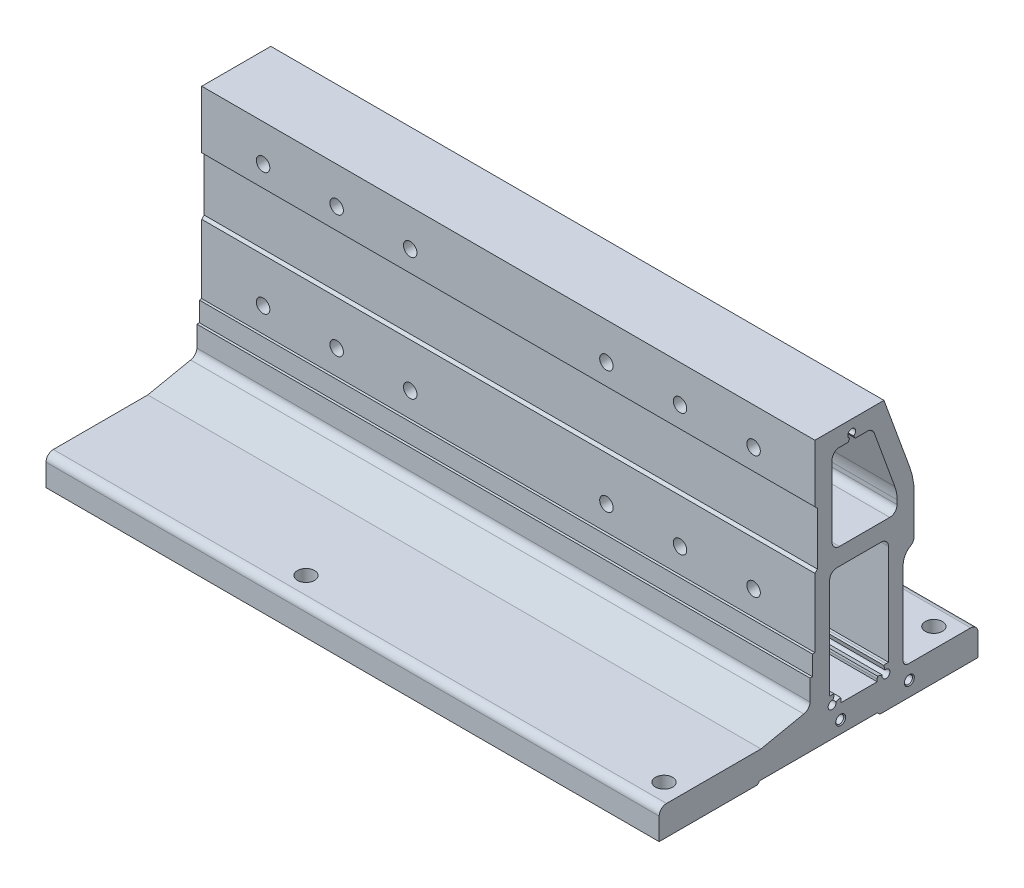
ISO-10303-21;
HEADER;
FILE_DESCRIPTION(('STEP AP214'),'2;1');
FILE_NAME('part.step','',(''),(''),'','','');
FILE_SCHEMA(('AUTOMOTIVE_DESIGN { 1 0 10303 214 1 1 1 1 }'));
ENDSEC;
DATA;
#1=APPLICATION_CONTEXT('core data for automotive mechanical design processes');
#2=APPLICATION_PROTOCOL_DEFINITION('international standard','automotive_design',2000,#1);
#3=PRODUCT_CONTEXT('',#1,'mechanical');
#4=PRODUCT('Part','Part','',(#3));
#5=PRODUCT_RELATED_PRODUCT_CATEGORY('part','',(#4));
#6=PRODUCT_DEFINITION_FORMATION('','',#4);
#7=PRODUCT_DEFINITION_CONTEXT('part definition',#1,'design');
#8=PRODUCT_DEFINITION('design','',#6,#7);
#9=PRODUCT_DEFINITION_SHAPE('','',#8);
#10=(LENGTH_UNIT() NAMED_UNIT(*) SI_UNIT(.MILLI.,.METRE.));
#11=(NAMED_UNIT(*) PLANE_ANGLE_UNIT() SI_UNIT($,.RADIAN.));
#12=(NAMED_UNIT(*) SI_UNIT($,.STERADIAN.) SOLID_ANGLE_UNIT());
#13=UNCERTAINTY_MEASURE_WITH_UNIT(LENGTH_MEASURE(1.E-05),#10,'distance_accuracy_value','');
#14=(GEOMETRIC_REPRESENTATION_CONTEXT(3) GLOBAL_UNCERTAINTY_ASSIGNED_CONTEXT((#13)) GLOBAL_UNIT_ASSIGNED_CONTEXT((#10,
#11,#12)) REPRESENTATION_CONTEXT('',''));
#15=CARTESIAN_POINT('',(0.,0.,0.));
#16=DIRECTION('',(0.,0.,1.));
#17=DIRECTION('',(1.,0.,0.));
#18=AXIS2_PLACEMENT_3D('',#15,#16,#17);
#19=CARTESIAN_POINT('',(125.,17.5660963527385,6.50000000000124));
#20=DIRECTION('',(1.,0.,0.));
#21=DIRECTION('',(0.,0.,-1.));
#22=AXIS2_PLACEMENT_3D('',#19,#20,#21);
#23=PLANE('',#22);
#24=CARTESIAN_POINT('',(125.,5.,-36.9999999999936));
#25=DIRECTION('',(1.,0.,0.));
#26=DIRECTION('',(0.,0.,-1.));
#27=AXIS2_PLACEMENT_3D('',#24,#25,#26);
#28=CIRCLE('',#27,2.025);
#29=CARTESIAN_POINT('',(125.,5.,-39.0249999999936));
#30=VERTEX_POINT('',#29);
#31=EDGE_CURVE('E544',#30,#30,#28,.T.);
#32=ORIENTED_EDGE('',*,*,#31,.F.);
#33=EDGE_LOOP('',(#32));
#34=FACE_BOUND('',#33,.T.);
#35=CARTESIAN_POINT('',(125.,5.,-8.99999999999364));
#36=DIRECTION('',(1.,0.,0.));
#37=DIRECTION('',(0.,0.,-1.));
#38=AXIS2_PLACEMENT_3D('',#35,#36,#37);
#39=CIRCLE('',#38,2.025);
#40=CARTESIAN_POINT('',(125.,5.,-11.0249999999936));
#41=VERTEX_POINT('',#40);
#42=EDGE_CURVE('E553',#41,#41,#39,.T.);
#43=ORIENTED_EDGE('',*,*,#42,.F.);
#44=EDGE_LOOP('',(#43));
#45=FACE_BOUND('',#44,.T.);
#46=DIRECTION('',(0.,0.939692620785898,0.342020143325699));
#47=VECTOR('',#46,1.);
#48=CARTESIAN_POINT('',(125.,80.0819016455,-37.19077862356));
#49=LINE('',#48,#47);
#50=CARTESIAN_POINT('',(125.,80.0819016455,-37.19077862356));
#51=VERTEX_POINT('',#50);
#52=CARTESIAN_POINT('',(125.,108.999999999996,-26.6654515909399));
#53=VERTEX_POINT('',#52);
#54=EDGE_CURVE('E852',#51,#53,#49,.T.);
#55=ORIENTED_EDGE('',*,*,#54,.T.);
#56=DIRECTION('',(0.,0.,1.));
#57=VECTOR('',#56,1.);
#58=CARTESIAN_POINT('',(125.,108.999999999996,-26.6654515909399));
#59=LINE('',#58,#57);
#60=CARTESIAN_POINT('',(125.,108.999999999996,1.50000000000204));
#61=VERTEX_POINT('',#60);
#62=EDGE_CURVE('E1243',#53,#61,#59,.T.);
#63=ORIENTED_EDGE('',*,*,#62,.T.);
#64=DIRECTION('',(0.,-1.,0.));
#65=VECTOR('',#64,1.);
#66=CARTESIAN_POINT('',(125.,108.999999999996,1.50000000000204));
#67=LINE('',#66,#65);
#68=CARTESIAN_POINT('',(125.,85.4999999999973,1.50000000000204));
#69=VERTEX_POINT('',#68);
#70=EDGE_CURVE('E1245',#61,#69,#67,.T.);
#71=ORIENTED_EDGE('',*,*,#70,.T.);
#72=DIRECTION('',(0.,-0.707106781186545,-0.70710678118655));
#73=VECTOR('',#72,1.);
#74=CARTESIAN_POINT('',(125.,85.4999999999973,1.50000000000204));
#75=LINE('',#74,#73);
#76=CARTESIAN_POINT('',(125.,84.4999999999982,0.500000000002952));
#77=VERTEX_POINT('',#76);
#78=EDGE_CURVE('E1247',#69,#77,#75,.T.);
#79=ORIENTED_EDGE('',*,*,#78,.T.);
#80=DIRECTION('',(0.,-1.,0.));
#81=VECTOR('',#80,1.);
#82=CARTESIAN_POINT('',(125.,84.4999999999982,0.500000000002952));
#83=LINE('',#82,#81);
#84=CARTESIAN_POINT('',(125.,62.9999999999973,0.500000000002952));
#85=VERTEX_POINT('',#84);
#86=EDGE_CURVE('E1249',#77,#85,#83,.T.);
#87=ORIENTED_EDGE('',*,*,#86,.T.);
#88=DIRECTION('',(0.,-0.707106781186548,0.707106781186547));
#89=VECTOR('',#88,1.);
#90=CARTESIAN_POINT('',(125.,62.9999999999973,0.500000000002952));
#91=LINE('',#90,#89);
#92=CARTESIAN_POINT('',(125.,61.9999999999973,1.50000000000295));
#93=VERTEX_POINT('',#92);
#94=EDGE_CURVE('E1251',#85,#93,#91,.T.);
#95=ORIENTED_EDGE('',*,*,#94,.T.);
#96=DIRECTION('',(0.,-1.,0.));
#97=VECTOR('',#96,1.);
#98=CARTESIAN_POINT('',(125.,61.9999999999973,1.50000000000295));
#99=LINE('',#98,#97);
#100=CARTESIAN_POINT('',(125.,33.9999999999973,1.50000000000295));
#101=VERTEX_POINT('',#100);
#102=EDGE_CURVE('E1253',#93,#101,#99,.T.);
#103=ORIENTED_EDGE('',*,*,#102,.T.);
#104=DIRECTION('',(0.,0.,1.));
#105=VECTOR('',#104,1.);
#106=CARTESIAN_POINT('',(125.,33.9999999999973,1.50000000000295));
#107=LINE('',#106,#105);
#108=CARTESIAN_POINT('',(125.,33.9999999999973,2.50000000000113));
#109=VERTEX_POINT('',#108);
#110=EDGE_CURVE('E1255',#101,#109,#107,.T.);
#111=ORIENTED_EDGE('',*,*,#110,.T.);
#112=DIRECTION('',(0.,-1.,0.));
#113=VECTOR('',#112,1.);
#114=CARTESIAN_POINT('',(125.,33.9999999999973,2.50000000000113));
#115=LINE('',#114,#113);
#116=CARTESIAN_POINT('',(125.,25.9999999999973,2.50000000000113));
#117=VERTEX_POINT('',#116);
#118=EDGE_CURVE('E1257',#109,#117,#115,.T.);
#119=ORIENTED_EDGE('',*,*,#118,.T.);
#120=DIRECTION('',(0.,0.,1.));
#121=VECTOR('',#120,1.);
#122=CARTESIAN_POINT('',(125.,25.9999999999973,2.50000000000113));
#123=LINE('',#122,#121);
#124=CARTESIAN_POINT('',(125.,25.9999999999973,3.50000000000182));
#125=VERTEX_POINT('',#124);
#126=EDGE_CURVE('E1259',#117,#125,#123,.T.);
#127=ORIENTED_EDGE('',*,*,#126,.T.);
#128=DIRECTION('',(0.,-1.,0.));
#129=VECTOR('',#128,1.);
#130=CARTESIAN_POINT('',(125.,25.9999999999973,3.50000000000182));
#131=LINE('',#130,#129);
#132=CARTESIAN_POINT('',(125.,17.566096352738,3.50000000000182));
#133=VERTEX_POINT('',#132);
#134=EDGE_CURVE('E1261',#125,#133,#131,.T.);
#135=ORIENTED_EDGE('',*,*,#134,.T.);
#136=CARTESIAN_POINT('',(125.,17.5660963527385,6.50000000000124));
#137=DIRECTION('',(-1.,0.,0.));
#138=DIRECTION('',(0.,0.,-1.));
#139=AXIS2_PLACEMENT_3D('',#136,#137,#138);
#140=CIRCLE('',#139,2.99999999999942);
#141=CARTESIAN_POINT('',(125.,14.6023377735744,6.03509669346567));
#142=VERTEX_POINT('',#141);
#143=EDGE_CURVE('E1263',#133,#142,#140,.T.);
#144=ORIENTED_EDGE('',*,*,#143,.T.);
#145=DIRECTION('',(0.,-0.202009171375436,0.979383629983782));
#146=VECTOR('',#145,1.);
#147=CARTESIAN_POINT('',(125.,14.6023377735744,6.03509669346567));
#148=LINE('',#147,#146);
#149=CARTESIAN_POINT('',(125.,11.,23.5000000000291));
#150=VERTEX_POINT('',#149);
#151=EDGE_CURVE('E1265',#142,#150,#148,.T.);
#152=ORIENTED_EDGE('',*,*,#151,.T.);
#153=DIRECTION('',(0.,0.,1.));
#154=VECTOR('',#153,1.);
#155=CARTESIAN_POINT('',(125.,11.,23.5000000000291));
#156=LINE('',#155,#154);
#157=CARTESIAN_POINT('',(125.,11.,62.0000000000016));
#158=VERTEX_POINT('',#157);
#159=EDGE_CURVE('E1267',#150,#158,#156,.T.);
#160=ORIENTED_EDGE('',*,*,#159,.T.);
#161=CARTESIAN_POINT('',(125.,7.99999999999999,62.0000000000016));
#162=DIRECTION('',(1.,0.,0.));
#163=DIRECTION('',(0.,0.,-1.));
#164=AXIS2_PLACEMENT_3D('',#161,#162,#163);
#165=CIRCLE('',#164,3.);
#166=CARTESIAN_POINT('',(125.,8.,65.0000000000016));
#167=VERTEX_POINT('',#166);
#168=EDGE_CURVE('E1269',#158,#167,#165,.T.);
#169=ORIENTED_EDGE('',*,*,#168,.T.);
#170=DIRECTION('',(0.,-1.,0.));
#171=VECTOR('',#170,1.);
#172=CARTESIAN_POINT('',(125.,8.,65.0000000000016));
#173=LINE('',#172,#171);
#174=CARTESIAN_POINT('',(125.,-1.,65.0000000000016));
#175=VERTEX_POINT('',#174);
#176=EDGE_CURVE('E1271',#167,#175,#173,.T.);
#177=ORIENTED_EDGE('',*,*,#176,.T.);
#178=DIRECTION('',(0.,0.,-1.));
#179=VECTOR('',#178,1.);
#180=CARTESIAN_POINT('',(125.,-1.,65.0000000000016));
#181=LINE('',#180,#179);
#182=CARTESIAN_POINT('',(125.,-1.,25.));
#183=VERTEX_POINT('',#182);
#184=EDGE_CURVE('E1273',#175,#183,#181,.T.);
#185=ORIENTED_EDGE('',*,*,#184,.T.);
#186=DIRECTION('',(0.,0.707106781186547,-0.707106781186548));
#187=VECTOR('',#186,1.);
#188=CARTESIAN_POINT('',(125.,-1.,25.));
#189=LINE('',#188,#187);
#190=CARTESIAN_POINT('',(125.,0.,24.));
#191=VERTEX_POINT('',#190);
#192=EDGE_CURVE('E1275',#183,#191,#189,.T.);
#193=ORIENTED_EDGE('',*,*,#192,.T.);
#194=DIRECTION('',(0.,0.,-1.));
#195=VECTOR('',#194,1.);
#196=CARTESIAN_POINT('',(125.,0.,24.));
#197=LINE('',#196,#195);
#198=CARTESIAN_POINT('',(125.,0.,-24.));
#199=VERTEX_POINT('',#198);
#200=EDGE_CURVE('E1277',#191,#199,#197,.T.);
#201=ORIENTED_EDGE('',*,*,#200,.T.);
#202=DIRECTION('',(0.,-0.707106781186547,-0.707106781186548));
#203=VECTOR('',#202,1.);
#204=CARTESIAN_POINT('',(125.,0.,-24.));
#205=LINE('',#204,#203);
#206=CARTESIAN_POINT('',(125.,-1.,-25.));
#207=VERTEX_POINT('',#206);
#208=EDGE_CURVE('E1279',#199,#207,#205,.T.);
#209=ORIENTED_EDGE('',*,*,#208,.T.);
#210=DIRECTION('',(0.,0.,-1.));
#211=VECTOR('',#210,1.);
#212=CARTESIAN_POINT('',(125.,-1.,-25.));
#213=LINE('',#212,#211);
#214=CARTESIAN_POINT('',(125.,-1.,-64.9999999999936));
#215=VERTEX_POINT('',#214);
#216=EDGE_CURVE('E1281',#207,#215,#213,.T.);
#217=ORIENTED_EDGE('',*,*,#216,.T.);
#218=DIRECTION('',(0.,1.,0.));
#219=VECTOR('',#218,1.);
#220=CARTESIAN_POINT('',(125.,-1.,-64.9999999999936));
#221=LINE('',#220,#219);
#222=CARTESIAN_POINT('',(125.,7.9999999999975,-64.9999999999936));
#223=VERTEX_POINT('',#222);
#224=EDGE_CURVE('E1283',#215,#223,#221,.T.);
#225=ORIENTED_EDGE('',*,*,#224,.T.);
#226=CARTESIAN_POINT('',(125.,7.9999999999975,-61.9999999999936));
#227=DIRECTION('',(1.,0.,0.));
#228=DIRECTION('',(0.,0.,-1.));
#229=AXIS2_PLACEMENT_3D('',#226,#227,#228);
#230=CIRCLE('',#229,3.);
#231=CARTESIAN_POINT('',(125.,10.9999999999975,-61.9999999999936));
#232=VERTEX_POINT('',#231);
#233=EDGE_CURVE('E1285',#223,#232,#230,.T.);
#234=ORIENTED_EDGE('',*,*,#233,.T.);
#235=DIRECTION('',(0.,0.,1.));
#236=VECTOR('',#235,1.);
#237=CARTESIAN_POINT('',(125.,10.9999999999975,-61.9999999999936));
#238=LINE('',#237,#236);
#239=CARTESIAN_POINT('',(125.,10.9999999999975,-36.4999999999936));
#240=VERTEX_POINT('',#239);
#241=EDGE_CURVE('E1287',#232,#240,#238,.T.);
#242=ORIENTED_EDGE('',*,*,#241,.T.);
#243=CARTESIAN_POINT('',(125.,12.9999999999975,-36.4999999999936));
#244=DIRECTION('',(-1.,0.,0.));
#245=DIRECTION('',(0.,0.,-1.));
#246=AXIS2_PLACEMENT_3D('',#243,#244,#245);
#247=CIRCLE('',#246,2.);
#248=CARTESIAN_POINT('',(125.,12.9999999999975,-34.4999999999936));
#249=VERTEX_POINT('',#248);
#250=EDGE_CURVE('E1289',#240,#249,#247,.T.);
#251=ORIENTED_EDGE('',*,*,#250,.T.);
#252=DIRECTION('',(0.,1.,0.));
#253=VECTOR('',#252,1.);
#254=CARTESIAN_POINT('',(125.,12.9999999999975,-34.4999999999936));
#255=LINE('',#254,#253);
#256=CARTESIAN_POINT('',(125.,46.9999999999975,-34.4999999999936));
#257=VERTEX_POINT('',#256);
#258=EDGE_CURVE('E1291',#249,#257,#255,.T.);
#259=ORIENTED_EDGE('',*,*,#258,.T.);
#260=CARTESIAN_POINT('',(125.,46.9999999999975,-40.4999999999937));
#261=DIRECTION('',(-1.,0.,0.));
#262=DIRECTION('',(0.,0.,-1.));
#263=AXIS2_PLACEMENT_3D('',#260,#261,#262);
#264=CIRCLE('',#263,6.00000000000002);
#265=CARTESIAN_POINT('',(125.,52.1961524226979,-37.4999999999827));
#266=VERTEX_POINT('',#265);
#267=EDGE_CURVE('E1293',#257,#266,#264,.T.);
#268=ORIENTED_EDGE('',*,*,#267,.T.);
#269=CARTESIAN_POINT('',(125.,54.7942286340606,-35.9999999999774));
#270=DIRECTION('',(1.,0.,0.));
#271=DIRECTION('',(0.,0.,-1.));
#272=AXIS2_PLACEMENT_3D('',#269,#270,#271);
#273=CIRCLE('',#272,3.00000000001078);
#274=CARTESIAN_POINT('',(125.,54.7942286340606,-38.9999999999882));
#275=VERTEX_POINT('',#274);
#276=EDGE_CURVE('E1295',#266,#275,#273,.T.);
#277=ORIENTED_EDGE('',*,*,#276,.T.);
#278=DIRECTION('',(0.,1.,0.));
#279=VECTOR('',#278,1.);
#280=CARTESIAN_POINT('',(125.,54.7942286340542,-38.9999999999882));
#281=LINE('',#280,#279);
#282=CARTESIAN_POINT('',(125.,69.821297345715,-38.9999999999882));
#283=VERTEX_POINT('',#282);
#284=EDGE_CURVE('E844',#275,#283,#281,.T.);
#285=ORIENTED_EDGE('',*,*,#284,.T.);
#286=CARTESIAN_POINT('',(125.,69.8212973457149,-8.99999999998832));
#287=DIRECTION('',(1.,0.,0.));
#288=DIRECTION('',(0.,0.,-1.));
#289=AXIS2_PLACEMENT_3D('',#286,#287,#288);
#290=CIRCLE('',#289,29.9999999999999);
#291=EDGE_CURVE('E859',#283,#51,#290,.T.);
#292=ORIENTED_EDGE('',*,*,#291,.T.);
#293=EDGE_LOOP('',(#55,#63,#71,#79,#87,#95,#103,#111,#119,#127,#135,#144,#152,#160,#169,#177,
#185,#193,#201,#209,#217,#225,#234,#242,#251,#259,#268,#277,#285,#292));
#294=FACE_BOUND('',#293,.T.);
#295=DIRECTION('',(0.,0.,1.));
#296=VECTOR('',#295,1.);
#297=CARTESIAN_POINT('',(125.,59.5,-25.4999999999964));
#298=LINE('',#297,#296);
#299=CARTESIAN_POINT('',(125.,59.5,-25.4999999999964));
#300=VERTEX_POINT('',#299);
#301=CARTESIAN_POINT('',(125.,59.5,-7.5));
#302=VERTEX_POINT('',#301);
#303=EDGE_CURVE('E1100',#300,#302,#298,.T.);
#304=ORIENTED_EDGE('',*,*,#303,.F.);
#305=CARTESIAN_POINT('',(125.,56.5,-25.4999999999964));
#306=DIRECTION('',(1.,0.,0.));
#307=DIRECTION('',(0.,0.,-1.));
#308=AXIS2_PLACEMENT_3D('',#305,#306,#307);
#309=CIRCLE('',#308,3.);
#310=CARTESIAN_POINT('',(125.,56.5,-28.4999999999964));
#311=VERTEX_POINT('',#310);
#312=EDGE_CURVE('E1098',#311,#300,#309,.T.);
#313=ORIENTED_EDGE('',*,*,#312,.F.);
#314=DIRECTION('',(0.,1.,0.));
#315=VECTOR('',#314,1.);
#316=CARTESIAN_POINT('',(125.,15.6000000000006,-28.4999999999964));
#317=LINE('',#316,#315);
#318=CARTESIAN_POINT('',(125.,15.6000000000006,-28.4999999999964));
#319=VERTEX_POINT('',#318);
#320=EDGE_CURVE('E1138',#319,#311,#317,.T.);
#321=ORIENTED_EDGE('',*,*,#320,.F.);
#322=DIRECTION('',(0.,0.,-1.));
#323=VECTOR('',#322,1.);
#324=CARTESIAN_POINT('',(125.,15.6000000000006,-27.499999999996));
#325=LINE('',#324,#323);
#326=CARTESIAN_POINT('',(125.,15.6000000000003,-27.499999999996));
#327=VERTEX_POINT('',#326);
#328=EDGE_CURVE('E1135',#327,#319,#325,.T.);
#329=ORIENTED_EDGE('',*,*,#328,.F.);
#330=CARTESIAN_POINT('',(125.,11.9999999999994,-27.4999999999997));
#331=DIRECTION('',(-1.,0.,0.));
#332=DIRECTION('',(0.,0.,-1.));
#333=AXIS2_PLACEMENT_3D('',#330,#331,#332);
#334=CIRCLE('',#333,3.60000000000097);
#335=CARTESIAN_POINT('',(125.,15.4773329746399,-26.5682514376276));
#336=VERTEX_POINT('',#335);
#337=EDGE_CURVE('E1133',#336,#327,#334,.T.);
#338=ORIENTED_EDGE('',*,*,#337,.F.);
#339=DIRECTION('',(0.,0.965925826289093,0.258819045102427));
#340=VECTOR('',#339,1.);
#341=CARTESIAN_POINT('',(125.,13.5454813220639,-27.0858895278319));
#342=LINE('',#341,#340);
#343=CARTESIAN_POINT('',(125.,13.5454813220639,-27.0858895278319));
#344=VERTEX_POINT('',#343);
#345=EDGE_CURVE('E1131',#344,#336,#342,.T.);
#346=ORIENTED_EDGE('',*,*,#345,.F.);
#347=CARTESIAN_POINT('',(125.,11.9999999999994,-27.4999999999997));
#348=DIRECTION('',(1.,0.,0.));
#349=DIRECTION('',(0.,0.,-1.));
#350=AXIS2_PLACEMENT_3D('',#347,#348,#349);
#351=CIRCLE('',#350,1.60000000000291);
#352=CARTESIAN_POINT('',(125.,12.4141104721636,-25.9545186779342));
#353=VERTEX_POINT('',#352);
#354=EDGE_CURVE('E1129',#353,#344,#351,.T.);
#355=ORIENTED_EDGE('',*,*,#354,.F.);
#356=DIRECTION('',(0.,-0.25881904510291,-0.965925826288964));
#357=VECTOR('',#356,1.);
#358=CARTESIAN_POINT('',(125.,12.9317485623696,-24.0226670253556));
#359=LINE('',#358,#357);
#360=CARTESIAN_POINT('',(125.,12.9317485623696,-24.0226670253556));
#361=VERTEX_POINT('',#360);
#362=EDGE_CURVE('E1127',#361,#353,#359,.T.);
#363=ORIENTED_EDGE('',*,*,#362,.F.);
#364=CARTESIAN_POINT('',(125.,11.9999999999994,-27.4999999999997));
#365=DIRECTION('',(-1.,0.,0.));
#366=DIRECTION('',(0.,0.,-1.));
#367=AXIS2_PLACEMENT_3D('',#364,#365,#366);
#368=CIRCLE('',#367,3.60000000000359);
#369=CARTESIAN_POINT('',(125.,11.9999999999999,-23.8999999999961));
#370=VERTEX_POINT('',#369);
#371=EDGE_CURVE('E1125',#370,#361,#368,.T.);
#372=ORIENTED_EDGE('',*,*,#371,.F.);
#373=DIRECTION('',(0.,1.,0.));
#374=VECTOR('',#373,1.);
#375=CARTESIAN_POINT('',(125.,11.0000000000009,-23.8999999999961));
#376=LINE('',#375,#374);
#377=CARTESIAN_POINT('',(125.,11.0000000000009,-23.8999999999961));
#378=VERTEX_POINT('',#377);
#379=EDGE_CURVE('E1123',#378,#370,#376,.T.);
#380=ORIENTED_EDGE('',*,*,#379,.F.);
#381=DIRECTION('',(0.,0.,-1.));
#382=VECTOR('',#381,1.);
#383=CARTESIAN_POINT('',(125.,11.0000000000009,-9.10000000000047));
#384=LINE('',#383,#382);
#385=CARTESIAN_POINT('',(125.,11.0000000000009,-9.10000000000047));
#386=VERTEX_POINT('',#385);
#387=EDGE_CURVE('E1121',#386,#378,#384,.T.);
#388=ORIENTED_EDGE('',*,*,#387,.F.);
#389=DIRECTION('',(0.,-1.,0.));
#390=VECTOR('',#389,1.);
#391=CARTESIAN_POINT('',(125.,11.9999999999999,-9.10000000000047));
#392=LINE('',#391,#390);
#393=CARTESIAN_POINT('',(125.,11.9999999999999,-9.10000000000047));
#394=VERTEX_POINT('',#393);
#395=EDGE_CURVE('E1119',#394,#386,#392,.T.);
#396=ORIENTED_EDGE('',*,*,#395,.F.);
#397=CARTESIAN_POINT('',(125.,12.0000000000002,-5.50000000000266));
#398=DIRECTION('',(-1.,0.,0.));
#399=DIRECTION('',(0.,0.,-1.));
#400=AXIS2_PLACEMENT_3D('',#397,#398,#399);
#401=CIRCLE('',#400,3.59999999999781);
#402=CARTESIAN_POINT('',(125.,12.9317485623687,-8.97733297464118));
#403=VERTEX_POINT('',#402);
#404=EDGE_CURVE('E1117',#403,#394,#401,.T.);
#405=ORIENTED_EDGE('',*,*,#404,.F.);
#406=DIRECTION('',(0.,0.258819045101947,-0.965925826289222));
#407=VECTOR('',#406,1.);
#408=CARTESIAN_POINT('',(125.,12.414110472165,-7.04548132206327));
#409=LINE('',#408,#407);
#410=CARTESIAN_POINT('',(125.,12.414110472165,-7.04548132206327));
#411=VERTEX_POINT('',#410);
#412=EDGE_CURVE('E1115',#411,#403,#409,.T.);
#413=ORIENTED_EDGE('',*,*,#412,.F.);
#414=CARTESIAN_POINT('',(125.,12.0000000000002,-5.50000000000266));
#415=DIRECTION('',(1.,0.,0.));
#416=DIRECTION('',(0.,0.,-1.));
#417=AXIS2_PLACEMENT_3D('',#414,#415,#416);
#418=CIRCLE('',#417,1.59999999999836);
#419=CARTESIAN_POINT('',(125.,13.5454813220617,-5.91411047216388));
#420=VERTEX_POINT('',#419);
#421=EDGE_CURVE('E1113',#420,#411,#418,.T.);
#422=ORIENTED_EDGE('',*,*,#421,.F.);
#423=DIRECTION('',(0.,-0.965925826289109,0.258819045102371));
#424=VECTOR('',#423,1.);
#425=CARTESIAN_POINT('',(125.,15.4773329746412,-6.43174856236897));
#426=LINE('',#425,#424);
#427=CARTESIAN_POINT('',(125.,15.4773329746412,-6.43174856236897));
#428=VERTEX_POINT('',#427);
#429=EDGE_CURVE('E1111',#428,#420,#426,.T.);
#430=ORIENTED_EDGE('',*,*,#429,.F.);
#431=CARTESIAN_POINT('',(125.,12.0000000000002,-5.50000000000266));
#432=DIRECTION('',(-1.,0.,0.));
#433=DIRECTION('',(0.,0.,-1.));
#434=AXIS2_PLACEMENT_3D('',#431,#432,#433);
#435=CIRCLE('',#434,3.59999999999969);
#436=CARTESIAN_POINT('',(125.,15.5999999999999,-5.50000000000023));
#437=VERTEX_POINT('',#436);
#438=EDGE_CURVE('E1109',#437,#428,#435,.T.);
#439=ORIENTED_EDGE('',*,*,#438,.F.);
#440=DIRECTION('',(0.,4.00721122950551E-13,-1.));
#441=VECTOR('',#440,1.);
#442=CARTESIAN_POINT('',(125.,15.5999999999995,-4.5));
#443=LINE('',#442,#441);
#444=CARTESIAN_POINT('',(125.,15.5999999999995,-4.5));
#445=VERTEX_POINT('',#444);
#446=EDGE_CURVE('E1107',#445,#437,#443,.T.);
#447=ORIENTED_EDGE('',*,*,#446,.F.);
#448=DIRECTION('',(0.,-1.,0.));
#449=VECTOR('',#448,1.);
#450=CARTESIAN_POINT('',(125.,56.5,-4.5));
#451=LINE('',#450,#449);
#452=CARTESIAN_POINT('',(125.,56.5,-4.5));
#453=VERTEX_POINT('',#452);
#454=EDGE_CURVE('E1105',#453,#445,#451,.T.);
#455=ORIENTED_EDGE('',*,*,#454,.F.);
#456=CARTESIAN_POINT('',(125.,56.5,-7.5));
#457=DIRECTION('',(1.,0.,0.));
#458=DIRECTION('',(0.,0.,-1.));
#459=AXIS2_PLACEMENT_3D('',#456,#457,#458);
#460=CIRCLE('',#459,3.);
#461=EDGE_CURVE('E1103',#302,#453,#460,.T.);
#462=ORIENTED_EDGE('',*,*,#461,.F.);
#463=EDGE_LOOP('',(#304,#313,#321,#329,#338,#346,#355,#363,#372,#380,#388,#396,#405,#413,#422,
#430,#439,#447,#455,#462));
#464=FACE_BOUND('',#463,.T.);
#465=DIRECTION('',(0.,-0.866025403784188,0.500000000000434));
#466=VECTOR('',#465,1.);
#467=CARTESIAN_POINT('',(125.,102.614356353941,-12.7000000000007));
#468=LINE('',#467,#466);
#469=CARTESIAN_POINT('',(125.,102.614356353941,-12.7000000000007));
#470=VERTEX_POINT('',#469);
#471=CARTESIAN_POINT('',(125.,101.499999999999,-12.0566260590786));
#472=VERTEX_POINT('',#471);
#473=EDGE_CURVE('E994',#470,#472,#468,.T.);
#474=ORIENTED_EDGE('',*,*,#473,.F.);
#475=CARTESIAN_POINT('',(125.,103.999996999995,-13.5000000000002));
#476=DIRECTION('',(1.,0.,0.));
#477=DIRECTION('',(0.,0.,-1.));
#478=AXIS2_PLACEMENT_3D('',#475,#476,#477);
#479=CIRCLE('',#478,1.59999999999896);
#480=CARTESIAN_POINT('',(125.,102.614356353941,-14.2999999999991));
#481=VERTEX_POINT('',#480);
#482=EDGE_CURVE('E992',#481,#470,#479,.T.);
#483=ORIENTED_EDGE('',*,*,#482,.F.);
#484=DIRECTION('',(0.,0.866025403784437,0.500000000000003));
#485=VECTOR('',#484,1.);
#486=CARTESIAN_POINT('',(125.,101.499999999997,-14.9433739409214));
#487=LINE('',#486,#485);
#488=CARTESIAN_POINT('',(125.,101.499999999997,-14.9433739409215));
#489=VERTEX_POINT('',#488);
#490=EDGE_CURVE('E1020',#489,#481,#487,.T.);
#491=ORIENTED_EDGE('',*,*,#490,.F.);
#492=DIRECTION('',(0.,0.,1.));
#493=VECTOR('',#492,1.);
#494=CARTESIAN_POINT('',(125.,101.499999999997,-19.8453613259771));
#495=LINE('',#494,#493);
#496=CARTESIAN_POINT('',(125.,101.499999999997,-19.8453613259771));
#497=VERTEX_POINT('',#496);
#498=EDGE_CURVE('E1017',#497,#489,#495,.T.);
#499=ORIENTED_EDGE('',*,*,#498,.F.);
#500=CARTESIAN_POINT('',(125.,98.4999999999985,-19.8453613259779));
#501=DIRECTION('',(1.,0.,0.));
#502=DIRECTION('',(0.,0.,-1.));
#503=AXIS2_PLACEMENT_3D('',#500,#501,#502);
#504=CIRCLE('',#503,2.99999999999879);
#505=CARTESIAN_POINT('',(125.,99.5260604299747,-22.6644391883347));
#506=VERTEX_POINT('',#505);
#507=EDGE_CURVE('E1015',#506,#497,#504,.T.);
#508=ORIENTED_EDGE('',*,*,#507,.F.);
#509=DIRECTION('',(0.,0.939692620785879,0.342020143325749));
#510=VECTOR('',#509,1.);
#511=CARTESIAN_POINT('',(125.,76.3622153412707,-31.0953893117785));
#512=LINE('',#511,#510);
#513=CARTESIAN_POINT('',(125.,76.3622153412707,-31.0953893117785));
#514=VERTEX_POINT('',#513);
#515=EDGE_CURVE('E1013',#514,#506,#512,.T.);
#516=ORIENTED_EDGE('',*,*,#515,.F.);
#517=CARTESIAN_POINT('',(125.,71.2319131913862,-17.0000000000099));
#518=DIRECTION('',(1.,0.,0.));
#519=DIRECTION('',(0.,0.,-1.));
#520=AXIS2_PLACEMENT_3D('',#517,#518,#519);
#521=CIRCLE('',#520,14.999999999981);
#522=CARTESIAN_POINT('',(125.,71.2319131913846,-31.9999999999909));
#523=VERTEX_POINT('',#522);
#524=EDGE_CURVE('E1011',#523,#514,#521,.T.);
#525=ORIENTED_EDGE('',*,*,#524,.F.);
#526=DIRECTION('',(0.,1.,0.));
#527=VECTOR('',#526,1.);
#528=CARTESIAN_POINT('',(125.,69.5,-31.9999999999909));
#529=LINE('',#528,#527);
#530=CARTESIAN_POINT('',(125.,69.5,-31.9999999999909));
#531=VERTEX_POINT('',#530);
#532=EDGE_CURVE('E1009',#531,#523,#529,.T.);
#533=ORIENTED_EDGE('',*,*,#532,.F.);
#534=CARTESIAN_POINT('',(125.,69.5,-28.9999999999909));
#535=DIRECTION('',(1.,0.,0.));
#536=DIRECTION('',(0.,0.,-1.));
#537=AXIS2_PLACEMENT_3D('',#534,#535,#536);
#538=CIRCLE('',#537,3.);
#539=CARTESIAN_POINT('',(125.,66.5,-28.9999999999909));
#540=VERTEX_POINT('',#539);
#541=EDGE_CURVE('E1007',#540,#531,#538,.T.);
#542=ORIENTED_EDGE('',*,*,#541,.F.);
#543=DIRECTION('',(0.,0.,-1.));
#544=VECTOR('',#543,1.);
#545=CARTESIAN_POINT('',(125.,66.5,-8.5));
#546=LINE('',#545,#544);
#547=CARTESIAN_POINT('',(125.,66.5,-8.5));
#548=VERTEX_POINT('',#547);
#549=EDGE_CURVE('E1005',#548,#540,#546,.T.);
#550=ORIENTED_EDGE('',*,*,#549,.F.);
#551=CARTESIAN_POINT('',(125.,69.5,-8.5));
#552=DIRECTION('',(1.,0.,0.));
#553=DIRECTION('',(0.,0.,-1.));
#554=AXIS2_PLACEMENT_3D('',#551,#552,#553);
#555=CIRCLE('',#554,3.);
#556=CARTESIAN_POINT('',(125.,69.5,-5.5));
#557=VERTEX_POINT('',#556);
#558=EDGE_CURVE('E1003',#557,#548,#555,.T.);
#559=ORIENTED_EDGE('',*,*,#558,.F.);
#560=DIRECTION('',(0.,-1.,0.));
#561=VECTOR('',#560,1.);
#562=CARTESIAN_POINT('',(125.,98.5,-5.5));
#563=LINE('',#562,#561);
#564=CARTESIAN_POINT('',(125.,98.5,-5.5));
#565=VERTEX_POINT('',#564);
#566=EDGE_CURVE('E1001',#565,#557,#563,.T.);
#567=ORIENTED_EDGE('',*,*,#566,.F.);
#568=CARTESIAN_POINT('',(125.,98.5,-8.5));
#569=DIRECTION('',(1.,0.,0.));
#570=DIRECTION('',(0.,0.,-1.));
#571=AXIS2_PLACEMENT_3D('',#568,#569,#570);
#572=CIRCLE('',#571,3.);
#573=CARTESIAN_POINT('',(125.,101.5,-8.5));
#574=VERTEX_POINT('',#573);
#575=EDGE_CURVE('E999',#574,#565,#572,.T.);
#576=ORIENTED_EDGE('',*,*,#575,.F.);
#577=DIRECTION('',(0.,2.57528899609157E-13,1.));
#578=VECTOR('',#577,1.);
#579=CARTESIAN_POINT('',(125.,101.499999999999,-12.0566260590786));
#580=LINE('',#579,#578);
#581=EDGE_CURVE('E997',#472,#574,#580,.T.);
#582=ORIENTED_EDGE('',*,*,#581,.F.);
#583=EDGE_LOOP('',(#474,#483,#491,#499,#508,#516,#525,#533,#542,#550,#559,#567,#576,#582));
#584=FACE_BOUND('',#583,.T.);
#585=ADVANCED_FACE('F37',(#34,#45,#294,#464,#584),#23,.T.);
#586=CARTESIAN_POINT('',(-125.,17.5660963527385,6.50000000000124));
#587=DIRECTION('',(1.,0.,0.));
#588=DIRECTION('',(0.,0.,-1.));
#589=AXIS2_PLACEMENT_3D('',#586,#587,#588);
#590=PLANE('',#589);
#591=CARTESIAN_POINT('',(-125.,56.5,-25.4999999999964));
#592=DIRECTION('',(1.,0.,0.));
#593=DIRECTION('',(0.,0.,-1.));
#594=AXIS2_PLACEMENT_3D('',#591,#592,#593);
#595=CIRCLE('',#594,3.);
#596=CARTESIAN_POINT('',(-125.,56.5,-28.4999999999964));
#597=VERTEX_POINT('',#596);
#598=CARTESIAN_POINT('',(-125.,59.5,-25.4999999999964));
#599=VERTEX_POINT('',#598);
#600=EDGE_CURVE('E1097',#597,#599,#595,.T.);
#601=ORIENTED_EDGE('',*,*,#600,.T.);
#602=DIRECTION('',(0.,0.,1.));
#603=VECTOR('',#602,1.);
#604=CARTESIAN_POINT('',(-125.,59.5,-25.4999999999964));
#605=LINE('',#604,#603);
#606=CARTESIAN_POINT('',(-125.,59.5,-7.5));
#607=VERTEX_POINT('',#606);
#608=EDGE_CURVE('E1143',#599,#607,#605,.T.);
#609=ORIENTED_EDGE('',*,*,#608,.T.);
#610=CARTESIAN_POINT('',(-125.,56.5,-7.5));
#611=DIRECTION('',(1.,0.,0.));
#612=DIRECTION('',(0.,0.,-1.));
#613=AXIS2_PLACEMENT_3D('',#610,#611,#612);
#614=CIRCLE('',#613,3.);
#615=CARTESIAN_POINT('',(-125.,56.5,-4.5));
#616=VERTEX_POINT('',#615);
#617=EDGE_CURVE('E1146',#607,#616,#614,.T.);
#618=ORIENTED_EDGE('',*,*,#617,.T.);
#619=DIRECTION('',(0.,-1.,0.));
#620=VECTOR('',#619,1.);
#621=CARTESIAN_POINT('',(-125.,56.5,-4.5));
#622=LINE('',#621,#620);
#623=CARTESIAN_POINT('',(-125.,15.5999999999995,-4.5));
#624=VERTEX_POINT('',#623);
#625=EDGE_CURVE('E1149',#616,#624,#622,.T.);
#626=ORIENTED_EDGE('',*,*,#625,.T.);
#627=DIRECTION('',(0.,4.00721122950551E-13,-1.));
#628=VECTOR('',#627,1.);
#629=CARTESIAN_POINT('',(-125.,15.5999999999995,-4.5));
#630=LINE('',#629,#628);
#631=CARTESIAN_POINT('',(-125.,15.5999999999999,-5.50000000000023));
#632=VERTEX_POINT('',#631);
#633=EDGE_CURVE('E1152',#624,#632,#630,.T.);
#634=ORIENTED_EDGE('',*,*,#633,.T.);
#635=CARTESIAN_POINT('',(-125.,12.0000000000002,-5.50000000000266));
#636=DIRECTION('',(-1.,0.,0.));
#637=DIRECTION('',(0.,0.,-1.));
#638=AXIS2_PLACEMENT_3D('',#635,#636,#637);
#639=CIRCLE('',#638,3.59999999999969);
#640=CARTESIAN_POINT('',(-125.,15.4773329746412,-6.43174856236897));
#641=VERTEX_POINT('',#640);
#642=EDGE_CURVE('E1155',#632,#641,#639,.T.);
#643=ORIENTED_EDGE('',*,*,#642,.T.);
#644=DIRECTION('',(0.,-0.965925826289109,0.258819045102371));
#645=VECTOR('',#644,1.);
#646=CARTESIAN_POINT('',(-125.,15.4773329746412,-6.43174856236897));
#647=LINE('',#646,#645);
#648=CARTESIAN_POINT('',(-125.,13.5454813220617,-5.91411047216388));
#649=VERTEX_POINT('',#648);
#650=EDGE_CURVE('E1158',#641,#649,#647,.T.);
#651=ORIENTED_EDGE('',*,*,#650,.T.);
#652=CARTESIAN_POINT('',(-125.,12.0000000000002,-5.50000000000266));
#653=DIRECTION('',(1.,0.,0.));
#654=DIRECTION('',(0.,0.,-1.));
#655=AXIS2_PLACEMENT_3D('',#652,#653,#654);
#656=CIRCLE('',#655,1.59999999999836);
#657=CARTESIAN_POINT('',(-125.,12.414110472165,-7.04548132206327));
#658=VERTEX_POINT('',#657);
#659=EDGE_CURVE('E1161',#649,#658,#656,.T.);
#660=ORIENTED_EDGE('',*,*,#659,.T.);
#661=DIRECTION('',(0.,0.258819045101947,-0.965925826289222));
#662=VECTOR('',#661,1.);
#663=CARTESIAN_POINT('',(-125.,12.414110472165,-7.04548132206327));
#664=LINE('',#663,#662);
#665=CARTESIAN_POINT('',(-125.,12.9317485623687,-8.97733297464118));
#666=VERTEX_POINT('',#665);
#667=EDGE_CURVE('E1164',#658,#666,#664,.T.);
#668=ORIENTED_EDGE('',*,*,#667,.T.);
#669=CARTESIAN_POINT('',(-125.,12.0000000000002,-5.50000000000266));
#670=DIRECTION('',(-1.,0.,0.));
#671=DIRECTION('',(0.,0.,-1.));
#672=AXIS2_PLACEMENT_3D('',#669,#670,#671);
#673=CIRCLE('',#672,3.59999999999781);
#674=CARTESIAN_POINT('',(-125.,11.9999999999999,-9.10000000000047));
#675=VERTEX_POINT('',#674);
#676=EDGE_CURVE('E1167',#666,#675,#673,.T.);
#677=ORIENTED_EDGE('',*,*,#676,.T.);
#678=DIRECTION('',(0.,-1.,0.));
#679=VECTOR('',#678,1.);
#680=CARTESIAN_POINT('',(-125.,11.9999999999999,-9.10000000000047));
#681=LINE('',#680,#679);
#682=CARTESIAN_POINT('',(-125.,11.0000000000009,-9.10000000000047));
#683=VERTEX_POINT('',#682);
#684=EDGE_CURVE('E1170',#675,#683,#681,.T.);
#685=ORIENTED_EDGE('',*,*,#684,.T.);
#686=DIRECTION('',(0.,0.,-1.));
#687=VECTOR('',#686,1.);
#688=CARTESIAN_POINT('',(-125.,11.0000000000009,-9.10000000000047));
#689=LINE('',#688,#687);
#690=CARTESIAN_POINT('',(-125.,11.0000000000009,-23.8999999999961));
#691=VERTEX_POINT('',#690);
#692=EDGE_CURVE('E1173',#683,#691,#689,.T.);
#693=ORIENTED_EDGE('',*,*,#692,.T.);
#694=DIRECTION('',(0.,1.,0.));
#695=VECTOR('',#694,1.);
#696=CARTESIAN_POINT('',(-125.,11.0000000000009,-23.8999999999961));
#697=LINE('',#696,#695);
#698=CARTESIAN_POINT('',(-125.,11.9999999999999,-23.8999999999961));
#699=VERTEX_POINT('',#698);
#700=EDGE_CURVE('E1176',#691,#699,#697,.T.);
#701=ORIENTED_EDGE('',*,*,#700,.T.);
#702=CARTESIAN_POINT('',(-125.,11.9999999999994,-27.4999999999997));
#703=DIRECTION('',(-1.,0.,0.));
#704=DIRECTION('',(0.,0.,-1.));
#705=AXIS2_PLACEMENT_3D('',#702,#703,#704);
#706=CIRCLE('',#705,3.60000000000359);
#707=CARTESIAN_POINT('',(-125.,12.9317485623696,-24.0226670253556));
#708=VERTEX_POINT('',#707);
#709=EDGE_CURVE('E1179',#699,#708,#706,.T.);
#710=ORIENTED_EDGE('',*,*,#709,.T.);
#711=DIRECTION('',(0.,-0.25881904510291,-0.965925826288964));
#712=VECTOR('',#711,1.);
#713=CARTESIAN_POINT('',(-125.,12.9317485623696,-24.0226670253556));
#714=LINE('',#713,#712);
#715=CARTESIAN_POINT('',(-125.,12.4141104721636,-25.9545186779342));
#716=VERTEX_POINT('',#715);
#717=EDGE_CURVE('E1182',#708,#716,#714,.T.);
#718=ORIENTED_EDGE('',*,*,#717,.T.);
#719=CARTESIAN_POINT('',(-125.,11.9999999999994,-27.4999999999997));
#720=DIRECTION('',(1.,0.,0.));
#721=DIRECTION('',(0.,0.,-1.));
#722=AXIS2_PLACEMENT_3D('',#719,#720,#721);
#723=CIRCLE('',#722,1.60000000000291);
#724=CARTESIAN_POINT('',(-125.,13.5454813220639,-27.0858895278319));
#725=VERTEX_POINT('',#724);
#726=EDGE_CURVE('E1185',#716,#725,#723,.T.);
#727=ORIENTED_EDGE('',*,*,#726,.T.);
#728=DIRECTION('',(0.,0.965925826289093,0.258819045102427));
#729=VECTOR('',#728,1.);
#730=CARTESIAN_POINT('',(-125.,13.5454813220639,-27.0858895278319));
#731=LINE('',#730,#729);
#732=CARTESIAN_POINT('',(-125.,15.4773329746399,-26.5682514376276));
#733=VERTEX_POINT('',#732);
#734=EDGE_CURVE('E1188',#725,#733,#731,.T.);
#735=ORIENTED_EDGE('',*,*,#734,.T.);
#736=CARTESIAN_POINT('',(-125.,11.9999999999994,-27.4999999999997));
#737=DIRECTION('',(-1.,0.,0.));
#738=DIRECTION('',(0.,0.,-1.));
#739=AXIS2_PLACEMENT_3D('',#736,#737,#738);
#740=CIRCLE('',#739,3.60000000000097);
#741=CARTESIAN_POINT('',(-125.,15.6000000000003,-27.499999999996));
#742=VERTEX_POINT('',#741);
#743=EDGE_CURVE('E1191',#733,#742,#740,.T.);
#744=ORIENTED_EDGE('',*,*,#743,.T.);
#745=DIRECTION('',(0.,0.,-1.));
#746=VECTOR('',#745,1.);
#747=CARTESIAN_POINT('',(-125.,15.6000000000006,-27.499999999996));
#748=LINE('',#747,#746);
#749=CARTESIAN_POINT('',(-125.,15.6000000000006,-28.4999999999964));
#750=VERTEX_POINT('',#749);
#751=EDGE_CURVE('E1194',#742,#750,#748,.T.);
#752=ORIENTED_EDGE('',*,*,#751,.T.);
#753=DIRECTION('',(0.,1.,0.));
#754=VECTOR('',#753,1.);
#755=CARTESIAN_POINT('',(-125.,15.6000000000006,-28.4999999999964));
#756=LINE('',#755,#754);
#757=EDGE_CURVE('E1101',#750,#597,#756,.T.);
#758=ORIENTED_EDGE('',*,*,#757,.T.);
#759=EDGE_LOOP('',(#601,#609,#618,#626,#634,#643,#651,#660,#668,#677,#685,#693,#701,#710,#718,
#727,#735,#744,#752,#758));
#760=FACE_BOUND('',#759,.T.);
#761=DIRECTION('',(0.,0.939692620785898,0.342020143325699));
#762=VECTOR('',#761,1.);
#763=CARTESIAN_POINT('',(-125.,80.0819016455,-37.19077862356));
#764=LINE('',#763,#762);
#765=CARTESIAN_POINT('',(-125.,80.0819016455,-37.19077862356));
#766=VERTEX_POINT('',#765);
#767=CARTESIAN_POINT('',(-125.,108.999999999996,-26.6654515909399));
#768=VERTEX_POINT('',#767);
#769=EDGE_CURVE('E1240',#766,#768,#764,.T.);
#770=ORIENTED_EDGE('',*,*,#769,.F.);
#771=CARTESIAN_POINT('',(-125.,69.8212973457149,-8.99999999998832));
#772=DIRECTION('',(1.,0.,0.));
#773=DIRECTION('',(0.,0.,-1.));
#774=AXIS2_PLACEMENT_3D('',#771,#772,#773);
#775=CIRCLE('',#774,29.9999999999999);
#776=CARTESIAN_POINT('',(-125.,69.821297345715,-38.9999999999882));
#777=VERTEX_POINT('',#776);
#778=EDGE_CURVE('E850',#777,#766,#775,.T.);
#779=ORIENTED_EDGE('',*,*,#778,.F.);
#780=DIRECTION('',(0.,1.,0.));
#781=VECTOR('',#780,1.);
#782=CARTESIAN_POINT('',(-125.,54.7942286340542,-38.9999999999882));
#783=LINE('',#782,#781);
#784=CARTESIAN_POINT('',(-125.,54.7942286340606,-38.9999999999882));
#785=VERTEX_POINT('',#784);
#786=EDGE_CURVE('E839',#785,#777,#783,.T.);
#787=ORIENTED_EDGE('',*,*,#786,.F.);
#788=CARTESIAN_POINT('',(-125.,54.7942286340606,-35.9999999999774));
#789=DIRECTION('',(1.,0.,0.));
#790=DIRECTION('',(0.,0.,-1.));
#791=AXIS2_PLACEMENT_3D('',#788,#789,#790);
#792=CIRCLE('',#791,3.00000000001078);
#793=CARTESIAN_POINT('',(-125.,52.1961524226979,-37.4999999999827));
#794=VERTEX_POINT('',#793);
#795=EDGE_CURVE('E829',#794,#785,#792,.T.);
#796=ORIENTED_EDGE('',*,*,#795,.F.);
#797=CARTESIAN_POINT('',(-125.,46.9999999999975,-40.4999999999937));
#798=DIRECTION('',(-1.,0.,0.));
#799=DIRECTION('',(0.,0.,-1.));
#800=AXIS2_PLACEMENT_3D('',#797,#798,#799);
#801=CIRCLE('',#800,6.00000000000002);
#802=CARTESIAN_POINT('',(-125.,46.9999999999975,-34.4999999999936));
#803=VERTEX_POINT('',#802);
#804=EDGE_CURVE('E840',#803,#794,#801,.T.);
#805=ORIENTED_EDGE('',*,*,#804,.F.);
#806=DIRECTION('',(0.,1.,0.));
#807=VECTOR('',#806,1.);
#808=CARTESIAN_POINT('',(-125.,12.9999999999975,-34.4999999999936));
#809=LINE('',#808,#807);
#810=CARTESIAN_POINT('',(-125.,12.9999999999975,-34.4999999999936));
#811=VERTEX_POINT('',#810);
#812=EDGE_CURVE('E1348',#811,#803,#809,.T.);
#813=ORIENTED_EDGE('',*,*,#812,.F.);
#814=CARTESIAN_POINT('',(-125.,12.9999999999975,-36.4999999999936));
#815=DIRECTION('',(-1.,0.,0.));
#816=DIRECTION('',(0.,0.,-1.));
#817=AXIS2_PLACEMENT_3D('',#814,#815,#816);
#818=CIRCLE('',#817,2.);
#819=CARTESIAN_POINT('',(-125.,10.9999999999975,-36.4999999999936));
#820=VERTEX_POINT('',#819);
#821=EDGE_CURVE('E1346',#820,#811,#818,.T.);
#822=ORIENTED_EDGE('',*,*,#821,.F.);
#823=DIRECTION('',(0.,0.,1.));
#824=VECTOR('',#823,1.);
#825=CARTESIAN_POINT('',(-125.,10.9999999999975,-61.9999999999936));
#826=LINE('',#825,#824);
#827=CARTESIAN_POINT('',(-125.,10.9999999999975,-61.9999999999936));
#828=VERTEX_POINT('',#827);
#829=EDGE_CURVE('E1344',#828,#820,#826,.T.);
#830=ORIENTED_EDGE('',*,*,#829,.F.);
#831=CARTESIAN_POINT('',(-125.,7.9999999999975,-61.9999999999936));
#832=DIRECTION('',(1.,0.,0.));
#833=DIRECTION('',(0.,0.,-1.));
#834=AXIS2_PLACEMENT_3D('',#831,#832,#833);
#835=CIRCLE('',#834,3.);
#836=CARTESIAN_POINT('',(-125.,7.9999999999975,-64.9999999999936));
#837=VERTEX_POINT('',#836);
#838=EDGE_CURVE('E1342',#837,#828,#835,.T.);
#839=ORIENTED_EDGE('',*,*,#838,.F.);
#840=DIRECTION('',(0.,1.,0.));
#841=VECTOR('',#840,1.);
#842=CARTESIAN_POINT('',(-125.,-1.,-64.9999999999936));
#843=LINE('',#842,#841);
#844=CARTESIAN_POINT('',(-125.,-1.,-64.9999999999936));
#845=VERTEX_POINT('',#844);
#846=EDGE_CURVE('E1340',#845,#837,#843,.T.);
#847=ORIENTED_EDGE('',*,*,#846,.F.);
#848=DIRECTION('',(0.,0.,-1.));
#849=VECTOR('',#848,1.);
#850=CARTESIAN_POINT('',(-125.,-1.,-25.));
#851=LINE('',#850,#849);
#852=CARTESIAN_POINT('',(-125.,-1.,-25.));
#853=VERTEX_POINT('',#852);
#854=EDGE_CURVE('E1338',#853,#845,#851,.T.);
#855=ORIENTED_EDGE('',*,*,#854,.F.);
#856=DIRECTION('',(0.,-0.707106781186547,-0.707106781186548));
#857=VECTOR('',#856,1.);
#858=CARTESIAN_POINT('',(-125.,0.,-24.));
#859=LINE('',#858,#857);
#860=CARTESIAN_POINT('',(-125.,0.,-24.));
#861=VERTEX_POINT('',#860);
#862=EDGE_CURVE('E1336',#861,#853,#859,.T.);
#863=ORIENTED_EDGE('',*,*,#862,.F.);
#864=DIRECTION('',(0.,0.,-1.));
#865=VECTOR('',#864,1.);
#866=CARTESIAN_POINT('',(-125.,0.,24.));
#867=LINE('',#866,#865);
#868=CARTESIAN_POINT('',(-125.,0.,24.));
#869=VERTEX_POINT('',#868);
#870=EDGE_CURVE('E1334',#869,#861,#867,.T.);
#871=ORIENTED_EDGE('',*,*,#870,.F.);
#872=DIRECTION('',(0.,0.707106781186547,-0.707106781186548));
#873=VECTOR('',#872,1.);
#874=CARTESIAN_POINT('',(-125.,-1.,25.));
#875=LINE('',#874,#873);
#876=CARTESIAN_POINT('',(-125.,-1.,25.));
#877=VERTEX_POINT('',#876);
#878=EDGE_CURVE('E1332',#877,#869,#875,.T.);
#879=ORIENTED_EDGE('',*,*,#878,.F.);
#880=DIRECTION('',(0.,0.,-1.));
#881=VECTOR('',#880,1.);
#882=CARTESIAN_POINT('',(-125.,-1.,65.0000000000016));
#883=LINE('',#882,#881);
#884=CARTESIAN_POINT('',(-125.,-1.,65.0000000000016));
#885=VERTEX_POINT('',#884);
#886=EDGE_CURVE('E1330',#885,#877,#883,.T.);
#887=ORIENTED_EDGE('',*,*,#886,.F.);
#888=DIRECTION('',(0.,-1.,0.));
#889=VECTOR('',#888,1.);
#890=CARTESIAN_POINT('',(-125.,8.,65.0000000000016));
#891=LINE('',#890,#889);
#892=CARTESIAN_POINT('',(-125.,8.,65.0000000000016));
#893=VERTEX_POINT('',#892);
#894=EDGE_CURVE('E1328',#893,#885,#891,.T.);
#895=ORIENTED_EDGE('',*,*,#894,.F.);
#896=CARTESIAN_POINT('',(-125.,7.99999999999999,62.0000000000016));
#897=DIRECTION('',(1.,0.,0.));
#898=DIRECTION('',(0.,0.,-1.));
#899=AXIS2_PLACEMENT_3D('',#896,#897,#898);
#900=CIRCLE('',#899,3.);
#901=CARTESIAN_POINT('',(-125.,11.,62.0000000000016));
#902=VERTEX_POINT('',#901);
#903=EDGE_CURVE('E1326',#902,#893,#900,.T.);
#904=ORIENTED_EDGE('',*,*,#903,.F.);
#905=DIRECTION('',(0.,0.,1.));
#906=VECTOR('',#905,1.);
#907=CARTESIAN_POINT('',(-125.,11.,23.5000000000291));
#908=LINE('',#907,#906);
#909=CARTESIAN_POINT('',(-125.,11.,23.5000000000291));
#910=VERTEX_POINT('',#909);
#911=EDGE_CURVE('E1324',#910,#902,#908,.T.);
#912=ORIENTED_EDGE('',*,*,#911,.F.);
#913=DIRECTION('',(0.,-0.202009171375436,0.979383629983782));
#914=VECTOR('',#913,1.);
#915=CARTESIAN_POINT('',(-125.,14.6023377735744,6.03509669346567));
#916=LINE('',#915,#914);
#917=CARTESIAN_POINT('',(-125.,14.6023377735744,6.03509669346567));
#918=VERTEX_POINT('',#917);
#919=EDGE_CURVE('E1322',#918,#910,#916,.T.);
#920=ORIENTED_EDGE('',*,*,#919,.F.);
#921=CARTESIAN_POINT('',(-125.,17.5660963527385,6.50000000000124));
#922=DIRECTION('',(-1.,0.,0.));
#923=DIRECTION('',(0.,0.,-1.));
#924=AXIS2_PLACEMENT_3D('',#921,#922,#923);
#925=CIRCLE('',#924,2.99999999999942);
#926=CARTESIAN_POINT('',(-125.,17.566096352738,3.50000000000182));
#927=VERTEX_POINT('',#926);
#928=EDGE_CURVE('E1320',#927,#918,#925,.T.);
#929=ORIENTED_EDGE('',*,*,#928,.F.);
#930=DIRECTION('',(0.,-1.,0.));
#931=VECTOR('',#930,1.);
#932=CARTESIAN_POINT('',(-125.,25.9999999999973,3.50000000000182));
#933=LINE('',#932,#931);
#934=CARTESIAN_POINT('',(-125.,25.9999999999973,3.50000000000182));
#935=VERTEX_POINT('',#934);
#936=EDGE_CURVE('E1318',#935,#927,#933,.T.);
#937=ORIENTED_EDGE('',*,*,#936,.F.);
#938=DIRECTION('',(0.,0.,1.));
#939=VECTOR('',#938,1.);
#940=CARTESIAN_POINT('',(-125.,25.9999999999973,2.50000000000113));
#941=LINE('',#940,#939);
#942=CARTESIAN_POINT('',(-125.,25.9999999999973,2.50000000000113));
#943=VERTEX_POINT('',#942);
#944=EDGE_CURVE('E1316',#943,#935,#941,.T.);
#945=ORIENTED_EDGE('',*,*,#944,.F.);
#946=DIRECTION('',(0.,-1.,0.));
#947=VECTOR('',#946,1.);
#948=CARTESIAN_POINT('',(-125.,33.9999999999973,2.50000000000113));
#949=LINE('',#948,#947);
#950=CARTESIAN_POINT('',(-125.,33.9999999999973,2.50000000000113));
#951=VERTEX_POINT('',#950);
#952=EDGE_CURVE('E1314',#951,#943,#949,.T.);
#953=ORIENTED_EDGE('',*,*,#952,.F.);
#954=DIRECTION('',(0.,0.,1.));
#955=VECTOR('',#954,1.);
#956=CARTESIAN_POINT('',(-125.,33.9999999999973,1.50000000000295));
#957=LINE('',#956,#955);
#958=CARTESIAN_POINT('',(-125.,33.9999999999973,1.50000000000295));
#959=VERTEX_POINT('',#958);
#960=EDGE_CURVE('E1312',#959,#951,#957,.T.);
#961=ORIENTED_EDGE('',*,*,#960,.F.);
#962=DIRECTION('',(0.,-1.,0.));
#963=VECTOR('',#962,1.);
#964=CARTESIAN_POINT('',(-125.,61.9999999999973,1.50000000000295));
#965=LINE('',#964,#963);
#966=CARTESIAN_POINT('',(-125.,61.9999999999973,1.50000000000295));
#967=VERTEX_POINT('',#966);
#968=EDGE_CURVE('E1310',#967,#959,#965,.T.);
#969=ORIENTED_EDGE('',*,*,#968,.F.);
#970=DIRECTION('',(0.,-0.707106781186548,0.707106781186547));
#971=VECTOR('',#970,1.);
#972=CARTESIAN_POINT('',(-125.,62.9999999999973,0.500000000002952));
#973=LINE('',#972,#971);
#974=CARTESIAN_POINT('',(-125.,62.9999999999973,0.500000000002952));
#975=VERTEX_POINT('',#974);
#976=EDGE_CURVE('E1308',#975,#967,#973,.T.);
#977=ORIENTED_EDGE('',*,*,#976,.F.);
#978=DIRECTION('',(0.,-1.,0.));
#979=VECTOR('',#978,1.);
#980=CARTESIAN_POINT('',(-125.,84.4999999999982,0.500000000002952));
#981=LINE('',#980,#979);
#982=CARTESIAN_POINT('',(-125.,84.4999999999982,0.500000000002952));
#983=VERTEX_POINT('',#982);
#984=EDGE_CURVE('E1306',#983,#975,#981,.T.);
#985=ORIENTED_EDGE('',*,*,#984,.F.);
#986=DIRECTION('',(0.,-0.707106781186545,-0.70710678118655));
#987=VECTOR('',#986,1.);
#988=CARTESIAN_POINT('',(-125.,85.4999999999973,1.50000000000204));
#989=LINE('',#988,#987);
#990=CARTESIAN_POINT('',(-125.,85.4999999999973,1.50000000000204));
#991=VERTEX_POINT('',#990);
#992=EDGE_CURVE('E1304',#991,#983,#989,.T.);
#993=ORIENTED_EDGE('',*,*,#992,.F.);
#994=DIRECTION('',(0.,-1.,0.));
#995=VECTOR('',#994,1.);
#996=CARTESIAN_POINT('',(-125.,108.999999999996,1.50000000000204));
#997=LINE('',#996,#995);
#998=CARTESIAN_POINT('',(-125.,108.999999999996,1.50000000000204));
#999=VERTEX_POINT('',#998);
#1000=EDGE_CURVE('E1302',#999,#991,#997,.T.);
#1001=ORIENTED_EDGE('',*,*,#1000,.F.);
#1002=DIRECTION('',(0.,0.,1.));
#1003=VECTOR('',#1002,1.);
#1004=CARTESIAN_POINT('',(-125.,108.999999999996,-26.6654515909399));
#1005=LINE('',#1004,#1003);
#1006=EDGE_CURVE('E1300',#768,#999,#1005,.T.);
#1007=ORIENTED_EDGE('',*,*,#1006,.F.);
#1008=EDGE_LOOP('',(#770,#779,#787,#796,#805,#813,#822,#830,#839,#847,#855,#863,#871,#879,#887,
#895,#904,#912,#920,#929,#937,#945,#953,#961,#969,#977,#985,#993,#1001,#1007));
#1009=FACE_BOUND('',#1008,.T.);
#1010=CARTESIAN_POINT('',(-125.,103.999996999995,-13.5000000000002));
#1011=DIRECTION('',(1.,0.,0.));
#1012=DIRECTION('',(0.,0.,-1.));
#1013=AXIS2_PLACEMENT_3D('',#1010,#1011,#1012);
#1014=CIRCLE('',#1013,1.59999999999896);
#1015=CARTESIAN_POINT('',(-125.,102.614356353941,-14.2999999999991));
#1016=VERTEX_POINT('',#1015);
#1017=CARTESIAN_POINT('',(-125.,102.614356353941,-12.7000000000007));
#1018=VERTEX_POINT('',#1017);
#1019=EDGE_CURVE('E991',#1016,#1018,#1014,.T.);
#1020=ORIENTED_EDGE('',*,*,#1019,.T.);
#1021=DIRECTION('',(0.,-0.866025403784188,0.500000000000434));
#1022=VECTOR('',#1021,1.);
#1023=CARTESIAN_POINT('',(-125.,102.614356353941,-12.7000000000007));
#1024=LINE('',#1023,#1022);
#1025=CARTESIAN_POINT('',(-125.,101.499999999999,-12.0566260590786));
#1026=VERTEX_POINT('',#1025);
#1027=EDGE_CURVE('E1025',#1018,#1026,#1024,.T.);
#1028=ORIENTED_EDGE('',*,*,#1027,.T.);
#1029=DIRECTION('',(0.,2.57528899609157E-13,1.));
#1030=VECTOR('',#1029,1.);
#1031=CARTESIAN_POINT('',(-125.,101.499999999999,-12.0566260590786));
#1032=LINE('',#1031,#1030);
#1033=CARTESIAN_POINT('',(-125.,101.5,-8.5));
#1034=VERTEX_POINT('',#1033);
#1035=EDGE_CURVE('E1028',#1026,#1034,#1032,.T.);
#1036=ORIENTED_EDGE('',*,*,#1035,.T.);
#1037=CARTESIAN_POINT('',(-125.,98.5,-8.5));
#1038=DIRECTION('',(1.,0.,0.));
#1039=DIRECTION('',(0.,0.,-1.));
#1040=AXIS2_PLACEMENT_3D('',#1037,#1038,#1039);
#1041=CIRCLE('',#1040,3.);
#1042=CARTESIAN_POINT('',(-125.,98.5,-5.5));
#1043=VERTEX_POINT('',#1042);
#1044=EDGE_CURVE('E1031',#1034,#1043,#1041,.T.);
#1045=ORIENTED_EDGE('',*,*,#1044,.T.);
#1046=DIRECTION('',(0.,-1.,0.));
#1047=VECTOR('',#1046,1.);
#1048=CARTESIAN_POINT('',(-125.,98.5,-5.5));
#1049=LINE('',#1048,#1047);
#1050=CARTESIAN_POINT('',(-125.,69.5,-5.5));
#1051=VERTEX_POINT('',#1050);
#1052=EDGE_CURVE('E1034',#1043,#1051,#1049,.T.);
#1053=ORIENTED_EDGE('',*,*,#1052,.T.);
#1054=CARTESIAN_POINT('',(-125.,69.5,-8.5));
#1055=DIRECTION('',(1.,0.,0.));
#1056=DIRECTION('',(0.,0.,-1.));
#1057=AXIS2_PLACEMENT_3D('',#1054,#1055,#1056);
#1058=CIRCLE('',#1057,3.);
#1059=CARTESIAN_POINT('',(-125.,66.5,-8.5));
#1060=VERTEX_POINT('',#1059);
#1061=EDGE_CURVE('E1037',#1051,#1060,#1058,.T.);
#1062=ORIENTED_EDGE('',*,*,#1061,.T.);
#1063=DIRECTION('',(0.,0.,-1.));
#1064=VECTOR('',#1063,1.);
#1065=CARTESIAN_POINT('',(-125.,66.5,-8.5));
#1066=LINE('',#1065,#1064);
#1067=CARTESIAN_POINT('',(-125.,66.5,-28.9999999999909));
#1068=VERTEX_POINT('',#1067);
#1069=EDGE_CURVE('E1040',#1060,#1068,#1066,.T.);
#1070=ORIENTED_EDGE('',*,*,#1069,.T.);
#1071=CARTESIAN_POINT('',(-125.,69.5,-28.9999999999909));
#1072=DIRECTION('',(1.,0.,0.));
#1073=DIRECTION('',(0.,0.,-1.));
#1074=AXIS2_PLACEMENT_3D('',#1071,#1072,#1073);
#1075=CIRCLE('',#1074,3.);
#1076=CARTESIAN_POINT('',(-125.,69.5,-31.9999999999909));
#1077=VERTEX_POINT('',#1076);
#1078=EDGE_CURVE('E1043',#1068,#1077,#1075,.T.);
#1079=ORIENTED_EDGE('',*,*,#1078,.T.);
#1080=DIRECTION('',(0.,1.,0.));
#1081=VECTOR('',#1080,1.);
#1082=CARTESIAN_POINT('',(-125.,69.5,-31.9999999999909));
#1083=LINE('',#1082,#1081);
#1084=CARTESIAN_POINT('',(-125.,71.2319131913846,-31.9999999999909));
#1085=VERTEX_POINT('',#1084);
#1086=EDGE_CURVE('E1046',#1077,#1085,#1083,.T.);
#1087=ORIENTED_EDGE('',*,*,#1086,.T.);
#1088=CARTESIAN_POINT('',(-125.,71.2319131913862,-17.0000000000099));
#1089=DIRECTION('',(1.,0.,0.));
#1090=DIRECTION('',(0.,0.,-1.));
#1091=AXIS2_PLACEMENT_3D('',#1088,#1089,#1090);
#1092=CIRCLE('',#1091,14.999999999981);
#1093=CARTESIAN_POINT('',(-125.,76.3622153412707,-31.0953893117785));
#1094=VERTEX_POINT('',#1093);
#1095=EDGE_CURVE('E1049',#1085,#1094,#1092,.T.);
#1096=ORIENTED_EDGE('',*,*,#1095,.T.);
#1097=DIRECTION('',(0.,0.939692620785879,0.342020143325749));
#1098=VECTOR('',#1097,1.);
#1099=CARTESIAN_POINT('',(-125.,76.3622153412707,-31.0953893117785));
#1100=LINE('',#1099,#1098);
#1101=CARTESIAN_POINT('',(-125.,99.5260604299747,-22.6644391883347));
#1102=VERTEX_POINT('',#1101);
#1103=EDGE_CURVE('E1052',#1094,#1102,#1100,.T.);
#1104=ORIENTED_EDGE('',*,*,#1103,.T.);
#1105=CARTESIAN_POINT('',(-125.,98.4999999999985,-19.8453613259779));
#1106=DIRECTION('',(1.,0.,0.));
#1107=DIRECTION('',(0.,0.,-1.));
#1108=AXIS2_PLACEMENT_3D('',#1105,#1106,#1107);
#1109=CIRCLE('',#1108,2.99999999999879);
#1110=CARTESIAN_POINT('',(-125.,101.499999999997,-19.8453613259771));
#1111=VERTEX_POINT('',#1110);
#1112=EDGE_CURVE('E1055',#1102,#1111,#1109,.T.);
#1113=ORIENTED_EDGE('',*,*,#1112,.T.);
#1114=DIRECTION('',(0.,0.,1.));
#1115=VECTOR('',#1114,1.);
#1116=CARTESIAN_POINT('',(-125.,101.499999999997,-19.8453613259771));
#1117=LINE('',#1116,#1115);
#1118=CARTESIAN_POINT('',(-125.,101.499999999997,-14.9433739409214));
#1119=VERTEX_POINT('',#1118);
#1120=EDGE_CURVE('E1058',#1111,#1119,#1117,.T.);
#1121=ORIENTED_EDGE('',*,*,#1120,.T.);
#1122=DIRECTION('',(0.,0.866025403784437,0.500000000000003));
#1123=VECTOR('',#1122,1.);
#1124=CARTESIAN_POINT('',(-125.,101.499999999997,-14.9433739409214));
#1125=LINE('',#1124,#1123);
#1126=EDGE_CURVE('E995',#1119,#1016,#1125,.T.);
#1127=ORIENTED_EDGE('',*,*,#1126,.T.);
#1128=EDGE_LOOP('',(#1020,#1028,#1036,#1045,#1053,#1062,#1070,#1079,#1087,#1096,#1104,#1113,
#1121,#1127));
#1129=FACE_BOUND('',#1128,.T.);
#1130=ADVANCED_FACE('F797',(#760,#1009,#1129),#590,.F.);
#1131=CARTESIAN_POINT('',(125.,80.0819016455,-37.19077862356));
#1132=DIRECTION('',(0.,-0.342020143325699,0.939692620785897));
#1133=DIRECTION('',(0.,-0.939692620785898,-0.342020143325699));
#1134=AXIS2_PLACEMENT_3D('',#1131,#1132,#1133);
#1135=PLANE('',#1134);
#1136=CARTESIAN_POINT('',(-40.,94.,-32.125005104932));
#1137=DIRECTION('',(0.,-0.342020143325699,0.939692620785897));
#1138=DIRECTION('',(0.,-0.939692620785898,-0.342020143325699));
#1139=AXIS2_PLACEMENT_3D('',#1136,#1137,#1138);
#1140=ELLIPSE('',#1139,5.05484441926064,4.75);
#1141=CARTESIAN_POINT('',(-40.,89.25,-33.8538637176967));
#1142=VERTEX_POINT('',#1141);
#1143=EDGE_CURVE('E572',#1142,#1142,#1140,.T.);
#1144=ORIENTED_EDGE('',*,*,#1143,.T.);
#1145=EDGE_LOOP('',(#1144));
#1146=FACE_BOUND('',#1145,.T.);
#1147=CARTESIAN_POINT('',(-70.,94.,-32.125005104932));
#1148=DIRECTION('',(0.,-0.342020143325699,0.939692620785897));
#1149=DIRECTION('',(0.,-0.939692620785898,-0.342020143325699));
#1150=AXIS2_PLACEMENT_3D('',#1147,#1148,#1149);
#1151=ELLIPSE('',#1150,5.05484441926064,4.75);
#1152=CARTESIAN_POINT('',(-70.,89.25,-33.8538637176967));
#1153=VERTEX_POINT('',#1152);
#1154=EDGE_CURVE('E585',#1153,#1153,#1151,.T.);
#1155=ORIENTED_EDGE('',*,*,#1154,.T.);
#1156=EDGE_LOOP('',(#1155));
#1157=FACE_BOUND('',#1156,.T.);
#1158=CARTESIAN_POINT('',(-100.,94.,-32.125005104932));
#1159=DIRECTION('',(0.,-0.342020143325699,0.939692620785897));
#1160=DIRECTION('',(0.,-0.939692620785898,-0.342020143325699));
#1161=AXIS2_PLACEMENT_3D('',#1158,#1159,#1160);
#1162=ELLIPSE('',#1161,5.05484441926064,4.75);
#1163=CARTESIAN_POINT('',(-100.,89.25,-33.8538637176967));
#1164=VERTEX_POINT('',#1163);
#1165=EDGE_CURVE('E600',#1164,#1164,#1162,.T.);
#1166=ORIENTED_EDGE('',*,*,#1165,.T.);
#1167=EDGE_LOOP('',(#1166));
#1168=FACE_BOUND('',#1167,.T.);
#1169=CARTESIAN_POINT('',(100.,94.,-32.125005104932));
#1170=DIRECTION('',(0.,-0.342020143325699,0.939692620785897));
#1171=DIRECTION('',(0.,-0.939692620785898,-0.342020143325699));
#1172=AXIS2_PLACEMENT_3D('',#1169,#1170,#1171);
#1173=ELLIPSE('',#1172,5.05484441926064,4.75);
#1174=CARTESIAN_POINT('',(100.,89.25,-33.8538637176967));
#1175=VERTEX_POINT('',#1174);
#1176=EDGE_CURVE('E683',#1175,#1175,#1173,.T.);
#1177=ORIENTED_EDGE('',*,*,#1176,.T.);
#1178=EDGE_LOOP('',(#1177));
#1179=FACE_BOUND('',#1178,.T.);
#1180=CARTESIAN_POINT('',(70.,94.,-32.125005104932));
#1181=DIRECTION('',(0.,-0.342020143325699,0.939692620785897));
#1182=DIRECTION('',(0.,-0.939692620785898,-0.342020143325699));
#1183=AXIS2_PLACEMENT_3D('',#1180,#1181,#1182);
#1184=ELLIPSE('',#1183,5.05484441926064,4.75);
#1185=CARTESIAN_POINT('',(70.,89.25,-33.8538637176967));
#1186=VERTEX_POINT('',#1185);
#1187=EDGE_CURVE('E698',#1186,#1186,#1184,.T.);
#1188=ORIENTED_EDGE('',*,*,#1187,.T.);
#1189=EDGE_LOOP('',(#1188));
#1190=FACE_BOUND('',#1189,.T.);
#1191=CARTESIAN_POINT('',(40.,94.,-32.125005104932));
#1192=DIRECTION('',(0.,-0.342020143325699,0.939692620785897));
#1193=DIRECTION('',(0.,-0.939692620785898,-0.342020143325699));
#1194=AXIS2_PLACEMENT_3D('',#1191,#1192,#1193);
#1195=ELLIPSE('',#1194,5.05484441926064,4.75);
#1196=CARTESIAN_POINT('',(40.,89.25,-33.8538637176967));
#1197=VERTEX_POINT('',#1196);
#1198=EDGE_CURVE('E713',#1197,#1197,#1195,.T.);
#1199=ORIENTED_EDGE('',*,*,#1198,.T.);
#1200=EDGE_LOOP('',(#1199));
#1201=FACE_BOUND('',#1200,.T.);
#1202=ORIENTED_EDGE('',*,*,#769,.T.);
#1203=DIRECTION('',(-1.,0.,0.));
#1204=VECTOR('',#1203,1.);
#1205=CARTESIAN_POINT('',(125.,108.999999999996,-26.6654515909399));
#1206=LINE('',#1205,#1204);
#1207=EDGE_CURVE('E940',#53,#768,#1206,.T.);
#1208=ORIENTED_EDGE('',*,*,#1207,.F.);
#1209=ORIENTED_EDGE('',*,*,#54,.F.);
#1210=DIRECTION('',(-1.,0.,0.));
#1211=VECTOR('',#1210,1.);
#1212=CARTESIAN_POINT('',(125.,80.0819016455,-37.19077862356));
#1213=LINE('',#1212,#1211);
#1214=EDGE_CURVE('E856',#51,#766,#1213,.T.);
#1215=ORIENTED_EDGE('',*,*,#1214,.T.);
#1216=EDGE_LOOP('',(#1202,#1208,#1209,#1215));
#1217=FACE_BOUND('',#1216,.T.);
#1218=ADVANCED_FACE('F39',(#1146,#1157,#1168,#1179,#1190,#1201,#1217),#1135,.F.);
#1219=CARTESIAN_POINT('',(125.,108.999999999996,-26.6654515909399));
#1220=DIRECTION('',(0.,-1.,0.));
#1221=DIRECTION('',(0.,0.,-1.));
#1222=AXIS2_PLACEMENT_3D('',#1219,#1220,#1221);
#1223=PLANE('',#1222);
#1224=ORIENTED_EDGE('',*,*,#1006,.T.);
#1225=DIRECTION('',(-1.,0.,0.));
#1226=VECTOR('',#1225,1.);
#1227=CARTESIAN_POINT('',(125.,108.999999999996,1.50000000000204));
#1228=LINE('',#1227,#1226);
#1229=EDGE_CURVE('E938',#61,#999,#1228,.T.);
#1230=ORIENTED_EDGE('',*,*,#1229,.F.);
#1231=ORIENTED_EDGE('',*,*,#62,.F.);
#1232=ORIENTED_EDGE('',*,*,#1207,.T.);
#1233=EDGE_LOOP('',(#1224,#1230,#1231,#1232));
#1234=FACE_BOUND('',#1233,.T.);
#1235=ADVANCED_FACE('F1469',(#1234),#1223,.F.);
#1236=CARTESIAN_POINT('',(125.,108.999999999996,1.50000000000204));
#1237=DIRECTION('',(0.,0.,-1.));
#1238=DIRECTION('',(-1.,0.,0.));
#1239=AXIS2_PLACEMENT_3D('',#1236,#1237,#1238);
#1240=PLANE('',#1239);
#1241=CARTESIAN_POINT('',(-40.,94.,1.50000000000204));
#1242=DIRECTION('',(0.,0.,-1.));
#1243=DIRECTION('',(-1.,0.,0.));
#1244=AXIS2_PLACEMENT_3D('',#1241,#1242,#1243);
#1245=CIRCLE('',#1244,2.74999999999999);
#1246=CARTESIAN_POINT('',(-42.75,94.,1.50000000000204));
#1247=VERTEX_POINT('',#1246);
#1248=EDGE_CURVE('E41',#1247,#1247,#1245,.T.);
#1249=ORIENTED_EDGE('',*,*,#1248,.T.);
#1250=EDGE_LOOP('',(#1249));
#1251=FACE_BOUND('',#1250,.T.);
#1252=CARTESIAN_POINT('',(-70.,94.,1.50000000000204));
#1253=DIRECTION('',(0.,0.,-1.));
#1254=DIRECTION('',(-1.,0.,0.));
#1255=AXIS2_PLACEMENT_3D('',#1252,#1253,#1254);
#1256=CIRCLE('',#1255,2.74999999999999);
#1257=CARTESIAN_POINT('',(-72.75,94.,1.50000000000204));
#1258=VERTEX_POINT('',#1257);
#1259=EDGE_CURVE('E588',#1258,#1258,#1256,.T.);
#1260=ORIENTED_EDGE('',*,*,#1259,.T.);
#1261=EDGE_LOOP('',(#1260));
#1262=FACE_BOUND('',#1261,.T.);
#1263=CARTESIAN_POINT('',(-100.,94.,1.50000000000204));
#1264=DIRECTION('',(0.,0.,-1.));
#1265=DIRECTION('',(-1.,0.,0.));
#1266=AXIS2_PLACEMENT_3D('',#1263,#1264,#1265);
#1267=CIRCLE('',#1266,2.74999999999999);
#1268=CARTESIAN_POINT('',(-102.75,94.,1.50000000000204));
#1269=VERTEX_POINT('',#1268);
#1270=EDGE_CURVE('E603',#1269,#1269,#1267,.T.);
#1271=ORIENTED_EDGE('',*,*,#1270,.T.);
#1272=EDGE_LOOP('',(#1271));
#1273=FACE_BOUND('',#1272,.T.);
#1274=CARTESIAN_POINT('',(100.,94.,1.50000000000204));
#1275=DIRECTION('',(0.,0.,-1.));
#1276=DIRECTION('',(-1.,0.,0.));
#1277=AXIS2_PLACEMENT_3D('',#1274,#1275,#1276);
#1278=CIRCLE('',#1277,2.74999999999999);
#1279=CARTESIAN_POINT('',(97.25,94.,1.50000000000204));
#1280=VERTEX_POINT('',#1279);
#1281=EDGE_CURVE('E686',#1280,#1280,#1278,.T.);
#1282=ORIENTED_EDGE('',*,*,#1281,.T.);
#1283=EDGE_LOOP('',(#1282));
#1284=FACE_BOUND('',#1283,.T.);
#1285=CARTESIAN_POINT('',(70.,94.,1.50000000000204));
#1286=DIRECTION('',(0.,0.,-1.));
#1287=DIRECTION('',(-1.,0.,0.));
#1288=AXIS2_PLACEMENT_3D('',#1285,#1286,#1287);
#1289=CIRCLE('',#1288,2.74999999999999);
#1290=CARTESIAN_POINT('',(67.25,94.,1.50000000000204));
#1291=VERTEX_POINT('',#1290);
#1292=EDGE_CURVE('E701',#1291,#1291,#1289,.T.);
#1293=ORIENTED_EDGE('',*,*,#1292,.T.);
#1294=EDGE_LOOP('',(#1293));
#1295=FACE_BOUND('',#1294,.T.);
#1296=CARTESIAN_POINT('',(40.,94.,1.50000000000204));
#1297=DIRECTION('',(0.,0.,-1.));
#1298=DIRECTION('',(-1.,0.,0.));
#1299=AXIS2_PLACEMENT_3D('',#1296,#1297,#1298);
#1300=CIRCLE('',#1299,2.74999999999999);
#1301=CARTESIAN_POINT('',(37.25,94.,1.50000000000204));
#1302=VERTEX_POINT('',#1301);
#1303=EDGE_CURVE('E716',#1302,#1302,#1300,.T.);
#1304=ORIENTED_EDGE('',*,*,#1303,.T.);
#1305=EDGE_LOOP('',(#1304));
#1306=FACE_BOUND('',#1305,.T.);
#1307=ORIENTED_EDGE('',*,*,#1000,.T.);
#1308=DIRECTION('',(-1.,0.,0.));
#1309=VECTOR('',#1308,1.);
#1310=CARTESIAN_POINT('',(125.,85.4999999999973,1.50000000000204));
#1311=LINE('',#1310,#1309);
#1312=EDGE_CURVE('E935',#69,#991,#1311,.T.);
#1313=ORIENTED_EDGE('',*,*,#1312,.F.);
#1314=ORIENTED_EDGE('',*,*,#70,.F.);
#1315=ORIENTED_EDGE('',*,*,#1229,.T.);
#1316=EDGE_LOOP('',(#1307,#1313,#1314,#1315));
#1317=FACE_BOUND('',#1316,.T.);
#1318=ADVANCED_FACE('F1467',(#1251,#1262,#1273,#1284,#1295,#1306,#1317),#1240,.F.);
#1319=CARTESIAN_POINT('',(125.,85.4999999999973,1.50000000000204));
#1320=DIRECTION('',(0.,0.70710678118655,-0.707106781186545));
#1321=DIRECTION('',(0.,0.707106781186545,0.70710678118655));
#1322=AXIS2_PLACEMENT_3D('',#1319,#1320,#1321);
#1323=PLANE('',#1322);
#1324=ORIENTED_EDGE('',*,*,#992,.T.);
#1325=DIRECTION('',(-1.,0.,0.));
#1326=VECTOR('',#1325,1.);
#1327=CARTESIAN_POINT('',(125.,84.4999999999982,0.500000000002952));
#1328=LINE('',#1327,#1326);
#1329=EDGE_CURVE('E932',#77,#983,#1328,.T.);
#1330=ORIENTED_EDGE('',*,*,#1329,.F.);
#1331=ORIENTED_EDGE('',*,*,#78,.F.);
#1332=ORIENTED_EDGE('',*,*,#1312,.T.);
#1333=EDGE_LOOP('',(#1324,#1330,#1331,#1332));
#1334=FACE_BOUND('',#1333,.T.);
#1335=ADVANCED_FACE('F1463',(#1334),#1323,.F.);
#1336=CARTESIAN_POINT('',(125.,84.4999999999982,0.500000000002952));
#1337=DIRECTION('',(0.,0.,-1.));
#1338=DIRECTION('',(-1.,0.,0.));
#1339=AXIS2_PLACEMENT_3D('',#1336,#1337,#1338);
#1340=PLANE('',#1339);
#1341=ORIENTED_EDGE('',*,*,#984,.T.);
#1342=DIRECTION('',(-1.,0.,0.));
#1343=VECTOR('',#1342,1.);
#1344=CARTESIAN_POINT('',(125.,62.9999999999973,0.500000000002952));
#1345=LINE('',#1344,#1343);
#1346=EDGE_CURVE('E929',#85,#975,#1345,.T.);
#1347=ORIENTED_EDGE('',*,*,#1346,.F.);
#1348=ORIENTED_EDGE('',*,*,#86,.F.);
#1349=ORIENTED_EDGE('',*,*,#1329,.T.);
#1350=EDGE_LOOP('',(#1341,#1347,#1348,#1349));
#1351=FACE_BOUND('',#1350,.T.);
#1352=ADVANCED_FACE('F1458',(#1351),#1340,.F.);
#1353=CARTESIAN_POINT('',(125.,62.9999999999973,0.500000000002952));
#1354=DIRECTION('',(0.,-0.707106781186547,-0.707106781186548));
#1355=DIRECTION('',(0.,0.707106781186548,-0.707106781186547));
#1356=AXIS2_PLACEMENT_3D('',#1353,#1354,#1355);
#1357=PLANE('',#1356);
#1358=ORIENTED_EDGE('',*,*,#976,.T.);
#1359=DIRECTION('',(-1.,0.,0.));
#1360=VECTOR('',#1359,1.);
#1361=CARTESIAN_POINT('',(125.,61.9999999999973,1.50000000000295));
#1362=LINE('',#1361,#1360);
#1363=EDGE_CURVE('E926',#93,#967,#1362,.T.);
#1364=ORIENTED_EDGE('',*,*,#1363,.F.);
#1365=ORIENTED_EDGE('',*,*,#94,.F.);
#1366=ORIENTED_EDGE('',*,*,#1346,.T.);
#1367=EDGE_LOOP('',(#1358,#1364,#1365,#1366));
#1368=FACE_BOUND('',#1367,.T.);
#1369=ADVANCED_FACE('F1452',(#1368),#1357,.F.);
#1370=CARTESIAN_POINT('',(125.,61.9999999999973,1.50000000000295));
#1371=DIRECTION('',(0.,0.,-1.));
#1372=DIRECTION('',(-1.,0.,0.));
#1373=AXIS2_PLACEMENT_3D('',#1370,#1371,#1372);
#1374=PLANE('',#1373);
#1375=CARTESIAN_POINT('',(-40.,44.,1.50000000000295));
#1376=DIRECTION('',(0.,0.,-1.));
#1377=DIRECTION('',(-1.,0.,0.));
#1378=AXIS2_PLACEMENT_3D('',#1375,#1376,#1377);
#1379=CIRCLE('',#1378,2.74999999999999);
#1380=CARTESIAN_POINT('',(-42.75,44.,1.50000000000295));
#1381=VERTEX_POINT('',#1380);
#1382=EDGE_CURVE('E607',#1381,#1381,#1379,.T.);
#1383=ORIENTED_EDGE('',*,*,#1382,.T.);
#1384=EDGE_LOOP('',(#1383));
#1385=FACE_BOUND('',#1384,.T.);
#1386=CARTESIAN_POINT('',(-70.,44.,1.50000000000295));
#1387=DIRECTION('',(0.,0.,-1.));
#1388=DIRECTION('',(-1.,0.,0.));
#1389=AXIS2_PLACEMENT_3D('',#1386,#1387,#1388);
#1390=CIRCLE('',#1389,2.74999999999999);
#1391=CARTESIAN_POINT('',(-72.75,44.,1.50000000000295));
#1392=VERTEX_POINT('',#1391);
#1393=EDGE_CURVE('E659',#1392,#1392,#1390,.T.);
#1394=ORIENTED_EDGE('',*,*,#1393,.T.);
#1395=EDGE_LOOP('',(#1394));
#1396=FACE_BOUND('',#1395,.T.);
#1397=CARTESIAN_POINT('',(-100.,44.,1.50000000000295));
#1398=DIRECTION('',(0.,0.,-1.));
#1399=DIRECTION('',(-1.,0.,0.));
#1400=AXIS2_PLACEMENT_3D('',#1397,#1398,#1399);
#1401=CIRCLE('',#1400,2.74999999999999);
#1402=CARTESIAN_POINT('',(-102.75,44.,1.50000000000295));
#1403=VERTEX_POINT('',#1402);
#1404=EDGE_CURVE('E669',#1403,#1403,#1401,.T.);
#1405=ORIENTED_EDGE('',*,*,#1404,.T.);
#1406=EDGE_LOOP('',(#1405));
#1407=FACE_BOUND('',#1406,.T.);
#1408=CARTESIAN_POINT('',(100.,44.,1.50000000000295));
#1409=DIRECTION('',(0.,0.,-1.));
#1410=DIRECTION('',(-1.,0.,0.));
#1411=AXIS2_PLACEMENT_3D('',#1408,#1409,#1410);
#1412=CIRCLE('',#1411,2.74999999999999);
#1413=CARTESIAN_POINT('',(97.25,44.,1.50000000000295));
#1414=VERTEX_POINT('',#1413);
#1415=EDGE_CURVE('E976',#1414,#1414,#1412,.T.);
#1416=ORIENTED_EDGE('',*,*,#1415,.T.);
#1417=EDGE_LOOP('',(#1416));
#1418=FACE_BOUND('',#1417,.T.);
#1419=CARTESIAN_POINT('',(70.,44.,1.50000000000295));
#1420=DIRECTION('',(0.,0.,-1.));
#1421=DIRECTION('',(-1.,0.,0.));
#1422=AXIS2_PLACEMENT_3D('',#1419,#1420,#1421);
#1423=CIRCLE('',#1422,2.74999999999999);
#1424=CARTESIAN_POINT('',(67.25,44.,1.50000000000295));
#1425=VERTEX_POINT('',#1424);
#1426=EDGE_CURVE('E973',#1425,#1425,#1423,.T.);
#1427=ORIENTED_EDGE('',*,*,#1426,.T.);
#1428=EDGE_LOOP('',(#1427));
#1429=FACE_BOUND('',#1428,.T.);
#1430=CARTESIAN_POINT('',(40.,44.,1.50000000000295));
#1431=DIRECTION('',(0.,0.,-1.));
#1432=DIRECTION('',(-1.,0.,0.));
#1433=AXIS2_PLACEMENT_3D('',#1430,#1431,#1432);
#1434=CIRCLE('',#1433,2.74999999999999);
#1435=CARTESIAN_POINT('',(37.25,44.,1.50000000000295));
#1436=VERTEX_POINT('',#1435);
#1437=EDGE_CURVE('E988',#1436,#1436,#1434,.T.);
#1438=ORIENTED_EDGE('',*,*,#1437,.T.);
#1439=EDGE_LOOP('',(#1438));
#1440=FACE_BOUND('',#1439,.T.);
#1441=ORIENTED_EDGE('',*,*,#968,.T.);
#1442=DIRECTION('',(-1.,0.,0.));
#1443=VECTOR('',#1442,1.);
#1444=CARTESIAN_POINT('',(125.,33.9999999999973,1.50000000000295));
#1445=LINE('',#1444,#1443);
#1446=EDGE_CURVE('E923',#101,#959,#1445,.T.);
#1447=ORIENTED_EDGE('',*,*,#1446,.F.);
#1448=ORIENTED_EDGE('',*,*,#102,.F.);
#1449=ORIENTED_EDGE('',*,*,#1363,.T.);
#1450=EDGE_LOOP('',(#1441,#1447,#1448,#1449));
#1451=FACE_BOUND('',#1450,.T.);
#1452=ADVANCED_FACE('F1448',(#1385,#1396,#1407,#1418,#1429,#1440,#1451),#1374,.F.);
#1453=CARTESIAN_POINT('',(125.,33.9999999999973,1.50000000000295));
#1454=DIRECTION('',(0.,-1.,0.));
#1455=DIRECTION('',(0.,0.,-1.));
#1456=AXIS2_PLACEMENT_3D('',#1453,#1454,#1455);
#1457=PLANE('',#1456);
#1458=ORIENTED_EDGE('',*,*,#960,.T.);
#1459=DIRECTION('',(-1.,0.,0.));
#1460=VECTOR('',#1459,1.);
#1461=CARTESIAN_POINT('',(125.,33.9999999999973,2.50000000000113));
#1462=LINE('',#1461,#1460);
#1463=EDGE_CURVE('E920',#109,#951,#1462,.T.);
#1464=ORIENTED_EDGE('',*,*,#1463,.F.);
#1465=ORIENTED_EDGE('',*,*,#110,.F.);
#1466=ORIENTED_EDGE('',*,*,#1446,.T.);
#1467=EDGE_LOOP('',(#1458,#1464,#1465,#1466));
#1468=FACE_BOUND('',#1467,.T.);
#1469=ADVANCED_FACE('F1443',(#1468),#1457,.F.);
#1470=CARTESIAN_POINT('',(125.,33.9999999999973,2.50000000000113));
#1471=DIRECTION('',(0.,0.,-1.));
#1472=DIRECTION('',(-1.,0.,0.));
#1473=AXIS2_PLACEMENT_3D('',#1470,#1471,#1472);
#1474=PLANE('',#1473);
#1475=ORIENTED_EDGE('',*,*,#952,.T.);
#1476=DIRECTION('',(-1.,0.,0.));
#1477=VECTOR('',#1476,1.);
#1478=CARTESIAN_POINT('',(125.,25.9999999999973,2.50000000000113));
#1479=LINE('',#1478,#1477);
#1480=EDGE_CURVE('E917',#117,#943,#1479,.T.);
#1481=ORIENTED_EDGE('',*,*,#1480,.F.);
#1482=ORIENTED_EDGE('',*,*,#118,.F.);
#1483=ORIENTED_EDGE('',*,*,#1463,.T.);
#1484=EDGE_LOOP('',(#1475,#1481,#1482,#1483));
#1485=FACE_BOUND('',#1484,.T.);
#1486=ADVANCED_FACE('F1437',(#1485),#1474,.F.);
#1487=CARTESIAN_POINT('',(125.,25.9999999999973,2.50000000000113));
#1488=DIRECTION('',(0.,-1.,0.));
#1489=DIRECTION('',(0.,0.,-1.));
#1490=AXIS2_PLACEMENT_3D('',#1487,#1488,#1489);
#1491=PLANE('',#1490);
#1492=ORIENTED_EDGE('',*,*,#944,.T.);
#1493=DIRECTION('',(-1.,0.,0.));
#1494=VECTOR('',#1493,1.);
#1495=CARTESIAN_POINT('',(125.,25.9999999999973,3.50000000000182));
#1496=LINE('',#1495,#1494);
#1497=EDGE_CURVE('E914',#125,#935,#1496,.T.);
#1498=ORIENTED_EDGE('',*,*,#1497,.F.);
#1499=ORIENTED_EDGE('',*,*,#126,.F.);
#1500=ORIENTED_EDGE('',*,*,#1480,.T.);
#1501=EDGE_LOOP('',(#1492,#1498,#1499,#1500));
#1502=FACE_BOUND('',#1501,.T.);
#1503=ADVANCED_FACE('F1433',(#1502),#1491,.F.);
#1504=CARTESIAN_POINT('',(125.,25.9999999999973,3.50000000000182));
#1505=DIRECTION('',(0.,0.,-1.));
#1506=DIRECTION('',(-1.,0.,0.));
#1507=AXIS2_PLACEMENT_3D('',#1504,#1505,#1506);
#1508=PLANE('',#1507);
#1509=ORIENTED_EDGE('',*,*,#936,.T.);
#1510=DIRECTION('',(-1.,0.,0.));
#1511=VECTOR('',#1510,1.);
#1512=CARTESIAN_POINT('',(125.,17.566096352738,3.50000000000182));
#1513=LINE('',#1512,#1511);
#1514=EDGE_CURVE('E911',#133,#927,#1513,.T.);
#1515=ORIENTED_EDGE('',*,*,#1514,.F.);
#1516=ORIENTED_EDGE('',*,*,#134,.F.);
#1517=ORIENTED_EDGE('',*,*,#1497,.T.);
#1518=EDGE_LOOP('',(#1509,#1515,#1516,#1517));
#1519=FACE_BOUND('',#1518,.T.);
#1520=ADVANCED_FACE('F1428',(#1519),#1508,.F.);
#1521=CARTESIAN_POINT('',(125.,17.5660963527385,6.50000000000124));
#1522=DIRECTION('',(-1.,0.,0.));
#1523=DIRECTION('',(0.,0.,1.));
#1524=AXIS2_PLACEMENT_3D('',#1521,#1522,#1523);
#1525=CYLINDRICAL_SURFACE('',#1524,2.99999999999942);
#1526=ORIENTED_EDGE('',*,*,#928,.T.);
#1527=DIRECTION('',(-1.,0.,0.));
#1528=VECTOR('',#1527,1.);
#1529=CARTESIAN_POINT('',(125.,14.6023377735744,6.03509669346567));
#1530=LINE('',#1529,#1528);
#1531=EDGE_CURVE('E908',#142,#918,#1530,.T.);
#1532=ORIENTED_EDGE('',*,*,#1531,.F.);
#1533=ORIENTED_EDGE('',*,*,#143,.F.);
#1534=ORIENTED_EDGE('',*,*,#1514,.T.);
#1535=EDGE_LOOP('',(#1526,#1532,#1533,#1534));
#1536=FACE_BOUND('',#1535,.T.);
#1537=ADVANCED_FACE('F1422',(#1536),#1525,.F.);
#1538=CARTESIAN_POINT('',(125.,14.6023377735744,6.03509669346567));
#1539=DIRECTION('',(0.,-0.979383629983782,-0.202009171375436));
#1540=DIRECTION('',(0.,0.202009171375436,-0.979383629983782));
#1541=AXIS2_PLACEMENT_3D('',#1538,#1539,#1540);
#1542=PLANE('',#1541);
#1543=ORIENTED_EDGE('',*,*,#919,.T.);
#1544=DIRECTION('',(-1.,0.,0.));
#1545=VECTOR('',#1544,1.);
#1546=CARTESIAN_POINT('',(125.,11.,23.5000000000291));
#1547=LINE('',#1546,#1545);
#1548=EDGE_CURVE('E905',#150,#910,#1547,.T.);
#1549=ORIENTED_EDGE('',*,*,#1548,.F.);
#1550=ORIENTED_EDGE('',*,*,#151,.F.);
#1551=ORIENTED_EDGE('',*,*,#1531,.T.);
#1552=EDGE_LOOP('',(#1543,#1549,#1550,#1551));
#1553=FACE_BOUND('',#1552,.T.);
#1554=ADVANCED_FACE('F1418',(#1553),#1542,.F.);
#1555=CARTESIAN_POINT('',(125.,11.,23.5000000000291));
#1556=DIRECTION('',(0.,-1.,0.));
#1557=DIRECTION('',(0.,0.,-1.));
#1558=AXIS2_PLACEMENT_3D('',#1555,#1556,#1557);
#1559=PLANE('',#1558);
#1560=CARTESIAN_POINT('',(-29.,11.,55.0000000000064));
#1561=DIRECTION('',(0.,-1.,0.));
#1562=DIRECTION('',(0.,0.,-1.));
#1563=AXIS2_PLACEMENT_3D('',#1560,#1561,#1562);
#1564=CIRCLE('',#1563,3.49999999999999);
#1565=CARTESIAN_POINT('',(-29.,11.,51.5000000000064));
#1566=VERTEX_POINT('',#1565);
#1567=EDGE_CURVE('E2468',#1566,#1566,#1564,.T.);
#1568=ORIENTED_EDGE('',*,*,#1567,.T.);
#1569=EDGE_LOOP('',(#1568));
#1570=FACE_BOUND('',#1569,.T.);
#1571=CARTESIAN_POINT('',(117.,11.,55.0000000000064));
#1572=DIRECTION('',(0.,-1.,0.));
#1573=DIRECTION('',(0.,0.,-1.));
#1574=AXIS2_PLACEMENT_3D('',#1571,#1572,#1573);
#1575=CIRCLE('',#1574,3.49999999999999);
#1576=CARTESIAN_POINT('',(117.,11.,51.5000000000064));
#1577=VERTEX_POINT('',#1576);
#1578=EDGE_CURVE('E2472',#1577,#1577,#1575,.T.);
#1579=ORIENTED_EDGE('',*,*,#1578,.T.);
#1580=EDGE_LOOP('',(#1579));
#1581=FACE_BOUND('',#1580,.T.);
#1582=ORIENTED_EDGE('',*,*,#911,.T.);
#1583=DIRECTION('',(-1.,0.,0.));
#1584=VECTOR('',#1583,1.);
#1585=CARTESIAN_POINT('',(125.,11.,62.0000000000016));
#1586=LINE('',#1585,#1584);
#1587=EDGE_CURVE('E902',#158,#902,#1586,.T.);
#1588=ORIENTED_EDGE('',*,*,#1587,.F.);
#1589=ORIENTED_EDGE('',*,*,#159,.F.);
#1590=ORIENTED_EDGE('',*,*,#1548,.T.);
#1591=EDGE_LOOP('',(#1582,#1588,#1589,#1590));
#1592=FACE_BOUND('',#1591,.T.);
#1593=ADVANCED_FACE('F1413',(#1570,#1581,#1592),#1559,.F.);
#1594=CARTESIAN_POINT('',(125.,7.99999999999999,62.0000000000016));
#1595=DIRECTION('',(-1.,0.,0.));
#1596=DIRECTION('',(0.,0.,1.));
#1597=AXIS2_PLACEMENT_3D('',#1594,#1595,#1596);
#1598=CYLINDRICAL_SURFACE('',#1597,3.);
#1599=ORIENTED_EDGE('',*,*,#903,.T.);
#1600=DIRECTION('',(-1.,0.,0.));
#1601=VECTOR('',#1600,1.);
#1602=CARTESIAN_POINT('',(125.,8.,65.0000000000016));
#1603=LINE('',#1602,#1601);
#1604=EDGE_CURVE('E899',#167,#893,#1603,.T.);
#1605=ORIENTED_EDGE('',*,*,#1604,.F.);
#1606=ORIENTED_EDGE('',*,*,#168,.F.);
#1607=ORIENTED_EDGE('',*,*,#1587,.T.);
#1608=EDGE_LOOP('',(#1599,#1605,#1606,#1607));
#1609=FACE_BOUND('',#1608,.T.);
#1610=ADVANCED_FACE('F1407',(#1609),#1598,.T.);
#1611=CARTESIAN_POINT('',(125.,8.,65.0000000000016));
#1612=DIRECTION('',(0.,0.,-1.));
#1613=DIRECTION('',(-1.,0.,0.));
#1614=AXIS2_PLACEMENT_3D('',#1611,#1612,#1613);
#1615=PLANE('',#1614);
#1616=ORIENTED_EDGE('',*,*,#894,.T.);
#1617=DIRECTION('',(-1.,0.,0.));
#1618=VECTOR('',#1617,1.);
#1619=CARTESIAN_POINT('',(125.,-1.,65.0000000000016));
#1620=LINE('',#1619,#1618);
#1621=EDGE_CURVE('E896',#175,#885,#1620,.T.);
#1622=ORIENTED_EDGE('',*,*,#1621,.F.);
#1623=ORIENTED_EDGE('',*,*,#176,.F.);
#1624=ORIENTED_EDGE('',*,*,#1604,.T.);
#1625=EDGE_LOOP('',(#1616,#1622,#1623,#1624));
#1626=FACE_BOUND('',#1625,.T.);
#1627=ADVANCED_FACE('F1403',(#1626),#1615,.F.);
#1628=CARTESIAN_POINT('',(125.,-1.,65.0000000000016));
#1629=DIRECTION('',(0.,1.,0.));
#1630=DIRECTION('',(0.,0.,1.));
#1631=AXIS2_PLACEMENT_3D('',#1628,#1629,#1630);
#1632=PLANE('',#1631);
#1633=CARTESIAN_POINT('',(-29.,-1.,55.0000000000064));
#1634=DIRECTION('',(0.,-1.,0.));
#1635=DIRECTION('',(0.,0.,-1.));
#1636=AXIS2_PLACEMENT_3D('',#1633,#1634,#1635);
#1637=CIRCLE('',#1636,3.49999999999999);
#1638=CARTESIAN_POINT('',(-29.,-1.,51.5000000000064));
#1639=VERTEX_POINT('',#1638);
#1640=EDGE_CURVE('E2465',#1639,#1639,#1637,.T.);
#1641=ORIENTED_EDGE('',*,*,#1640,.F.);
#1642=EDGE_LOOP('',(#1641));
#1643=FACE_BOUND('',#1642,.T.);
#1644=CARTESIAN_POINT('',(117.,-1.,55.0000000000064));
#1645=DIRECTION('',(0.,-1.,0.));
#1646=DIRECTION('',(0.,0.,-1.));
#1647=AXIS2_PLACEMENT_3D('',#1644,#1645,#1646);
#1648=CIRCLE('',#1647,3.49999999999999);
#1649=CARTESIAN_POINT('',(117.,-1.,51.5000000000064));
#1650=VERTEX_POINT('',#1649);
#1651=EDGE_CURVE('E2469',#1650,#1650,#1648,.T.);
#1652=ORIENTED_EDGE('',*,*,#1651,.F.);
#1653=EDGE_LOOP('',(#1652));
#1654=FACE_BOUND('',#1653,.T.);
#1655=ORIENTED_EDGE('',*,*,#886,.T.);
#1656=DIRECTION('',(-1.,0.,0.));
#1657=VECTOR('',#1656,1.);
#1658=CARTESIAN_POINT('',(125.,-1.,25.));
#1659=LINE('',#1658,#1657);
#1660=EDGE_CURVE('E893',#183,#877,#1659,.T.);
#1661=ORIENTED_EDGE('',*,*,#1660,.F.);
#1662=ORIENTED_EDGE('',*,*,#184,.F.);
#1663=ORIENTED_EDGE('',*,*,#1621,.T.);
#1664=EDGE_LOOP('',(#1655,#1661,#1662,#1663));
#1665=FACE_BOUND('',#1664,.T.);
#1666=ADVANCED_FACE('F1398',(#1643,#1654,#1665),#1632,.F.);
#1667=CARTESIAN_POINT('',(125.,-1.,25.));
#1668=DIRECTION('',(0.,0.707106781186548,0.707106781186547));
#1669=DIRECTION('',(0.,-0.707106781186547,0.707106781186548));
#1670=AXIS2_PLACEMENT_3D('',#1667,#1668,#1669);
#1671=PLANE('',#1670);
#1672=ORIENTED_EDGE('',*,*,#878,.T.);
#1673=DIRECTION('',(-1.,0.,0.));
#1674=VECTOR('',#1673,1.);
#1675=CARTESIAN_POINT('',(125.,0.,24.));
#1676=LINE('',#1675,#1674);
#1677=EDGE_CURVE('E890',#191,#869,#1676,.T.);
#1678=ORIENTED_EDGE('',*,*,#1677,.F.);
#1679=ORIENTED_EDGE('',*,*,#192,.F.);
#1680=ORIENTED_EDGE('',*,*,#1660,.T.);
#1681=EDGE_LOOP('',(#1672,#1678,#1679,#1680));
#1682=FACE_BOUND('',#1681,.T.);
#1683=ADVANCED_FACE('F1392',(#1682),#1671,.F.);
#1684=CARTESIAN_POINT('',(125.,0.,24.));
#1685=DIRECTION('',(0.,1.,0.));
#1686=DIRECTION('',(0.,0.,1.));
#1687=AXIS2_PLACEMENT_3D('',#1684,#1685,#1686);
#1688=PLANE('',#1687);
#1689=CARTESIAN_POINT('',(117.,0.,0.));
#1690=DIRECTION('',(0.,-1.,0.));
#1691=DIRECTION('',(0.,0.,-1.));
#1692=AXIS2_PLACEMENT_3D('',#1689,#1690,#1691);
#1693=CIRCLE('',#1692,2.5);
#1694=CARTESIAN_POINT('',(117.,0.,-2.50000000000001));
#1695=VERTEX_POINT('',#1694);
#1696=EDGE_CURVE('E532',#1695,#1695,#1693,.T.);
#1697=ORIENTED_EDGE('',*,*,#1696,.F.);
#1698=EDGE_LOOP('',(#1697));
#1699=FACE_BOUND('',#1698,.T.);
#1700=CARTESIAN_POINT('',(-29.,0.,0.));
#1701=DIRECTION('',(0.,-1.,0.));
#1702=DIRECTION('',(0.,0.,-1.));
#1703=AXIS2_PLACEMENT_3D('',#1700,#1701,#1702);
#1704=CIRCLE('',#1703,2.5);
#1705=CARTESIAN_POINT('',(-29.,0.,-2.5));
#1706=VERTEX_POINT('',#1705);
#1707=EDGE_CURVE('E531',#1706,#1706,#1704,.T.);
#1708=ORIENTED_EDGE('',*,*,#1707,.F.);
#1709=EDGE_LOOP('',(#1708));
#1710=FACE_BOUND('',#1709,.T.);
#1711=ORIENTED_EDGE('',*,*,#870,.T.);
#1712=DIRECTION('',(-1.,0.,0.));
#1713=VECTOR('',#1712,1.);
#1714=CARTESIAN_POINT('',(125.,0.,-24.));
#1715=LINE('',#1714,#1713);
#1716=EDGE_CURVE('E887',#199,#861,#1715,.T.);
#1717=ORIENTED_EDGE('',*,*,#1716,.F.);
#1718=ORIENTED_EDGE('',*,*,#200,.F.);
#1719=ORIENTED_EDGE('',*,*,#1677,.T.);
#1720=EDGE_LOOP('',(#1711,#1717,#1718,#1719));
#1721=FACE_BOUND('',#1720,.T.);
#1722=ADVANCED_FACE('F1388',(#1699,#1710,#1721),#1688,.F.);
#1723=CARTESIAN_POINT('',(125.,0.,-24.));
#1724=DIRECTION('',(0.,0.707106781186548,-0.707106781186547));
#1725=DIRECTION('',(0.,0.707106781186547,0.707106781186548));
#1726=AXIS2_PLACEMENT_3D('',#1723,#1724,#1725);
#1727=PLANE('',#1726);
#1728=ORIENTED_EDGE('',*,*,#862,.T.);
#1729=DIRECTION('',(-1.,0.,0.));
#1730=VECTOR('',#1729,1.);
#1731=CARTESIAN_POINT('',(125.,-1.,-25.));
#1732=LINE('',#1731,#1730);
#1733=EDGE_CURVE('E884',#207,#853,#1732,.T.);
#1734=ORIENTED_EDGE('',*,*,#1733,.F.);
#1735=ORIENTED_EDGE('',*,*,#208,.F.);
#1736=ORIENTED_EDGE('',*,*,#1716,.T.);
#1737=EDGE_LOOP('',(#1728,#1734,#1735,#1736));
#1738=FACE_BOUND('',#1737,.T.);
#1739=ADVANCED_FACE('F1383',(#1738),#1727,.F.);
#1740=CARTESIAN_POINT('',(125.,-1.,-25.));
#1741=DIRECTION('',(0.,1.,0.));
#1742=DIRECTION('',(0.,0.,1.));
#1743=AXIS2_PLACEMENT_3D('',#1740,#1741,#1742);
#1744=PLANE('',#1743);
#1745=CARTESIAN_POINT('',(-29.,-1.,-54.9999999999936));
#1746=DIRECTION('',(0.,-1.,0.));
#1747=DIRECTION('',(0.,0.,-1.));
#1748=AXIS2_PLACEMENT_3D('',#1745,#1746,#1747);
#1749=CIRCLE('',#1748,3.49999999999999);
#1750=CARTESIAN_POINT('',(-29.,-1.,-58.4999999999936));
#1751=VERTEX_POINT('',#1750);
#1752=EDGE_CURVE('E2478',#1751,#1751,#1749,.T.);
#1753=ORIENTED_EDGE('',*,*,#1752,.F.);
#1754=EDGE_LOOP('',(#1753));
#1755=FACE_BOUND('',#1754,.T.);
#1756=CARTESIAN_POINT('',(117.,-1.,-54.9999999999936));
#1757=DIRECTION('',(0.,-1.,0.));
#1758=DIRECTION('',(0.,0.,-1.));
#1759=AXIS2_PLACEMENT_3D('',#1756,#1757,#1758);
#1760=CIRCLE('',#1759,3.49999999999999);
#1761=CARTESIAN_POINT('',(117.,-1.,-58.4999999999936));
#1762=VERTEX_POINT('',#1761);
#1763=EDGE_CURVE('E2484',#1762,#1762,#1760,.T.);
#1764=ORIENTED_EDGE('',*,*,#1763,.F.);
#1765=EDGE_LOOP('',(#1764));
#1766=FACE_BOUND('',#1765,.T.);
#1767=ORIENTED_EDGE('',*,*,#854,.T.);
#1768=DIRECTION('',(-1.,0.,0.));
#1769=VECTOR('',#1768,1.);
#1770=CARTESIAN_POINT('',(125.,-1.,-64.9999999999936));
#1771=LINE('',#1770,#1769);
#1772=EDGE_CURVE('E881',#215,#845,#1771,.T.);
#1773=ORIENTED_EDGE('',*,*,#1772,.F.);
#1774=ORIENTED_EDGE('',*,*,#216,.F.);
#1775=ORIENTED_EDGE('',*,*,#1733,.T.);
#1776=EDGE_LOOP('',(#1767,#1773,#1774,#1775));
#1777=FACE_BOUND('',#1776,.T.);
#1778=ADVANCED_FACE('F1377',(#1755,#1766,#1777),#1744,.F.);
#1779=CARTESIAN_POINT('',(125.,-1.,-64.9999999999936));
#1780=DIRECTION('',(0.,0.,1.));
#1781=DIRECTION('',(1.,0.,0.));
#1782=AXIS2_PLACEMENT_3D('',#1779,#1780,#1781);
#1783=PLANE('',#1782);
#1784=ORIENTED_EDGE('',*,*,#846,.T.);
#1785=DIRECTION('',(-1.,0.,0.));
#1786=VECTOR('',#1785,1.);
#1787=CARTESIAN_POINT('',(125.,7.9999999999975,-64.9999999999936));
#1788=LINE('',#1787,#1786);
#1789=EDGE_CURVE('E878',#223,#837,#1788,.T.);
#1790=ORIENTED_EDGE('',*,*,#1789,.F.);
#1791=ORIENTED_EDGE('',*,*,#224,.F.);
#1792=ORIENTED_EDGE('',*,*,#1772,.T.);
#1793=EDGE_LOOP('',(#1784,#1790,#1791,#1792));
#1794=FACE_BOUND('',#1793,.T.);
#1795=ADVANCED_FACE('F1373',(#1794),#1783,.F.);
#1796=CARTESIAN_POINT('',(125.,7.9999999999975,-61.9999999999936));
#1797=DIRECTION('',(-1.,0.,0.));
#1798=DIRECTION('',(0.,0.,1.));
#1799=AXIS2_PLACEMENT_3D('',#1796,#1797,#1798);
#1800=CYLINDRICAL_SURFACE('',#1799,3.);
#1801=ORIENTED_EDGE('',*,*,#838,.T.);
#1802=DIRECTION('',(-1.,0.,0.));
#1803=VECTOR('',#1802,1.);
#1804=CARTESIAN_POINT('',(125.,10.9999999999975,-61.9999999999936));
#1805=LINE('',#1804,#1803);
#1806=EDGE_CURVE('E875',#232,#828,#1805,.T.);
#1807=ORIENTED_EDGE('',*,*,#1806,.F.);
#1808=ORIENTED_EDGE('',*,*,#233,.F.);
#1809=ORIENTED_EDGE('',*,*,#1789,.T.);
#1810=EDGE_LOOP('',(#1801,#1807,#1808,#1809));
#1811=FACE_BOUND('',#1810,.T.);
#1812=ADVANCED_FACE('F1368',(#1811),#1800,.T.);
#1813=CARTESIAN_POINT('',(125.,10.9999999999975,-61.9999999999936));
#1814=DIRECTION('',(0.,-1.,0.));
#1815=DIRECTION('',(0.,0.,-1.));
#1816=AXIS2_PLACEMENT_3D('',#1813,#1814,#1815);
#1817=PLANE('',#1816);
#1818=CARTESIAN_POINT('',(-29.,10.9999999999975,-54.9999999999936));
#1819=DIRECTION('',(0.,-1.,0.));
#1820=DIRECTION('',(0.,0.,-1.));
#1821=AXIS2_PLACEMENT_3D('',#1818,#1819,#1820);
#1822=CIRCLE('',#1821,3.49999999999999);
#1823=CARTESIAN_POINT('',(-29.,10.9999999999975,-58.4999999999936));
#1824=VERTEX_POINT('',#1823);
#1825=EDGE_CURVE('E2481',#1824,#1824,#1822,.T.);
#1826=ORIENTED_EDGE('',*,*,#1825,.T.);
#1827=EDGE_LOOP('',(#1826));
#1828=FACE_BOUND('',#1827,.T.);
#1829=CARTESIAN_POINT('',(117.,10.9999999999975,-54.9999999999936));
#1830=DIRECTION('',(0.,-1.,0.));
#1831=DIRECTION('',(0.,0.,-1.));
#1832=AXIS2_PLACEMENT_3D('',#1829,#1830,#1831);
#1833=CIRCLE('',#1832,3.49999999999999);
#1834=CARTESIAN_POINT('',(117.,10.9999999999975,-58.4999999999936));
#1835=VERTEX_POINT('',#1834);
#1836=EDGE_CURVE('E538',#1835,#1835,#1833,.T.);
#1837=ORIENTED_EDGE('',*,*,#1836,.T.);
#1838=EDGE_LOOP('',(#1837));
#1839=FACE_BOUND('',#1838,.T.);
#1840=ORIENTED_EDGE('',*,*,#829,.T.);
#1841=DIRECTION('',(-1.,0.,0.));
#1842=VECTOR('',#1841,1.);
#1843=CARTESIAN_POINT('',(125.,10.9999999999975,-36.4999999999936));
#1844=LINE('',#1843,#1842);
#1845=EDGE_CURVE('E872',#240,#820,#1844,.T.);
#1846=ORIENTED_EDGE('',*,*,#1845,.F.);
#1847=ORIENTED_EDGE('',*,*,#241,.F.);
#1848=ORIENTED_EDGE('',*,*,#1806,.T.);
#1849=EDGE_LOOP('',(#1840,#1846,#1847,#1848));
#1850=FACE_BOUND('',#1849,.T.);
#1851=ADVANCED_FACE('F1362',(#1828,#1839,#1850),#1817,.F.);
#1852=CARTESIAN_POINT('',(125.,12.9999999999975,-36.4999999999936));
#1853=DIRECTION('',(-1.,0.,0.));
#1854=DIRECTION('',(0.,0.,1.));
#1855=AXIS2_PLACEMENT_3D('',#1852,#1853,#1854);
#1856=CYLINDRICAL_SURFACE('',#1855,2.);
#1857=ORIENTED_EDGE('',*,*,#821,.T.);
#1858=DIRECTION('',(-1.,0.,0.));
#1859=VECTOR('',#1858,1.);
#1860=CARTESIAN_POINT('',(125.,12.9999999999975,-34.4999999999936));
#1861=LINE('',#1860,#1859);
#1862=EDGE_CURVE('E866',#249,#811,#1861,.T.);
#1863=ORIENTED_EDGE('',*,*,#1862,.F.);
#1864=ORIENTED_EDGE('',*,*,#250,.F.);
#1865=ORIENTED_EDGE('',*,*,#1845,.T.);
#1866=EDGE_LOOP('',(#1857,#1863,#1864,#1865));
#1867=FACE_BOUND('',#1866,.T.);
#1868=ADVANCED_FACE('F1358',(#1867),#1856,.F.);
#1869=CARTESIAN_POINT('',(125.,12.9999999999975,-34.4999999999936));
#1870=DIRECTION('',(0.,0.,1.));
#1871=DIRECTION('',(1.,0.,0.));
#1872=AXIS2_PLACEMENT_3D('',#1869,#1870,#1871);
#1873=PLANE('',#1872);
#1874=DIRECTION('',(-1.,0.,0.));
#1875=VECTOR('',#1874,1.);
#1876=CARTESIAN_POINT('',(125.,46.9999999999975,-34.4999999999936));
#1877=LINE('',#1876,#1875);
#1878=CARTESIAN_POINT('',(-43.6827299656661,46.9999999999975,-34.4999999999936));
#1879=VERTEX_POINT('',#1878);
#1880=CARTESIAN_POINT('',(-66.3172700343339,46.9999999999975,-34.4999999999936));
#1881=VERTEX_POINT('',#1880);
#1882=EDGE_CURVE('E868',#1879,#1881,#1877,.T.);
#1883=ORIENTED_EDGE('',*,*,#1882,.F.);
#1884=CARTESIAN_POINT('',(-40.,44.,-34.4999999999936));
#1885=DIRECTION('',(0.,0.,1.));
#1886=DIRECTION('',(1.,0.,0.));
#1887=AXIS2_PLACEMENT_3D('',#1884,#1885,#1886);
#1888=CIRCLE('',#1887,4.75);
#1889=CARTESIAN_POINT('',(-36.3172700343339,46.9999999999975,-34.4999999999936));
#1890=VERTEX_POINT('',#1889);
#1891=EDGE_CURVE('E621',#1879,#1890,#1888,.T.);
#1892=ORIENTED_EDGE('',*,*,#1891,.T.);
#1893=CARTESIAN_POINT('',(36.3172700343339,46.9999999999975,-34.4999999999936));
#1894=VERTEX_POINT('',#1893);
#1895=EDGE_CURVE('E869',#1894,#1890,#1877,.T.);
#1896=ORIENTED_EDGE('',*,*,#1895,.F.);
#1897=CARTESIAN_POINT('',(40.,44.,-34.4999999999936));
#1898=DIRECTION('',(0.,0.,1.));
#1899=DIRECTION('',(1.,0.,0.));
#1900=AXIS2_PLACEMENT_3D('',#1897,#1898,#1899);
#1901=CIRCLE('',#1900,4.75);
#1902=CARTESIAN_POINT('',(43.6827299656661,46.9999999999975,-34.4999999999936));
#1903=VERTEX_POINT('',#1902);
#1904=EDGE_CURVE('E956',#1894,#1903,#1901,.T.);
#1905=ORIENTED_EDGE('',*,*,#1904,.T.);
#1906=CARTESIAN_POINT('',(66.3172700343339,46.9999999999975,-34.4999999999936));
#1907=VERTEX_POINT('',#1906);
#1908=EDGE_CURVE('E950',#1907,#1903,#1877,.T.);
#1909=ORIENTED_EDGE('',*,*,#1908,.F.);
#1910=CARTESIAN_POINT('',(70.,44.,-34.4999999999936));
#1911=DIRECTION('',(0.,0.,1.));
#1912=DIRECTION('',(1.,0.,0.));
#1913=AXIS2_PLACEMENT_3D('',#1910,#1911,#1912);
#1914=CIRCLE('',#1913,4.75);
#1915=CARTESIAN_POINT('',(73.6827299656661,46.9999999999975,-34.4999999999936));
#1916=VERTEX_POINT('',#1915);
#1917=EDGE_CURVE('E968',#1907,#1916,#1914,.T.);
#1918=ORIENTED_EDGE('',*,*,#1917,.T.);
#1919=CARTESIAN_POINT('',(96.3172700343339,46.9999999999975,-34.4999999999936));
#1920=VERTEX_POINT('',#1919);
#1921=EDGE_CURVE('E867',#1920,#1916,#1877,.T.);
#1922=ORIENTED_EDGE('',*,*,#1921,.F.);
#1923=CARTESIAN_POINT('',(100.,44.,-34.4999999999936));
#1924=DIRECTION('',(0.,0.,1.));
#1925=DIRECTION('',(1.,0.,0.));
#1926=AXIS2_PLACEMENT_3D('',#1923,#1924,#1925);
#1927=CIRCLE('',#1926,4.75);
#1928=CARTESIAN_POINT('',(103.682729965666,46.9999999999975,-34.4999999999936));
#1929=VERTEX_POINT('',#1928);
#1930=EDGE_CURVE('E757',#1920,#1929,#1927,.T.);
#1931=ORIENTED_EDGE('',*,*,#1930,.T.);
#1932=EDGE_CURVE('E863',#257,#1929,#1877,.T.);
#1933=ORIENTED_EDGE('',*,*,#1932,.F.);
#1934=ORIENTED_EDGE('',*,*,#258,.F.);
#1935=ORIENTED_EDGE('',*,*,#1862,.T.);
#1936=ORIENTED_EDGE('',*,*,#812,.T.);
#1937=CARTESIAN_POINT('',(-103.682729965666,46.9999999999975,-34.4999999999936));
#1938=VERTEX_POINT('',#1937);
#1939=EDGE_CURVE('E862',#1938,#803,#1877,.T.);
#1940=ORIENTED_EDGE('',*,*,#1939,.F.);
#1941=CARTESIAN_POINT('',(-100.,44.,-34.4999999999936));
#1942=DIRECTION('',(0.,0.,1.));
#1943=DIRECTION('',(1.,0.,0.));
#1944=AXIS2_PLACEMENT_3D('',#1941,#1942,#1943);
#1945=CIRCLE('',#1944,4.75);
#1946=CARTESIAN_POINT('',(-96.3172700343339,46.9999999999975,-34.4999999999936));
#1947=VERTEX_POINT('',#1946);
#1948=EDGE_CURVE('E663',#1938,#1947,#1945,.T.);
#1949=ORIENTED_EDGE('',*,*,#1948,.T.);
#1950=CARTESIAN_POINT('',(-73.6827299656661,46.9999999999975,-34.4999999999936));
#1951=VERTEX_POINT('',#1950);
#1952=EDGE_CURVE('E957',#1951,#1947,#1877,.T.);
#1953=ORIENTED_EDGE('',*,*,#1952,.F.);
#1954=CARTESIAN_POINT('',(-70.,44.,-34.4999999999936));
#1955=DIRECTION('',(0.,0.,1.));
#1956=DIRECTION('',(1.,0.,0.));
#1957=AXIS2_PLACEMENT_3D('',#1954,#1955,#1956);
#1958=CIRCLE('',#1957,4.75);
#1959=EDGE_CURVE('E654',#1951,#1881,#1958,.T.);
#1960=ORIENTED_EDGE('',*,*,#1959,.T.);
#1961=EDGE_LOOP('',(#1883,#1892,#1896,#1905,#1909,#1918,#1922,#1931,#1933,#1934,#1935,#1936,
#1940,#1949,#1953,#1960));
#1962=FACE_BOUND('',#1961,.T.);
#1963=ADVANCED_FACE('F824',(#1962),#1873,.F.);
#1964=CARTESIAN_POINT('',(125.,46.9999999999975,-40.4999999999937));
#1965=DIRECTION('',(-1.,0.,0.));
#1966=DIRECTION('',(0.,0.,1.));
#1967=AXIS2_PLACEMENT_3D('',#1964,#1965,#1966);
#1968=CYLINDRICAL_SURFACE('',#1967,6.00000000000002);
#1969=ORIENTED_EDGE('',*,*,#1895,.T.);
#1970=CARTESIAN_POINT('',(-36.3172700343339,46.9999999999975,-34.4999999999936));
#1971=CARTESIAN_POINT('',(-36.4005299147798,47.1022357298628,-34.499996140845));
#1972=CARTESIAN_POINT('',(-36.4880447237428,47.2009483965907,-34.5026127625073));
#1973=CARTESIAN_POINT('',(-36.6708075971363,47.3906142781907,-34.5119772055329));
#1974=CARTESIAN_POINT('',(-36.7660508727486,47.4815722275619,-34.5187224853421));
#1975=CARTESIAN_POINT('',(-36.9634802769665,47.6550390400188,-34.5352273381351));
#1976=CARTESIAN_POINT('',(-37.0656579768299,47.737557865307,-34.5449833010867));
#1977=CARTESIAN_POINT('',(-37.2763699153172,47.8937822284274,-34.5664200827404));
#1978=CARTESIAN_POINT('',(-37.3849050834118,47.9674864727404,-34.5781011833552));
#1979=CARTESIAN_POINT('',(-37.6074522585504,48.1055250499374,-34.6023123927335));
#1980=CARTESIAN_POINT('',(-37.721455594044,48.1698736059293,-34.6148411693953));
#1981=CARTESIAN_POINT('',(-37.9543934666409,48.2889512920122,-34.6397690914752));
#1982=CARTESIAN_POINT('',(-38.073327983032,48.3436804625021,-34.6521682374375));
#1983=CARTESIAN_POINT('',(-38.3154236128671,48.4431781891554,-34.6759245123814));
#1984=CARTESIAN_POINT('',(-38.4385855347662,48.4879448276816,-34.6872814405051));
#1985=CARTESIAN_POINT('',(-38.6882742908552,48.5671678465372,-34.7081381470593));
#1986=CARTESIAN_POINT('',(-38.8147995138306,48.6016290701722,-34.7176387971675));
#1987=CARTESIAN_POINT('',(-39.0730182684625,48.6605895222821,-34.7342907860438));
#1988=CARTESIAN_POINT('',(-39.204764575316,48.6848728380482,-34.7413906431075));
#1989=CARTESIAN_POINT('',(-39.4699708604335,48.7222347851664,-34.7524537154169));
#1990=CARTESIAN_POINT('',(-39.6034308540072,48.7353133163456,-34.7564169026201));
#1991=CARTESIAN_POINT('',(-39.8710017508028,48.750137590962,-34.7609165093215));
#1992=CARTESIAN_POINT('',(-40.0051124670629,48.7518864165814,-34.7614538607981));
#1993=CARTESIAN_POINT('',(-40.2729653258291,48.7440428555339,-34.7590653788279));
#1994=CARTESIAN_POINT('',(-40.406707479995,48.7344508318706,-34.756139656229));
#1995=CARTESIAN_POINT('',(-40.6672101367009,48.7046557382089,-34.747228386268));
#1996=CARTESIAN_POINT('',(-40.7940281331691,48.684914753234,-34.7413763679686));
#1997=CARTESIAN_POINT('',(-41.0455277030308,48.6352802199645,-34.7270883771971));
#1998=CARTESIAN_POINT('',(-41.1702085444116,48.6053832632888,-34.7186515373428));
#1999=CARTESIAN_POINT('',(-41.5398867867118,48.5007520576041,-34.6902591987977));
#2000=CARTESIAN_POINT('',(-41.7805707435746,48.4110715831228,-34.6672197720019));
#2001=CARTESIAN_POINT('',(-42.2503150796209,48.1913702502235,-34.618374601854));
#2002=CARTESIAN_POINT('',(-42.4789014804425,48.0603478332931,-34.5925119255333));
#2003=CARTESIAN_POINT('',(-42.803162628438,47.836929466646,-34.5581817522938));
#2004=CARTESIAN_POINT('',(-42.9081026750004,47.758018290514,-34.5474862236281));
#2005=CARTESIAN_POINT('',(-43.1112085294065,47.5916682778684,-34.5286575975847));
#2006=CARTESIAN_POINT('',(-43.2093779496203,47.5042340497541,-34.5205231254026));
#2007=CARTESIAN_POINT('',(-43.3709305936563,47.3478443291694,-34.5097373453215));
#2008=CARTESIAN_POINT('',(-43.4361670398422,47.2808522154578,-34.5061807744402));
#2009=CARTESIAN_POINT('',(-43.5625528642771,47.1431589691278,-34.501312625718));
#2010=CARTESIAN_POINT('',(-43.6237060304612,47.0724613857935,-34.4999989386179));
#2011=CARTESIAN_POINT('',(-43.6827299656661,46.9999999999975,-34.4999999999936));
#2012=B_SPLINE_CURVE_WITH_KNOTS('',3,(#1970,#1971,#1972,#1973,#1974,#1975,#1976,#1977,#1978,
#1979,#1980,#1981,#1982,#1983,#1984,#1985,#1986,#1987,#1988,#1989,#1990,#1991,#1992,#1993,#1994,
#1995,#1996,#1997,#1998,#1999,#2000,#2001,#2002,#2003,#2004,#2005,#2006,#2007,#2008,#2009,#2010,
#2011),.UNSPECIFIED.,.F.,.F.,(4,2,2,2,2,2,2,2,2,2,2,2,2,2,2,2,2,2,2,2,4),(0.,0.395344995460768,
0.790446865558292,1.18507680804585,1.5797645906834,1.97384592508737,2.36792560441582,
2.76208107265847,3.15605100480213,3.55800059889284,3.95995378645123,4.361797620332,
4.76362859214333,5.14860023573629,5.53370120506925,6.303751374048,7.09411088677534,
7.48892816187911,7.88353313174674,8.1640832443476,8.44436937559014),.UNSPECIFIED.);
#2013=EDGE_CURVE('E613',#1890,#1879,#2012,.T.);
#2014=ORIENTED_EDGE('',*,*,#2013,.T.);
#2015=ORIENTED_EDGE('',*,*,#1882,.T.);
#2016=CARTESIAN_POINT('',(-66.3172700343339,46.9999999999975,-34.4999999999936));
#2017=CARTESIAN_POINT('',(-66.4005299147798,47.1022357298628,-34.499996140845));
#2018=CARTESIAN_POINT('',(-66.4880447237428,47.2009483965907,-34.5026127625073));
#2019=CARTESIAN_POINT('',(-66.6708075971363,47.3906142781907,-34.5119772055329));
#2020=CARTESIAN_POINT('',(-66.7660508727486,47.4815722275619,-34.5187224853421));
#2021=CARTESIAN_POINT('',(-66.9634802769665,47.6550390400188,-34.5352273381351));
#2022=CARTESIAN_POINT('',(-67.0656579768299,47.737557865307,-34.5449833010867));
#2023=CARTESIAN_POINT('',(-67.2763699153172,47.8937822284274,-34.5664200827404));
#2024=CARTESIAN_POINT('',(-67.3849050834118,47.9674864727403,-34.5781011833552));
#2025=CARTESIAN_POINT('',(-67.6074522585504,48.1055250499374,-34.6023123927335));
#2026=CARTESIAN_POINT('',(-67.721455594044,48.1698736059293,-34.6148411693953));
#2027=CARTESIAN_POINT('',(-67.9543934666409,48.2889512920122,-34.6397690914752));
#2028=CARTESIAN_POINT('',(-68.073327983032,48.3436804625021,-34.6521682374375));
#2029=CARTESIAN_POINT('',(-68.3154236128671,48.4431781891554,-34.6759245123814));
#2030=CARTESIAN_POINT('',(-68.4385855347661,48.4879448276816,-34.6872814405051));
#2031=CARTESIAN_POINT('',(-68.6882742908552,48.5671678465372,-34.7081381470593));
#2032=CARTESIAN_POINT('',(-68.8147995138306,48.6016290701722,-34.7176387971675));
#2033=CARTESIAN_POINT('',(-69.0730182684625,48.6605895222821,-34.7342907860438));
#2034=CARTESIAN_POINT('',(-69.204764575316,48.6848728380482,-34.7413906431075));
#2035=CARTESIAN_POINT('',(-69.4699708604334,48.7222347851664,-34.7524537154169));
#2036=CARTESIAN_POINT('',(-69.6034308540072,48.7353133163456,-34.7564169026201));
#2037=CARTESIAN_POINT('',(-69.8710017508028,48.750137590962,-34.7609165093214));
#2038=CARTESIAN_POINT('',(-70.0051124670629,48.7518864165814,-34.7614538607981));
#2039=CARTESIAN_POINT('',(-70.2729653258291,48.7440428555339,-34.7590653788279));
#2040=CARTESIAN_POINT('',(-70.406707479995,48.7344508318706,-34.756139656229));
#2041=CARTESIAN_POINT('',(-70.6672101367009,48.7046557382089,-34.7472283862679));
#2042=CARTESIAN_POINT('',(-70.7940281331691,48.684914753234,-34.7413763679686));
#2043=CARTESIAN_POINT('',(-71.0455277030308,48.6352802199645,-34.7270883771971));
#2044=CARTESIAN_POINT('',(-71.1702085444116,48.6053832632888,-34.7186515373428));
#2045=CARTESIAN_POINT('',(-71.5398867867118,48.5007520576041,-34.6902591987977));
#2046=CARTESIAN_POINT('',(-71.7805707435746,48.4110715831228,-34.6672197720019));
#2047=CARTESIAN_POINT('',(-72.2503150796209,48.1913702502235,-34.618374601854));
#2048=CARTESIAN_POINT('',(-72.4789014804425,48.0603478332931,-34.5925119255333));
#2049=CARTESIAN_POINT('',(-72.803162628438,47.836929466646,-34.5581817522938));
#2050=CARTESIAN_POINT('',(-72.9081026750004,47.758018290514,-34.5474862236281));
#2051=CARTESIAN_POINT('',(-73.1112085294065,47.5916682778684,-34.5286575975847));
#2052=CARTESIAN_POINT('',(-73.2093779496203,47.5042340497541,-34.5205231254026));
#2053=CARTESIAN_POINT('',(-73.3709305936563,47.3478443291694,-34.5097373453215));
#2054=CARTESIAN_POINT('',(-73.4361670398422,47.2808522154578,-34.5061807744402));
#2055=CARTESIAN_POINT('',(-73.5625528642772,47.1431589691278,-34.501312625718));
#2056=CARTESIAN_POINT('',(-73.6237060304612,47.0724613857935,-34.4999989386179));
#2057=CARTESIAN_POINT('',(-73.6827299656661,46.9999999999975,-34.4999999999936));
#2058=B_SPLINE_CURVE_WITH_KNOTS('',3,(#2016,#2017,#2018,#2019,#2020,#2021,#2022,#2023,#2024,
#2025,#2026,#2027,#2028,#2029,#2030,#2031,#2032,#2033,#2034,#2035,#2036,#2037,#2038,#2039,#2040,
#2041,#2042,#2043,#2044,#2045,#2046,#2047,#2048,#2049,#2050,#2051,#2052,#2053,#2054,#2055,#2056,
#2057),.UNSPECIFIED.,.F.,.F.,(4,2,2,2,2,2,2,2,2,2,2,2,2,2,2,2,2,2,2,2,4),(0.,0.395344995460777,
0.790446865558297,1.18507680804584,1.57976459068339,1.97384592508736,2.36792560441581,
2.76208107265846,3.1560510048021,3.55800059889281,3.95995378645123,4.361797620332,
4.76362859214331,5.14860023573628,5.53370120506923,6.30375137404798,7.09411088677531,
7.48892816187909,7.88353313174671,8.16408324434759,8.44436937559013),.UNSPECIFIED.);
#2059=EDGE_CURVE('E648',#1881,#1951,#2058,.T.);
#2060=ORIENTED_EDGE('',*,*,#2059,.T.);
#2061=ORIENTED_EDGE('',*,*,#1952,.T.);
#2062=CARTESIAN_POINT('',(-96.3172700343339,46.9999999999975,-34.4999999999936));
#2063=CARTESIAN_POINT('',(-96.4005299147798,47.1022357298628,-34.499996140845));
#2064=CARTESIAN_POINT('',(-96.4880447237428,47.2009483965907,-34.5026127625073));
#2065=CARTESIAN_POINT('',(-96.6708075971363,47.3906142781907,-34.5119772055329));
#2066=CARTESIAN_POINT('',(-96.7660508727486,47.4815722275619,-34.5187224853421));
#2067=CARTESIAN_POINT('',(-96.9634802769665,47.6550390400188,-34.5352273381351));
#2068=CARTESIAN_POINT('',(-97.0656579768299,47.737557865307,-34.5449833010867));
#2069=CARTESIAN_POINT('',(-97.2763699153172,47.8937822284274,-34.5664200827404));
#2070=CARTESIAN_POINT('',(-97.3849050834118,47.9674864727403,-34.5781011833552));
#2071=CARTESIAN_POINT('',(-97.6074522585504,48.1055250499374,-34.6023123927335));
#2072=CARTESIAN_POINT('',(-97.721455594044,48.1698736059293,-34.6148411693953));
#2073=CARTESIAN_POINT('',(-97.9543934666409,48.2889512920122,-34.6397690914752));
#2074=CARTESIAN_POINT('',(-98.073327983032,48.3436804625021,-34.6521682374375));
#2075=CARTESIAN_POINT('',(-98.3154236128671,48.4431781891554,-34.6759245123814));
#2076=CARTESIAN_POINT('',(-98.4385855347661,48.4879448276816,-34.6872814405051));
#2077=CARTESIAN_POINT('',(-98.6882742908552,48.5671678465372,-34.7081381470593));
#2078=CARTESIAN_POINT('',(-98.8147995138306,48.6016290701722,-34.7176387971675));
#2079=CARTESIAN_POINT('',(-99.0730182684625,48.6605895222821,-34.7342907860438));
#2080=CARTESIAN_POINT('',(-99.204764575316,48.6848728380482,-34.7413906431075));
#2081=CARTESIAN_POINT('',(-99.4699708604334,48.7222347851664,-34.7524537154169));
#2082=CARTESIAN_POINT('',(-99.6034308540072,48.7353133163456,-34.7564169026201));
#2083=CARTESIAN_POINT('',(-99.8710017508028,48.750137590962,-34.7609165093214));
#2084=CARTESIAN_POINT('',(-100.005112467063,48.7518864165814,-34.7614538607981));
#2085=CARTESIAN_POINT('',(-100.272965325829,48.7440428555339,-34.7590653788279));
#2086=CARTESIAN_POINT('',(-100.406707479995,48.7344508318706,-34.756139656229));
#2087=CARTESIAN_POINT('',(-100.667210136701,48.7046557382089,-34.7472283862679));
#2088=CARTESIAN_POINT('',(-100.794028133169,48.684914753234,-34.7413763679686));
#2089=CARTESIAN_POINT('',(-101.045527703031,48.6352802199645,-34.7270883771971));
#2090=CARTESIAN_POINT('',(-101.170208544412,48.6053832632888,-34.7186515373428));
#2091=CARTESIAN_POINT('',(-101.539886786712,48.5007520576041,-34.6902591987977));
#2092=CARTESIAN_POINT('',(-101.780570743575,48.4110715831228,-34.6672197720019));
#2093=CARTESIAN_POINT('',(-102.250315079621,48.1913702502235,-34.618374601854));
#2094=CARTESIAN_POINT('',(-102.478901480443,48.0603478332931,-34.5925119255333));
#2095=CARTESIAN_POINT('',(-102.803162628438,47.836929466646,-34.5581817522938));
#2096=CARTESIAN_POINT('',(-102.908102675,47.758018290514,-34.5474862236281));
#2097=CARTESIAN_POINT('',(-103.111208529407,47.5916682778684,-34.5286575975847));
#2098=CARTESIAN_POINT('',(-103.20937794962,47.5042340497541,-34.5205231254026));
#2099=CARTESIAN_POINT('',(-103.370930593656,47.3478443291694,-34.5097373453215));
#2100=CARTESIAN_POINT('',(-103.436167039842,47.2808522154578,-34.5061807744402));
#2101=CARTESIAN_POINT('',(-103.562552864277,47.1431589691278,-34.501312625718));
#2102=CARTESIAN_POINT('',(-103.623706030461,47.0724613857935,-34.4999989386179));
#2103=CARTESIAN_POINT('',(-103.682729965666,46.9999999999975,-34.4999999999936));
#2104=B_SPLINE_CURVE_WITH_KNOTS('',3,(#2062,#2063,#2064,#2065,#2066,#2067,#2068,#2069,#2070,
#2071,#2072,#2073,#2074,#2075,#2076,#2077,#2078,#2079,#2080,#2081,#2082,#2083,#2084,#2085,#2086,
#2087,#2088,#2089,#2090,#2091,#2092,#2093,#2094,#2095,#2096,#2097,#2098,#2099,#2100,#2101,#2102,
#2103),.UNSPECIFIED.,.F.,.F.,(4,2,2,2,2,2,2,2,2,2,2,2,2,2,2,2,2,2,2,2,4),(0.,0.395344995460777,
0.790446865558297,1.18507680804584,1.57976459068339,1.97384592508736,2.36792560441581,
2.76208107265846,3.1560510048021,3.55800059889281,3.95995378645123,4.36179762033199,
4.76362859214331,5.14860023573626,5.53370120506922,6.30375137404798,7.09411088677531,
7.48892816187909,7.88353313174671,8.16408324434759,8.44436937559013),.UNSPECIFIED.);
#2105=EDGE_CURVE('E2379',#1947,#1938,#2104,.T.);
#2106=ORIENTED_EDGE('',*,*,#2105,.T.);
#2107=ORIENTED_EDGE('',*,*,#1939,.T.);
#2108=ORIENTED_EDGE('',*,*,#804,.T.);
#2109=DIRECTION('',(-1.,0.,0.));
#2110=VECTOR('',#2109,1.);
#2111=CARTESIAN_POINT('',(125.,52.1961524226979,-37.4999999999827));
#2112=LINE('',#2111,#2110);
#2113=EDGE_CURVE('E835',#266,#794,#2112,.T.);
#2114=ORIENTED_EDGE('',*,*,#2113,.F.);
#2115=ORIENTED_EDGE('',*,*,#267,.F.);
#2116=ORIENTED_EDGE('',*,*,#1932,.T.);
#2117=CARTESIAN_POINT('',(103.682729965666,46.9999999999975,-34.4999999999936));
#2118=CARTESIAN_POINT('',(103.59947008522,47.1022357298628,-34.499996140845));
#2119=CARTESIAN_POINT('',(103.511955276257,47.2009483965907,-34.5026127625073));
#2120=CARTESIAN_POINT('',(103.329192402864,47.3906142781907,-34.5119772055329));
#2121=CARTESIAN_POINT('',(103.233949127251,47.4815722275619,-34.5187224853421));
#2122=CARTESIAN_POINT('',(103.036519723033,47.6550390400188,-34.5352273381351));
#2123=CARTESIAN_POINT('',(102.93434202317,47.7375578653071,-34.5449833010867));
#2124=CARTESIAN_POINT('',(102.723630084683,47.8937822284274,-34.5664200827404));
#2125=CARTESIAN_POINT('',(102.615094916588,47.9674864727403,-34.5781011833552));
#2126=CARTESIAN_POINT('',(102.39254774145,48.1055250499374,-34.6023123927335));
#2127=CARTESIAN_POINT('',(102.278544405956,48.1698736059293,-34.6148411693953));
#2128=CARTESIAN_POINT('',(102.045606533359,48.2889512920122,-34.6397690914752));
#2129=CARTESIAN_POINT('',(101.926672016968,48.3436804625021,-34.6521682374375));
#2130=CARTESIAN_POINT('',(101.684576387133,48.4431781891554,-34.6759245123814));
#2131=CARTESIAN_POINT('',(101.561414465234,48.4879448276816,-34.6872814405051));
#2132=CARTESIAN_POINT('',(101.311725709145,48.5671678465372,-34.7081381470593));
#2133=CARTESIAN_POINT('',(101.185200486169,48.6016290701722,-34.7176387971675));
#2134=CARTESIAN_POINT('',(100.926981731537,48.6605895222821,-34.7342907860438));
#2135=CARTESIAN_POINT('',(100.795235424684,48.6848728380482,-34.7413906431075));
#2136=CARTESIAN_POINT('',(100.530029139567,48.7222347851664,-34.7524537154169));
#2137=CARTESIAN_POINT('',(100.396569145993,48.7353133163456,-34.7564169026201));
#2138=CARTESIAN_POINT('',(100.128998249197,48.750137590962,-34.7609165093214));
#2139=CARTESIAN_POINT('',(99.9948875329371,48.7518864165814,-34.7614538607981));
#2140=CARTESIAN_POINT('',(99.7270346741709,48.7440428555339,-34.7590653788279));
#2141=CARTESIAN_POINT('',(99.593292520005,48.7344508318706,-34.756139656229));
#2142=CARTESIAN_POINT('',(99.3327898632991,48.7046557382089,-34.7472283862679));
#2143=CARTESIAN_POINT('',(99.2059718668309,48.684914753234,-34.7413763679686));
#2144=CARTESIAN_POINT('',(98.9544722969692,48.6352802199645,-34.7270883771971));
#2145=CARTESIAN_POINT('',(98.8297914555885,48.6053832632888,-34.7186515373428));
#2146=CARTESIAN_POINT('',(98.4601132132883,48.5007520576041,-34.6902591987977));
#2147=CARTESIAN_POINT('',(98.2194292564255,48.4110715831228,-34.6672197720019));
#2148=CARTESIAN_POINT('',(97.7496849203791,48.1913702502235,-34.618374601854));
#2149=CARTESIAN_POINT('',(97.5210985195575,48.0603478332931,-34.5925119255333));
#2150=CARTESIAN_POINT('',(97.1968373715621,47.836929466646,-34.5581817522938));
#2151=CARTESIAN_POINT('',(97.0918973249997,47.758018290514,-34.5474862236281));
#2152=CARTESIAN_POINT('',(96.8887914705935,47.5916682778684,-34.5286575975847));
#2153=CARTESIAN_POINT('',(96.7906220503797,47.5042340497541,-34.5205231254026));
#2154=CARTESIAN_POINT('',(96.6290694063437,47.3478443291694,-34.5097373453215));
#2155=CARTESIAN_POINT('',(96.5638329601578,47.2808522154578,-34.5061807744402));
#2156=CARTESIAN_POINT('',(96.4374471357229,47.1431589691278,-34.501312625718));
#2157=CARTESIAN_POINT('',(96.3762939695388,47.0724613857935,-34.4999989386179));
#2158=CARTESIAN_POINT('',(96.3172700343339,46.9999999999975,-34.4999999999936));
#2159=B_SPLINE_CURVE_WITH_KNOTS('',3,(#2117,#2118,#2119,#2120,#2121,#2122,#2123,#2124,#2125,
#2126,#2127,#2128,#2129,#2130,#2131,#2132,#2133,#2134,#2135,#2136,#2137,#2138,#2139,#2140,#2141,
#2142,#2143,#2144,#2145,#2146,#2147,#2148,#2149,#2150,#2151,#2152,#2153,#2154,#2155,#2156,#2157,
#2158),.UNSPECIFIED.,.F.,.F.,(4,2,2,2,2,2,2,2,2,2,2,2,2,2,2,2,2,2,2,2,4),(0.,0.395344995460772,
0.790446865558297,1.18507680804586,1.57976459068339,1.97384592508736,2.36792560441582,
2.76208107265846,3.1560510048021,3.55800059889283,3.95995378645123,4.36179762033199,
4.76362859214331,5.14860023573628,5.53370120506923,6.30375137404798,7.09411088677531,
7.48892816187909,7.88353313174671,8.16408324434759,8.44436937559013),.UNSPECIFIED.);
#2160=EDGE_CURVE('E720',#1929,#1920,#2159,.T.);
#2161=ORIENTED_EDGE('',*,*,#2160,.T.);
#2162=ORIENTED_EDGE('',*,*,#1921,.T.);
#2163=CARTESIAN_POINT('',(73.6827299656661,46.9999999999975,-34.4999999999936));
#2164=CARTESIAN_POINT('',(73.5994700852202,47.1022357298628,-34.499996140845));
#2165=CARTESIAN_POINT('',(73.5119552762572,47.2009483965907,-34.5026127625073));
#2166=CARTESIAN_POINT('',(73.3291924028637,47.3906142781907,-34.5119772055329));
#2167=CARTESIAN_POINT('',(73.2339491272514,47.4815722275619,-34.5187224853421));
#2168=CARTESIAN_POINT('',(73.0365197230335,47.6550390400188,-34.5352273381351));
#2169=CARTESIAN_POINT('',(72.9343420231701,47.7375578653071,-34.5449833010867));
#2170=CARTESIAN_POINT('',(72.7236300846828,47.8937822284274,-34.5664200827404));
#2171=CARTESIAN_POINT('',(72.6150949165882,47.9674864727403,-34.5781011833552));
#2172=CARTESIAN_POINT('',(72.3925477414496,48.1055250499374,-34.6023123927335));
#2173=CARTESIAN_POINT('',(72.278544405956,48.1698736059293,-34.6148411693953));
#2174=CARTESIAN_POINT('',(72.0456065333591,48.2889512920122,-34.6397690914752));
#2175=CARTESIAN_POINT('',(71.926672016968,48.3436804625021,-34.6521682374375));
#2176=CARTESIAN_POINT('',(71.6845763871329,48.4431781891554,-34.6759245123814));
#2177=CARTESIAN_POINT('',(71.5614144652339,48.4879448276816,-34.6872814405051));
#2178=CARTESIAN_POINT('',(71.3117257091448,48.5671678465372,-34.7081381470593));
#2179=CARTESIAN_POINT('',(71.1852004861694,48.6016290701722,-34.7176387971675));
#2180=CARTESIAN_POINT('',(70.9269817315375,48.6605895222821,-34.7342907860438));
#2181=CARTESIAN_POINT('',(70.795235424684,48.6848728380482,-34.7413906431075));
#2182=CARTESIAN_POINT('',(70.5300291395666,48.7222347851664,-34.7524537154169));
#2183=CARTESIAN_POINT('',(70.3965691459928,48.7353133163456,-34.7564169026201));
#2184=CARTESIAN_POINT('',(70.1289982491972,48.750137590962,-34.7609165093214));
#2185=CARTESIAN_POINT('',(69.9948875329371,48.7518864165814,-34.7614538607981));
#2186=CARTESIAN_POINT('',(69.7270346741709,48.7440428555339,-34.7590653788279));
#2187=CARTESIAN_POINT('',(69.593292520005,48.7344508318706,-34.756139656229));
#2188=CARTESIAN_POINT('',(69.3327898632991,48.7046557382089,-34.7472283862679));
#2189=CARTESIAN_POINT('',(69.2059718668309,48.684914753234,-34.7413763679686));
#2190=CARTESIAN_POINT('',(68.9544722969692,48.6352802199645,-34.7270883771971));
#2191=CARTESIAN_POINT('',(68.8297914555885,48.6053832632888,-34.7186515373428));
#2192=CARTESIAN_POINT('',(68.4601132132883,48.5007520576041,-34.6902591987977));
#2193=CARTESIAN_POINT('',(68.2194292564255,48.4110715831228,-34.6672197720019));
#2194=CARTESIAN_POINT('',(67.7496849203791,48.1913702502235,-34.618374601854));
#2195=CARTESIAN_POINT('',(67.5210985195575,48.0603478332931,-34.5925119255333));
#2196=CARTESIAN_POINT('',(67.1968373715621,47.836929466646,-34.5581817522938));
#2197=CARTESIAN_POINT('',(67.0918973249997,47.758018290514,-34.5474862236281));
#2198=CARTESIAN_POINT('',(66.8887914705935,47.5916682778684,-34.5286575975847));
#2199=CARTESIAN_POINT('',(66.7906220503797,47.5042340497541,-34.5205231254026));
#2200=CARTESIAN_POINT('',(66.6290694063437,47.3478443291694,-34.5097373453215));
#2201=CARTESIAN_POINT('',(66.5638329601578,47.2808522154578,-34.5061807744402));
#2202=CARTESIAN_POINT('',(66.4374471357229,47.1431589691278,-34.501312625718));
#2203=CARTESIAN_POINT('',(66.3762939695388,47.0724613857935,-34.4999989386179));
#2204=CARTESIAN_POINT('',(66.3172700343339,46.9999999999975,-34.4999999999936));
#2205=B_SPLINE_CURVE_WITH_KNOTS('',3,(#2163,#2164,#2165,#2166,#2167,#2168,#2169,#2170,#2171,
#2172,#2173,#2174,#2175,#2176,#2177,#2178,#2179,#2180,#2181,#2182,#2183,#2184,#2185,#2186,#2187,
#2188,#2189,#2190,#2191,#2192,#2193,#2194,#2195,#2196,#2197,#2198,#2199,#2200,#2201,#2202,#2203,
#2204),.UNSPECIFIED.,.F.,.F.,(4,2,2,2,2,2,2,2,2,2,2,2,2,2,2,2,2,2,2,2,4),(0.,0.395344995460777,
0.790446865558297,1.18507680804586,1.57976459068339,1.97384592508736,2.36792560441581,
2.76208107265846,3.1560510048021,3.55800059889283,3.95995378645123,4.361797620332,
4.76362859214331,5.14860023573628,5.53370120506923,6.30375137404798,7.09411088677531,
7.48892816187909,7.88353313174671,8.16408324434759,8.44436937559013),.UNSPECIFIED.);
#2206=EDGE_CURVE('E750',#1916,#1907,#2205,.T.);
#2207=ORIENTED_EDGE('',*,*,#2206,.T.);
#2208=ORIENTED_EDGE('',*,*,#1908,.T.);
#2209=CARTESIAN_POINT('',(43.6827299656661,46.9999999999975,-34.4999999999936));
#2210=CARTESIAN_POINT('',(43.5994700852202,47.1022357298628,-34.499996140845));
#2211=CARTESIAN_POINT('',(43.5119552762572,47.2009483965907,-34.5026127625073));
#2212=CARTESIAN_POINT('',(43.3291924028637,47.3906142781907,-34.5119772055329));
#2213=CARTESIAN_POINT('',(43.2339491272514,47.4815722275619,-34.5187224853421));
#2214=CARTESIAN_POINT('',(43.0365197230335,47.6550390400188,-34.5352273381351));
#2215=CARTESIAN_POINT('',(42.9343420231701,47.7375578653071,-34.5449833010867));
#2216=CARTESIAN_POINT('',(42.7236300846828,47.8937822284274,-34.5664200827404));
#2217=CARTESIAN_POINT('',(42.6150949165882,47.9674864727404,-34.5781011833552));
#2218=CARTESIAN_POINT('',(42.3925477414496,48.1055250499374,-34.6023123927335));
#2219=CARTESIAN_POINT('',(42.278544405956,48.1698736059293,-34.6148411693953));
#2220=CARTESIAN_POINT('',(42.0456065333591,48.2889512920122,-34.6397690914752));
#2221=CARTESIAN_POINT('',(41.926672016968,48.3436804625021,-34.6521682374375));
#2222=CARTESIAN_POINT('',(41.6845763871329,48.4431781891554,-34.6759245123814));
#2223=CARTESIAN_POINT('',(41.5614144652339,48.4879448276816,-34.6872814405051));
#2224=CARTESIAN_POINT('',(41.3117257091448,48.5671678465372,-34.7081381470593));
#2225=CARTESIAN_POINT('',(41.1852004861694,48.6016290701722,-34.7176387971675));
#2226=CARTESIAN_POINT('',(40.9269817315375,48.6605895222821,-34.7342907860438));
#2227=CARTESIAN_POINT('',(40.795235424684,48.6848728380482,-34.7413906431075));
#2228=CARTESIAN_POINT('',(40.5300291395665,48.7222347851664,-34.7524537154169));
#2229=CARTESIAN_POINT('',(40.3965691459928,48.7353133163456,-34.7564169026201));
#2230=CARTESIAN_POINT('',(40.1289982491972,48.750137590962,-34.7609165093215));
#2231=CARTESIAN_POINT('',(39.9948875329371,48.7518864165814,-34.7614538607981));
#2232=CARTESIAN_POINT('',(39.7270346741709,48.7440428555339,-34.7590653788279));
#2233=CARTESIAN_POINT('',(39.593292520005,48.7344508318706,-34.756139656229));
#2234=CARTESIAN_POINT('',(39.3327898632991,48.7046557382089,-34.747228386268));
#2235=CARTESIAN_POINT('',(39.2059718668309,48.684914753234,-34.7413763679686));
#2236=CARTESIAN_POINT('',(38.9544722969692,48.6352802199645,-34.7270883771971));
#2237=CARTESIAN_POINT('',(38.8297914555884,48.6053832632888,-34.7186515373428));
#2238=CARTESIAN_POINT('',(38.4601132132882,48.5007520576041,-34.6902591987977));
#2239=CARTESIAN_POINT('',(38.2194292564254,48.4110715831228,-34.6672197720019));
#2240=CARTESIAN_POINT('',(37.7496849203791,48.1913702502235,-34.618374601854));
#2241=CARTESIAN_POINT('',(37.5210985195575,48.0603478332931,-34.5925119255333));
#2242=CARTESIAN_POINT('',(37.196837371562,47.836929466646,-34.5581817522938));
#2243=CARTESIAN_POINT('',(37.0918973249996,47.758018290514,-34.5474862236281));
#2244=CARTESIAN_POINT('',(36.8887914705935,47.5916682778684,-34.5286575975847));
#2245=CARTESIAN_POINT('',(36.7906220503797,47.5042340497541,-34.5205231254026));
#2246=CARTESIAN_POINT('',(36.6290694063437,47.3478443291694,-34.5097373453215));
#2247=CARTESIAN_POINT('',(36.5638329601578,47.2808522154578,-34.5061807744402));
#2248=CARTESIAN_POINT('',(36.4374471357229,47.1431589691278,-34.501312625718));
#2249=CARTESIAN_POINT('',(36.3762939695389,47.0724613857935,-34.4999989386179));
#2250=CARTESIAN_POINT('',(36.3172700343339,46.9999999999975,-34.4999999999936));
#2251=B_SPLINE_CURVE_WITH_KNOTS('',3,(#2209,#2210,#2211,#2212,#2213,#2214,#2215,#2216,#2217,
#2218,#2219,#2220,#2221,#2222,#2223,#2224,#2225,#2226,#2227,#2228,#2229,#2230,#2231,#2232,#2233,
#2234,#2235,#2236,#2237,#2238,#2239,#2240,#2241,#2242,#2243,#2244,#2245,#2246,#2247,#2248,#2249,
#2250),.UNSPECIFIED.,.F.,.F.,(4,2,2,2,2,2,2,2,2,2,2,2,2,2,2,2,2,2,2,2,4),(0.,0.395344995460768,
0.790446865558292,1.18507680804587,1.5797645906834,1.97384592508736,2.36792560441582,
2.76208107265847,3.15605100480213,3.55800059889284,3.95995378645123,4.361797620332,
4.76362859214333,5.14860023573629,5.53370120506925,6.303751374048,7.09411088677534,
7.48892816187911,7.88353313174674,8.1640832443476,8.44436937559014),.UNSPECIFIED.);
#2252=EDGE_CURVE('E758',#1903,#1894,#2251,.T.);
#2253=ORIENTED_EDGE('',*,*,#2252,.T.);
#2254=EDGE_LOOP('',(#1969,#2014,#2015,#2060,#2061,#2106,#2107,#2108,#2114,#2115,#2116,#2161,
#2162,#2207,#2208,#2253));
#2255=FACE_BOUND('',#2254,.T.);
#2256=ADVANCED_FACE('F623',(#2255),#1968,.F.);
#2257=CARTESIAN_POINT('',(125.,54.7942286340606,-35.9999999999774));
#2258=DIRECTION('',(-1.,0.,0.));
#2259=DIRECTION('',(0.,0.,1.));
#2260=AXIS2_PLACEMENT_3D('',#2257,#2258,#2259);
#2261=CYLINDRICAL_SURFACE('',#2260,3.00000000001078);
#2262=ORIENTED_EDGE('',*,*,#795,.T.);
#2263=DIRECTION('',(-1.,0.,0.));
#2264=VECTOR('',#2263,1.);
#2265=CARTESIAN_POINT('',(125.,54.7942286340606,-38.9999999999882));
#2266=LINE('',#2265,#2264);
#2267=EDGE_CURVE('E832',#275,#785,#2266,.T.);
#2268=ORIENTED_EDGE('',*,*,#2267,.F.);
#2269=ORIENTED_EDGE('',*,*,#276,.F.);
#2270=ORIENTED_EDGE('',*,*,#2113,.T.);
#2271=EDGE_LOOP('',(#2262,#2268,#2269,#2270));
#2272=FACE_BOUND('',#2271,.T.);
#2273=ADVANCED_FACE('F817',(#2272),#2261,.T.);
#2274=CARTESIAN_POINT('',(125.,54.7942286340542,-38.9999999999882));
#2275=DIRECTION('',(0.,0.,1.));
#2276=DIRECTION('',(1.,0.,0.));
#2277=AXIS2_PLACEMENT_3D('',#2274,#2275,#2276);
#2278=PLANE('',#2277);
#2279=ORIENTED_EDGE('',*,*,#786,.T.);
#2280=DIRECTION('',(-1.,0.,0.));
#2281=VECTOR('',#2280,1.);
#2282=CARTESIAN_POINT('',(125.,69.821297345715,-38.9999999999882));
#2283=LINE('',#2282,#2281);
#2284=EDGE_CURVE('E845',#283,#777,#2283,.T.);
#2285=ORIENTED_EDGE('',*,*,#2284,.F.);
#2286=ORIENTED_EDGE('',*,*,#284,.F.);
#2287=ORIENTED_EDGE('',*,*,#2267,.T.);
#2288=EDGE_LOOP('',(#2279,#2285,#2286,#2287));
#2289=FACE_BOUND('',#2288,.T.);
#2290=ADVANCED_FACE('F814',(#2289),#2278,.F.);
#2291=CARTESIAN_POINT('',(125.,69.8212973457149,-8.99999999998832));
#2292=DIRECTION('',(-1.,0.,0.));
#2293=DIRECTION('',(0.,0.,1.));
#2294=AXIS2_PLACEMENT_3D('',#2291,#2292,#2293);
#2295=CYLINDRICAL_SURFACE('',#2294,29.9999999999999);
#2296=ORIENTED_EDGE('',*,*,#778,.T.);
#2297=ORIENTED_EDGE('',*,*,#1214,.F.);
#2298=ORIENTED_EDGE('',*,*,#291,.F.);
#2299=ORIENTED_EDGE('',*,*,#2284,.T.);
#2300=EDGE_LOOP('',(#2296,#2297,#2298,#2299));
#2301=FACE_BOUND('',#2300,.T.);
#2302=ADVANCED_FACE('F811',(#2301),#2295,.T.);
#2303=CARTESIAN_POINT('',(125.,56.5,-25.4999999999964));
#2304=DIRECTION('',(-1.,0.,0.));
#2305=DIRECTION('',(0.,0.,1.));
#2306=AXIS2_PLACEMENT_3D('',#2303,#2304,#2305);
#2307=CYLINDRICAL_SURFACE('',#2306,3.);
#2308=ORIENTED_EDGE('',*,*,#600,.F.);
#2309=DIRECTION('',(-1.,0.,0.));
#2310=VECTOR('',#2309,1.);
#2311=CARTESIAN_POINT('',(125.,56.5,-28.4999999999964));
#2312=LINE('',#2311,#2310);
#2313=EDGE_CURVE('E1140',#311,#597,#2312,.T.);
#2314=ORIENTED_EDGE('',*,*,#2313,.F.);
#2315=ORIENTED_EDGE('',*,*,#312,.T.);
#2316=DIRECTION('',(-1.,0.,0.));
#2317=VECTOR('',#2316,1.);
#2318=CARTESIAN_POINT('',(125.,59.5,-25.4999999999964));
#2319=LINE('',#2318,#2317);
#2320=EDGE_CURVE('E1237',#300,#599,#2319,.T.);
#2321=ORIENTED_EDGE('',*,*,#2320,.T.);
#2322=EDGE_LOOP('',(#2308,#2314,#2315,#2321));
#2323=FACE_BOUND('',#2322,.T.);
#2324=ADVANCED_FACE('F808',(#2323),#2307,.F.);
#2325=CARTESIAN_POINT('',(125.,59.5,-25.4999999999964));
#2326=DIRECTION('',(0.,-1.,0.));
#2327=DIRECTION('',(0.,0.,-1.));
#2328=AXIS2_PLACEMENT_3D('',#2325,#2326,#2327);
#2329=PLANE('',#2328);
#2330=ORIENTED_EDGE('',*,*,#608,.F.);
#2331=ORIENTED_EDGE('',*,*,#2320,.F.);
#2332=ORIENTED_EDGE('',*,*,#303,.T.);
#2333=DIRECTION('',(-1.,0.,0.));
#2334=VECTOR('',#2333,1.);
#2335=CARTESIAN_POINT('',(125.,59.5,-7.5));
#2336=LINE('',#2335,#2334);
#2337=EDGE_CURVE('E1235',#302,#607,#2336,.T.);
#2338=ORIENTED_EDGE('',*,*,#2337,.T.);
#2339=EDGE_LOOP('',(#2330,#2331,#2332,#2338));
#2340=FACE_BOUND('',#2339,.T.);
#2341=ADVANCED_FACE('F1674',(#2340),#2329,.T.);
#2342=CARTESIAN_POINT('',(125.,56.5,-7.5));
#2343=DIRECTION('',(-1.,0.,0.));
#2344=DIRECTION('',(0.,0.,1.));
#2345=AXIS2_PLACEMENT_3D('',#2342,#2343,#2344);
#2346=CYLINDRICAL_SURFACE('',#2345,3.);
#2347=ORIENTED_EDGE('',*,*,#617,.F.);
#2348=ORIENTED_EDGE('',*,*,#2337,.F.);
#2349=ORIENTED_EDGE('',*,*,#461,.T.);
#2350=DIRECTION('',(-1.,0.,0.));
#2351=VECTOR('',#2350,1.);
#2352=CARTESIAN_POINT('',(125.,56.5,-4.5));
#2353=LINE('',#2352,#2351);
#2354=EDGE_CURVE('E1233',#453,#616,#2353,.T.);
#2355=ORIENTED_EDGE('',*,*,#2354,.T.);
#2356=EDGE_LOOP('',(#2347,#2348,#2349,#2355));
#2357=FACE_BOUND('',#2356,.T.);
#2358=ADVANCED_FACE('F1671',(#2357),#2346,.F.);
#2359=CARTESIAN_POINT('',(125.,56.5,-4.5));
#2360=DIRECTION('',(0.,0.,-1.));
#2361=DIRECTION('',(-1.,0.,0.));
#2362=AXIS2_PLACEMENT_3D('',#2359,#2360,#2361);
#2363=PLANE('',#2362);
#2364=ORIENTED_EDGE('',*,*,#625,.F.);
#2365=ORIENTED_EDGE('',*,*,#2354,.F.);
#2366=ORIENTED_EDGE('',*,*,#454,.T.);
#2367=DIRECTION('',(-1.,0.,0.));
#2368=VECTOR('',#2367,1.);
#2369=CARTESIAN_POINT('',(125.,15.5999999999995,-4.5));
#2370=LINE('',#2369,#2368);
#2371=EDGE_CURVE('E1231',#445,#624,#2370,.T.);
#2372=ORIENTED_EDGE('',*,*,#2371,.T.);
#2373=EDGE_LOOP('',(#2364,#2365,#2366,#2372));
#2374=FACE_BOUND('',#2373,.T.);
#2375=CARTESIAN_POINT('',(40.,44.,-4.49999999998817));
#2376=DIRECTION('',(0.,0.,-1.));
#2377=DIRECTION('',(-1.,0.,0.));
#2378=AXIS2_PLACEMENT_3D('',#2375,#2376,#2377);
#2379=CIRCLE('',#2378,2.75);
#2380=CARTESIAN_POINT('',(37.25,44.,-4.49999999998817));
#2381=VERTEX_POINT('',#2380);
#2382=EDGE_CURVE('E981',#2381,#2381,#2379,.T.);
#2383=ORIENTED_EDGE('',*,*,#2382,.F.);
#2384=EDGE_LOOP('',(#2383));
#2385=FACE_BOUND('',#2384,.T.);
#2386=CARTESIAN_POINT('',(70.,44.,-4.49999999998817));
#2387=DIRECTION('',(0.,0.,-1.));
#2388=DIRECTION('',(-1.,0.,0.));
#2389=AXIS2_PLACEMENT_3D('',#2386,#2387,#2388);
#2390=CIRCLE('',#2389,2.75);
#2391=CARTESIAN_POINT('',(67.25,44.,-4.49999999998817));
#2392=VERTEX_POINT('',#2391);
#2393=EDGE_CURVE('E970',#2392,#2392,#2390,.T.);
#2394=ORIENTED_EDGE('',*,*,#2393,.F.);
#2395=EDGE_LOOP('',(#2394));
#2396=FACE_BOUND('',#2395,.T.);
#2397=CARTESIAN_POINT('',(100.,44.,-4.49999999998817));
#2398=DIRECTION('',(0.,0.,-1.));
#2399=DIRECTION('',(-1.,0.,0.));
#2400=AXIS2_PLACEMENT_3D('',#2397,#2398,#2399);
#2401=CIRCLE('',#2400,2.75);
#2402=CARTESIAN_POINT('',(97.25,44.,-4.49999999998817));
#2403=VERTEX_POINT('',#2402);
#2404=EDGE_CURVE('E717',#2403,#2403,#2401,.T.);
#2405=ORIENTED_EDGE('',*,*,#2404,.F.);
#2406=EDGE_LOOP('',(#2405));
#2407=FACE_BOUND('',#2406,.T.);
#2408=CARTESIAN_POINT('',(-100.,44.,-4.49999999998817));
#2409=DIRECTION('',(0.,0.,-1.));
#2410=DIRECTION('',(-1.,0.,0.));
#2411=AXIS2_PLACEMENT_3D('',#2408,#2409,#2410);
#2412=CIRCLE('',#2411,2.75);
#2413=CARTESIAN_POINT('',(-102.75,44.,-4.49999999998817));
#2414=VERTEX_POINT('',#2413);
#2415=EDGE_CURVE('E660',#2414,#2414,#2412,.T.);
#2416=ORIENTED_EDGE('',*,*,#2415,.F.);
#2417=EDGE_LOOP('',(#2416));
#2418=FACE_BOUND('',#2417,.T.);
#2419=CARTESIAN_POINT('',(-70.,44.,-4.49999999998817));
#2420=DIRECTION('',(0.,0.,-1.));
#2421=DIRECTION('',(-1.,0.,0.));
#2422=AXIS2_PLACEMENT_3D('',#2419,#2420,#2421);
#2423=CIRCLE('',#2422,2.75);
#2424=CARTESIAN_POINT('',(-72.75,44.,-4.49999999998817));
#2425=VERTEX_POINT('',#2424);
#2426=EDGE_CURVE('E656',#2425,#2425,#2423,.T.);
#2427=ORIENTED_EDGE('',*,*,#2426,.F.);
#2428=EDGE_LOOP('',(#2427));
#2429=FACE_BOUND('',#2428,.T.);
#2430=CARTESIAN_POINT('',(-40.,44.,-4.49999999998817));
#2431=DIRECTION('',(0.,0.,-1.));
#2432=DIRECTION('',(-1.,0.,0.));
#2433=AXIS2_PLACEMENT_3D('',#2430,#2431,#2432);
#2434=CIRCLE('',#2433,2.75);
#2435=CARTESIAN_POINT('',(-42.75,44.,-4.49999999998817));
#2436=VERTEX_POINT('',#2435);
#2437=EDGE_CURVE('E604',#2436,#2436,#2434,.T.);
#2438=ORIENTED_EDGE('',*,*,#2437,.F.);
#2439=EDGE_LOOP('',(#2438));
#2440=FACE_BOUND('',#2439,.T.);
#2441=ADVANCED_FACE('F1667',(#2374,#2385,#2396,#2407,#2418,#2429,#2440),#2363,.T.);
#2442=CARTESIAN_POINT('',(125.,15.5999999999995,-4.5));
#2443=DIRECTION('',(0.,1.,4.00721122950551E-13));
#2444=DIRECTION('',(0.,-4.00721122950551E-13,1.));
#2445=AXIS2_PLACEMENT_3D('',#2442,#2443,#2444);
#2446=PLANE('',#2445);
#2447=ORIENTED_EDGE('',*,*,#633,.F.);
#2448=ORIENTED_EDGE('',*,*,#2371,.F.);
#2449=ORIENTED_EDGE('',*,*,#446,.T.);
#2450=DIRECTION('',(-1.,0.,0.));
#2451=VECTOR('',#2450,1.);
#2452=CARTESIAN_POINT('',(125.,15.5999999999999,-5.50000000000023));
#2453=LINE('',#2452,#2451);
#2454=EDGE_CURVE('E1229',#437,#632,#2453,.T.);
#2455=ORIENTED_EDGE('',*,*,#2454,.T.);
#2456=EDGE_LOOP('',(#2447,#2448,#2449,#2455));
#2457=FACE_BOUND('',#2456,.T.);
#2458=ADVANCED_FACE('F1663',(#2457),#2446,.T.);
#2459=CARTESIAN_POINT('',(125.,12.0000000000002,-5.50000000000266));
#2460=DIRECTION('',(-1.,0.,0.));
#2461=DIRECTION('',(0.,0.,1.));
#2462=AXIS2_PLACEMENT_3D('',#2459,#2460,#2461);
#2463=CYLINDRICAL_SURFACE('',#2462,3.59999999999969);
#2464=ORIENTED_EDGE('',*,*,#642,.F.);
#2465=ORIENTED_EDGE('',*,*,#2454,.F.);
#2466=ORIENTED_EDGE('',*,*,#438,.T.);
#2467=DIRECTION('',(-1.,0.,0.));
#2468=VECTOR('',#2467,1.);
#2469=CARTESIAN_POINT('',(125.,15.4773329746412,-6.43174856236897));
#2470=LINE('',#2469,#2468);
#2471=EDGE_CURVE('E1227',#428,#641,#2470,.T.);
#2472=ORIENTED_EDGE('',*,*,#2471,.T.);
#2473=EDGE_LOOP('',(#2464,#2465,#2466,#2472));
#2474=FACE_BOUND('',#2473,.T.);
#2475=ADVANCED_FACE('F1659',(#2474),#2463,.T.);
#2476=CARTESIAN_POINT('',(125.,15.4773329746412,-6.43174856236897));
#2477=DIRECTION('',(0.,-0.258819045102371,-0.965925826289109));
#2478=DIRECTION('',(0.,0.965925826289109,-0.258819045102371));
#2479=AXIS2_PLACEMENT_3D('',#2476,#2477,#2478);
#2480=PLANE('',#2479);
#2481=ORIENTED_EDGE('',*,*,#650,.F.);
#2482=ORIENTED_EDGE('',*,*,#2471,.F.);
#2483=ORIENTED_EDGE('',*,*,#429,.T.);
#2484=DIRECTION('',(-1.,0.,0.));
#2485=VECTOR('',#2484,1.);
#2486=CARTESIAN_POINT('',(125.,13.5454813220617,-5.91411047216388));
#2487=LINE('',#2486,#2485);
#2488=EDGE_CURVE('E1225',#420,#649,#2487,.T.);
#2489=ORIENTED_EDGE('',*,*,#2488,.T.);
#2490=EDGE_LOOP('',(#2481,#2482,#2483,#2489));
#2491=FACE_BOUND('',#2490,.T.);
#2492=ADVANCED_FACE('F1655',(#2491),#2480,.T.);
#2493=CARTESIAN_POINT('',(125.,12.0000000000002,-5.50000000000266));
#2494=DIRECTION('',(-1.,0.,0.));
#2495=DIRECTION('',(0.,0.,1.));
#2496=AXIS2_PLACEMENT_3D('',#2493,#2494,#2495);
#2497=CYLINDRICAL_SURFACE('',#2496,1.59999999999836);
#2498=ORIENTED_EDGE('',*,*,#659,.F.);
#2499=ORIENTED_EDGE('',*,*,#2488,.F.);
#2500=ORIENTED_EDGE('',*,*,#421,.T.);
#2501=DIRECTION('',(-1.,0.,0.));
#2502=VECTOR('',#2501,1.);
#2503=CARTESIAN_POINT('',(125.,12.414110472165,-7.04548132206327));
#2504=LINE('',#2503,#2502);
#2505=EDGE_CURVE('E1223',#411,#658,#2504,.T.);
#2506=ORIENTED_EDGE('',*,*,#2505,.T.);
#2507=EDGE_LOOP('',(#2498,#2499,#2500,#2506));
#2508=FACE_BOUND('',#2507,.T.);
#2509=ADVANCED_FACE('F1651',(#2508),#2497,.F.);
#2510=CARTESIAN_POINT('',(125.,12.414110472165,-7.04548132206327));
#2511=DIRECTION('',(0.,0.965925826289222,0.258819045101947));
#2512=DIRECTION('',(0.,-0.258819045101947,0.965925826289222));
#2513=AXIS2_PLACEMENT_3D('',#2510,#2511,#2512);
#2514=PLANE('',#2513);
#2515=ORIENTED_EDGE('',*,*,#667,.F.);
#2516=ORIENTED_EDGE('',*,*,#2505,.F.);
#2517=ORIENTED_EDGE('',*,*,#412,.T.);
#2518=DIRECTION('',(-1.,0.,0.));
#2519=VECTOR('',#2518,1.);
#2520=CARTESIAN_POINT('',(125.,12.9317485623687,-8.97733297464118));
#2521=LINE('',#2520,#2519);
#2522=EDGE_CURVE('E1221',#403,#666,#2521,.T.);
#2523=ORIENTED_EDGE('',*,*,#2522,.T.);
#2524=EDGE_LOOP('',(#2515,#2516,#2517,#2523));
#2525=FACE_BOUND('',#2524,.T.);
#2526=ADVANCED_FACE('F1647',(#2525),#2514,.T.);
#2527=CARTESIAN_POINT('',(125.,12.0000000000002,-5.50000000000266));
#2528=DIRECTION('',(-1.,0.,0.));
#2529=DIRECTION('',(0.,0.,1.));
#2530=AXIS2_PLACEMENT_3D('',#2527,#2528,#2529);
#2531=CYLINDRICAL_SURFACE('',#2530,3.59999999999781);
#2532=ORIENTED_EDGE('',*,*,#676,.F.);
#2533=ORIENTED_EDGE('',*,*,#2522,.F.);
#2534=ORIENTED_EDGE('',*,*,#404,.T.);
#2535=DIRECTION('',(-1.,0.,0.));
#2536=VECTOR('',#2535,1.);
#2537=CARTESIAN_POINT('',(125.,11.9999999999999,-9.10000000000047));
#2538=LINE('',#2537,#2536);
#2539=EDGE_CURVE('E1219',#394,#675,#2538,.T.);
#2540=ORIENTED_EDGE('',*,*,#2539,.T.);
#2541=EDGE_LOOP('',(#2532,#2533,#2534,#2540));
#2542=FACE_BOUND('',#2541,.T.);
#2543=ADVANCED_FACE('F1643',(#2542),#2531,.T.);
#2544=CARTESIAN_POINT('',(125.,11.9999999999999,-9.10000000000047));
#2545=DIRECTION('',(0.,0.,-1.));
#2546=DIRECTION('',(-1.,0.,0.));
#2547=AXIS2_PLACEMENT_3D('',#2544,#2545,#2546);
#2548=PLANE('',#2547);
#2549=ORIENTED_EDGE('',*,*,#684,.F.);
#2550=ORIENTED_EDGE('',*,*,#2539,.F.);
#2551=ORIENTED_EDGE('',*,*,#395,.T.);
#2552=DIRECTION('',(-1.,0.,0.));
#2553=VECTOR('',#2552,1.);
#2554=CARTESIAN_POINT('',(125.,11.0000000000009,-9.10000000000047));
#2555=LINE('',#2554,#2553);
#2556=EDGE_CURVE('E1217',#386,#683,#2555,.T.);
#2557=ORIENTED_EDGE('',*,*,#2556,.T.);
#2558=EDGE_LOOP('',(#2549,#2550,#2551,#2557));
#2559=FACE_BOUND('',#2558,.T.);
#2560=ADVANCED_FACE('F1639',(#2559),#2548,.T.);
#2561=CARTESIAN_POINT('',(125.,11.0000000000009,-9.10000000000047));
#2562=DIRECTION('',(0.,1.,0.));
#2563=DIRECTION('',(0.,0.,1.));
#2564=AXIS2_PLACEMENT_3D('',#2561,#2562,#2563);
#2565=PLANE('',#2564);
#2566=ORIENTED_EDGE('',*,*,#692,.F.);
#2567=ORIENTED_EDGE('',*,*,#2556,.F.);
#2568=ORIENTED_EDGE('',*,*,#387,.T.);
#2569=DIRECTION('',(-1.,0.,0.));
#2570=VECTOR('',#2569,1.);
#2571=CARTESIAN_POINT('',(125.,11.0000000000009,-23.8999999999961));
#2572=LINE('',#2571,#2570);
#2573=EDGE_CURVE('E1215',#378,#691,#2572,.T.);
#2574=ORIENTED_EDGE('',*,*,#2573,.T.);
#2575=EDGE_LOOP('',(#2566,#2567,#2568,#2574));
#2576=FACE_BOUND('',#2575,.T.);
#2577=ADVANCED_FACE('F1635',(#2576),#2565,.T.);
#2578=CARTESIAN_POINT('',(125.,11.0000000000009,-23.8999999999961));
#2579=DIRECTION('',(0.,0.,1.));
#2580=DIRECTION('',(1.,0.,0.));
#2581=AXIS2_PLACEMENT_3D('',#2578,#2579,#2580);
#2582=PLANE('',#2581);
#2583=ORIENTED_EDGE('',*,*,#700,.F.);
#2584=ORIENTED_EDGE('',*,*,#2573,.F.);
#2585=ORIENTED_EDGE('',*,*,#379,.T.);
#2586=DIRECTION('',(-1.,0.,0.));
#2587=VECTOR('',#2586,1.);
#2588=CARTESIAN_POINT('',(125.,11.9999999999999,-23.8999999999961));
#2589=LINE('',#2588,#2587);
#2590=EDGE_CURVE('E1213',#370,#699,#2589,.T.);
#2591=ORIENTED_EDGE('',*,*,#2590,.T.);
#2592=EDGE_LOOP('',(#2583,#2584,#2585,#2591));
#2593=FACE_BOUND('',#2592,.T.);
#2594=ADVANCED_FACE('F1631',(#2593),#2582,.T.);
#2595=CARTESIAN_POINT('',(125.,11.9999999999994,-27.4999999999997));
#2596=DIRECTION('',(-1.,0.,0.));
#2597=DIRECTION('',(0.,0.,1.));
#2598=AXIS2_PLACEMENT_3D('',#2595,#2596,#2597);
#2599=CYLINDRICAL_SURFACE('',#2598,3.60000000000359);
#2600=ORIENTED_EDGE('',*,*,#709,.F.);
#2601=ORIENTED_EDGE('',*,*,#2590,.F.);
#2602=ORIENTED_EDGE('',*,*,#371,.T.);
#2603=DIRECTION('',(-1.,0.,0.));
#2604=VECTOR('',#2603,1.);
#2605=CARTESIAN_POINT('',(125.,12.9317485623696,-24.0226670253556));
#2606=LINE('',#2605,#2604);
#2607=EDGE_CURVE('E1211',#361,#708,#2606,.T.);
#2608=ORIENTED_EDGE('',*,*,#2607,.T.);
#2609=EDGE_LOOP('',(#2600,#2601,#2602,#2608));
#2610=FACE_BOUND('',#2609,.T.);
#2611=ADVANCED_FACE('F1627',(#2610),#2599,.T.);
#2612=CARTESIAN_POINT('',(125.,12.9317485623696,-24.0226670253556));
#2613=DIRECTION('',(0.,0.965925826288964,-0.25881904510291));
#2614=DIRECTION('',(0.,0.25881904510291,0.965925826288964));
#2615=AXIS2_PLACEMENT_3D('',#2612,#2613,#2614);
#2616=PLANE('',#2615);
#2617=ORIENTED_EDGE('',*,*,#717,.F.);
#2618=ORIENTED_EDGE('',*,*,#2607,.F.);
#2619=ORIENTED_EDGE('',*,*,#362,.T.);
#2620=DIRECTION('',(-1.,0.,0.));
#2621=VECTOR('',#2620,1.);
#2622=CARTESIAN_POINT('',(125.,12.4141104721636,-25.9545186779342));
#2623=LINE('',#2622,#2621);
#2624=EDGE_CURVE('E1209',#353,#716,#2623,.T.);
#2625=ORIENTED_EDGE('',*,*,#2624,.T.);
#2626=EDGE_LOOP('',(#2617,#2618,#2619,#2625));
#2627=FACE_BOUND('',#2626,.T.);
#2628=ADVANCED_FACE('F1623',(#2627),#2616,.T.);
#2629=CARTESIAN_POINT('',(125.,11.9999999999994,-27.4999999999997));
#2630=DIRECTION('',(-1.,0.,0.));
#2631=DIRECTION('',(0.,0.,1.));
#2632=AXIS2_PLACEMENT_3D('',#2629,#2630,#2631);
#2633=CYLINDRICAL_SURFACE('',#2632,1.60000000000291);
#2634=ORIENTED_EDGE('',*,*,#726,.F.);
#2635=ORIENTED_EDGE('',*,*,#2624,.F.);
#2636=ORIENTED_EDGE('',*,*,#354,.T.);
#2637=DIRECTION('',(-1.,0.,0.));
#2638=VECTOR('',#2637,1.);
#2639=CARTESIAN_POINT('',(125.,13.5454813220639,-27.0858895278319));
#2640=LINE('',#2639,#2638);
#2641=EDGE_CURVE('E1207',#344,#725,#2640,.T.);
#2642=ORIENTED_EDGE('',*,*,#2641,.T.);
#2643=EDGE_LOOP('',(#2634,#2635,#2636,#2642));
#2644=FACE_BOUND('',#2643,.T.);
#2645=ADVANCED_FACE('F1619',(#2644),#2633,.F.);
#2646=CARTESIAN_POINT('',(125.,13.5454813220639,-27.0858895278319));
#2647=DIRECTION('',(0.,-0.258819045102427,0.965925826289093));
#2648=DIRECTION('',(0.,-0.965925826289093,-0.258819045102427));
#2649=AXIS2_PLACEMENT_3D('',#2646,#2647,#2648);
#2650=PLANE('',#2649);
#2651=ORIENTED_EDGE('',*,*,#734,.F.);
#2652=ORIENTED_EDGE('',*,*,#2641,.F.);
#2653=ORIENTED_EDGE('',*,*,#345,.T.);
#2654=DIRECTION('',(-1.,0.,0.));
#2655=VECTOR('',#2654,1.);
#2656=CARTESIAN_POINT('',(125.,15.4773329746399,-26.5682514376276));
#2657=LINE('',#2656,#2655);
#2658=EDGE_CURVE('E1205',#336,#733,#2657,.T.);
#2659=ORIENTED_EDGE('',*,*,#2658,.T.);
#2660=EDGE_LOOP('',(#2651,#2652,#2653,#2659));
#2661=FACE_BOUND('',#2660,.T.);
#2662=ADVANCED_FACE('F1615',(#2661),#2650,.T.);
#2663=CARTESIAN_POINT('',(125.,11.9999999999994,-27.4999999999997));
#2664=DIRECTION('',(-1.,0.,0.));
#2665=DIRECTION('',(0.,0.,1.));
#2666=AXIS2_PLACEMENT_3D('',#2663,#2664,#2665);
#2667=CYLINDRICAL_SURFACE('',#2666,3.60000000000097);
#2668=ORIENTED_EDGE('',*,*,#743,.F.);
#2669=ORIENTED_EDGE('',*,*,#2658,.F.);
#2670=ORIENTED_EDGE('',*,*,#337,.T.);
#2671=DIRECTION('',(-1.,0.,0.));
#2672=VECTOR('',#2671,1.);
#2673=CARTESIAN_POINT('',(125.,15.6000000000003,-27.499999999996));
#2674=LINE('',#2673,#2672);
#2675=EDGE_CURVE('E1203',#327,#742,#2674,.T.);
#2676=ORIENTED_EDGE('',*,*,#2675,.T.);
#2677=EDGE_LOOP('',(#2668,#2669,#2670,#2676));
#2678=FACE_BOUND('',#2677,.T.);
#2679=ADVANCED_FACE('F1611',(#2678),#2667,.T.);
#2680=CARTESIAN_POINT('',(125.,15.6000000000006,-27.499999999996));
#2681=DIRECTION('',(0.,1.,0.));
#2682=DIRECTION('',(0.,0.,1.));
#2683=AXIS2_PLACEMENT_3D('',#2680,#2681,#2682);
#2684=PLANE('',#2683);
#2685=ORIENTED_EDGE('',*,*,#751,.F.);
#2686=ORIENTED_EDGE('',*,*,#2675,.F.);
#2687=ORIENTED_EDGE('',*,*,#328,.T.);
#2688=DIRECTION('',(-1.,0.,0.));
#2689=VECTOR('',#2688,1.);
#2690=CARTESIAN_POINT('',(125.,15.6000000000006,-28.4999999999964));
#2691=LINE('',#2690,#2689);
#2692=EDGE_CURVE('E1201',#319,#750,#2691,.T.);
#2693=ORIENTED_EDGE('',*,*,#2692,.T.);
#2694=EDGE_LOOP('',(#2685,#2686,#2687,#2693));
#2695=FACE_BOUND('',#2694,.T.);
#2696=ADVANCED_FACE('F1607',(#2695),#2684,.T.);
#2697=CARTESIAN_POINT('',(125.,15.6000000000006,-28.4999999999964));
#2698=DIRECTION('',(0.,0.,1.));
#2699=DIRECTION('',(1.,0.,0.));
#2700=AXIS2_PLACEMENT_3D('',#2697,#2698,#2699);
#2701=PLANE('',#2700);
#2702=CARTESIAN_POINT('',(-40.,44.,-28.4999999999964));
#2703=DIRECTION('',(0.,0.,1.));
#2704=DIRECTION('',(1.,0.,0.));
#2705=AXIS2_PLACEMENT_3D('',#2702,#2703,#2704);
#2706=CIRCLE('',#2705,4.75);
#2707=CARTESIAN_POINT('',(-35.25,44.,-28.4999999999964));
#2708=VERTEX_POINT('',#2707);
#2709=EDGE_CURVE('E610',#2708,#2708,#2706,.T.);
#2710=ORIENTED_EDGE('',*,*,#2709,.F.);
#2711=EDGE_LOOP('',(#2710));
#2712=FACE_BOUND('',#2711,.T.);
#2713=CARTESIAN_POINT('',(-70.,44.,-28.4999999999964));
#2714=DIRECTION('',(0.,0.,1.));
#2715=DIRECTION('',(1.,0.,0.));
#2716=AXIS2_PLACEMENT_3D('',#2713,#2714,#2715);
#2717=CIRCLE('',#2716,4.75);
#2718=CARTESIAN_POINT('',(-65.25,44.,-28.4999999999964));
#2719=VERTEX_POINT('',#2718);
#2720=EDGE_CURVE('E655',#2719,#2719,#2717,.T.);
#2721=ORIENTED_EDGE('',*,*,#2720,.F.);
#2722=EDGE_LOOP('',(#2721));
#2723=FACE_BOUND('',#2722,.T.);
#2724=CARTESIAN_POINT('',(-100.,44.,-28.4999999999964));
#2725=DIRECTION('',(0.,0.,1.));
#2726=DIRECTION('',(1.,0.,0.));
#2727=AXIS2_PLACEMENT_3D('',#2724,#2725,#2726);
#2728=CIRCLE('',#2727,4.75);
#2729=CARTESIAN_POINT('',(-95.25,44.,-28.4999999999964));
#2730=VERTEX_POINT('',#2729);
#2731=EDGE_CURVE('E666',#2730,#2730,#2728,.T.);
#2732=ORIENTED_EDGE('',*,*,#2731,.F.);
#2733=EDGE_LOOP('',(#2732));
#2734=FACE_BOUND('',#2733,.T.);
#2735=CARTESIAN_POINT('',(100.,44.,-28.4999999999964));
#2736=DIRECTION('',(0.,0.,1.));
#2737=DIRECTION('',(1.,0.,0.));
#2738=AXIS2_PLACEMENT_3D('',#2735,#2736,#2737);
#2739=CIRCLE('',#2738,4.75);
#2740=CARTESIAN_POINT('',(104.75,44.,-28.4999999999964));
#2741=VERTEX_POINT('',#2740);
#2742=EDGE_CURVE('E727',#2741,#2741,#2739,.T.);
#2743=ORIENTED_EDGE('',*,*,#2742,.F.);
#2744=EDGE_LOOP('',(#2743));
#2745=FACE_BOUND('',#2744,.T.);
#2746=CARTESIAN_POINT('',(70.,44.,-28.4999999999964));
#2747=DIRECTION('',(0.,0.,1.));
#2748=DIRECTION('',(1.,0.,0.));
#2749=AXIS2_PLACEMENT_3D('',#2746,#2747,#2748);
#2750=CIRCLE('',#2749,4.75);
#2751=CARTESIAN_POINT('',(74.75,44.,-28.4999999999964));
#2752=VERTEX_POINT('',#2751);
#2753=EDGE_CURVE('E969',#2752,#2752,#2750,.T.);
#2754=ORIENTED_EDGE('',*,*,#2753,.F.);
#2755=EDGE_LOOP('',(#2754));
#2756=FACE_BOUND('',#2755,.T.);
#2757=CARTESIAN_POINT('',(40.,44.,-28.4999999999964));
#2758=DIRECTION('',(0.,0.,1.));
#2759=DIRECTION('',(1.,0.,0.));
#2760=AXIS2_PLACEMENT_3D('',#2757,#2758,#2759);
#2761=CIRCLE('',#2760,4.75);
#2762=CARTESIAN_POINT('',(44.75,44.,-28.4999999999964));
#2763=VERTEX_POINT('',#2762);
#2764=EDGE_CURVE('E985',#2763,#2763,#2761,.T.);
#2765=ORIENTED_EDGE('',*,*,#2764,.F.);
#2766=EDGE_LOOP('',(#2765));
#2767=FACE_BOUND('',#2766,.T.);
#2768=ORIENTED_EDGE('',*,*,#757,.F.);
#2769=ORIENTED_EDGE('',*,*,#2692,.F.);
#2770=ORIENTED_EDGE('',*,*,#320,.T.);
#2771=ORIENTED_EDGE('',*,*,#2313,.T.);
#2772=EDGE_LOOP('',(#2768,#2769,#2770,#2771));
#2773=FACE_BOUND('',#2772,.T.);
#2774=ADVANCED_FACE('F1604',(#2712,#2723,#2734,#2745,#2756,#2767,#2773),#2701,.T.);
#2775=CARTESIAN_POINT('',(125.,103.999996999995,-13.5000000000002));
#2776=DIRECTION('',(-1.,0.,0.));
#2777=DIRECTION('',(0.,0.,1.));
#2778=AXIS2_PLACEMENT_3D('',#2775,#2776,#2777);
#2779=CYLINDRICAL_SURFACE('',#2778,1.59999999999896);
#2780=ORIENTED_EDGE('',*,*,#1019,.F.);
#2781=DIRECTION('',(-1.,0.,0.));
#2782=VECTOR('',#2781,1.);
#2783=CARTESIAN_POINT('',(125.,102.614356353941,-14.2999999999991));
#2784=LINE('',#2783,#2782);
#2785=EDGE_CURVE('E1022',#481,#1016,#2784,.T.);
#2786=ORIENTED_EDGE('',*,*,#2785,.F.);
#2787=ORIENTED_EDGE('',*,*,#482,.T.);
#2788=DIRECTION('',(-1.,0.,0.));
#2789=VECTOR('',#2788,1.);
#2790=CARTESIAN_POINT('',(125.,102.614356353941,-12.7000000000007));
#2791=LINE('',#2790,#2789);
#2792=EDGE_CURVE('E1094',#470,#1018,#2791,.T.);
#2793=ORIENTED_EDGE('',*,*,#2792,.T.);
#2794=EDGE_LOOP('',(#2780,#2786,#2787,#2793));
#2795=FACE_BOUND('',#2794,.T.);
#2796=ADVANCED_FACE('F1537',(#2795),#2779,.F.);
#2797=CARTESIAN_POINT('',(125.,102.614356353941,-12.7000000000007));
#2798=DIRECTION('',(0.,-0.500000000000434,-0.866025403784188));
#2799=DIRECTION('',(0.,0.866025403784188,-0.500000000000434));
#2800=AXIS2_PLACEMENT_3D('',#2797,#2798,#2799);
#2801=PLANE('',#2800);
#2802=ORIENTED_EDGE('',*,*,#1027,.F.);
#2803=ORIENTED_EDGE('',*,*,#2792,.F.);
#2804=ORIENTED_EDGE('',*,*,#473,.T.);
#2805=DIRECTION('',(-1.,0.,0.));
#2806=VECTOR('',#2805,1.);
#2807=CARTESIAN_POINT('',(125.,101.499999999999,-12.0566260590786));
#2808=LINE('',#2807,#2806);
#2809=EDGE_CURVE('E1092',#472,#1026,#2808,.T.);
#2810=ORIENTED_EDGE('',*,*,#2809,.T.);
#2811=EDGE_LOOP('',(#2802,#2803,#2804,#2810));
#2812=FACE_BOUND('',#2811,.T.);
#2813=ADVANCED_FACE('F1543',(#2812),#2801,.T.);
#2814=CARTESIAN_POINT('',(125.,101.499999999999,-12.0566260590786));
#2815=DIRECTION('',(0.,-1.,2.57528899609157E-13));
#2816=DIRECTION('',(0.,-2.57528899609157E-13,-1.));
#2817=AXIS2_PLACEMENT_3D('',#2814,#2815,#2816);
#2818=PLANE('',#2817);
#2819=ORIENTED_EDGE('',*,*,#1035,.F.);
#2820=ORIENTED_EDGE('',*,*,#2809,.F.);
#2821=ORIENTED_EDGE('',*,*,#581,.T.);
#2822=DIRECTION('',(-1.,0.,0.));
#2823=VECTOR('',#2822,1.);
#2824=CARTESIAN_POINT('',(125.,101.5,-8.5));
#2825=LINE('',#2824,#2823);
#2826=EDGE_CURVE('E1087',#574,#1034,#2825,.T.);
#2827=ORIENTED_EDGE('',*,*,#2826,.T.);
#2828=EDGE_LOOP('',(#2819,#2820,#2821,#2827));
#2829=FACE_BOUND('',#2828,.T.);
#2830=ADVANCED_FACE('F1546',(#2829),#2818,.T.);
#2831=CARTESIAN_POINT('',(125.,98.5,-8.5));
#2832=DIRECTION('',(-1.,0.,0.));
#2833=DIRECTION('',(0.,0.,1.));
#2834=AXIS2_PLACEMENT_3D('',#2831,#2832,#2833);
#2835=CYLINDRICAL_SURFACE('',#2834,3.);
#2836=CARTESIAN_POINT('',(-41.5206906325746,98.5,-5.5));
#2837=CARTESIAN_POINT('',(-41.4596599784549,98.5206241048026,-5.50000219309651));
#2838=CARTESIAN_POINT('',(-41.398217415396,98.5400039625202,-5.50021235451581));
#2839=CARTESIAN_POINT('',(-41.274596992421,98.5762487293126,-5.5009139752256));
#2840=CARTESIAN_POINT('',(-41.212419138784,98.5931136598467,-5.50140543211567));
#2841=CARTESIAN_POINT('',(-41.0249463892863,98.6398887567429,-5.50309950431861));
#2842=CARTESIAN_POINT('',(-40.8986804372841,98.6659899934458,-5.50452196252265));
#2843=CARTESIAN_POINT('',(-40.6477037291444,98.7073075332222,-5.50710185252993));
#2844=CARTESIAN_POINT('',(-40.5230354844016,98.7227845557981,-5.5082651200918));
#2845=CARTESIAN_POINT('',(-40.2728607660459,98.7438172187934,-5.50990549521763));
#2846=CARTESIAN_POINT('',(-40.1473543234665,98.7493732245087,-5.51038262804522));
#2847=CARTESIAN_POINT('',(-39.8927543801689,98.7505427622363,-5.51047996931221));
#2848=CARTESIAN_POINT('',(-39.7636594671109,98.7458716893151,-5.51007564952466));
#2849=CARTESIAN_POINT('',(-39.5062789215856,98.7260346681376,-5.50851110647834));
#2850=CARTESIAN_POINT('',(-39.3779933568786,98.7108678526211,-5.50735082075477));
#2851=CARTESIAN_POINT('',(-39.1196359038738,98.6695849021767,-5.50472331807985));
#2852=CARTESIAN_POINT('',(-38.9896088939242,98.6431850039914,-5.50324867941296));
#2853=CARTESIAN_POINT('',(-38.7965923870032,98.5955095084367,-5.50147929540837));
#2854=CARTESIAN_POINT('',(-38.7325833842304,98.5782692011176,-5.50096322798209));
#2855=CARTESIAN_POINT('',(-38.6053407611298,98.541125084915,-5.50022480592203));
#2856=CARTESIAN_POINT('',(-38.5421071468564,98.5212212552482,-5.50000245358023));
#2857=CARTESIAN_POINT('',(-38.4793093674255,98.5,-5.5));
#2858=B_SPLINE_CURVE_WITH_KNOTS('',3,(#2836,#2837,#2838,#2839,#2840,#2841,#2842,#2843,#2844,
#2845,#2846,#2847,#2848,#2849,#2850,#2851,#2852,#2853,#2854,#2855,#2856,#2857),.UNSPECIFIED.,
.F.,.F.,(4,2,2,2,2,2,2,2,2,2,4),(0.,0.193234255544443,0.386466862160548,0.77283146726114,
1.14933867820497,1.52583202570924,1.91293546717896,2.3000708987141,2.69762796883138,
2.8964538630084,3.0952813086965),.UNSPECIFIED.);
#2859=CARTESIAN_POINT('',(-41.5206906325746,98.5,-5.5));
#2860=VERTEX_POINT('',#2859);
#2861=CARTESIAN_POINT('',(-38.4793093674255,98.5,-5.5));
#2862=VERTEX_POINT('',#2861);
#2863=EDGE_CURVE('E11',#2860,#2862,#2858,.T.);
#2864=ORIENTED_EDGE('',*,*,#2863,.F.);
#2865=DIRECTION('',(-1.,0.,0.));
#2866=VECTOR('',#2865,1.);
#2867=CARTESIAN_POINT('',(125.,98.5,-5.5));
#2868=LINE('',#2867,#2866);
#2869=CARTESIAN_POINT('',(-68.4793093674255,98.5,-5.5));
#2870=VERTEX_POINT('',#2869);
#2871=EDGE_CURVE('E1089',#2860,#2870,#2868,.T.);
#2872=ORIENTED_EDGE('',*,*,#2871,.T.);
#2873=CARTESIAN_POINT('',(-71.5206906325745,98.5,-5.5));
#2874=CARTESIAN_POINT('',(-71.4596599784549,98.5206241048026,-5.50000219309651));
#2875=CARTESIAN_POINT('',(-71.398217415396,98.5400039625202,-5.50021235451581));
#2876=CARTESIAN_POINT('',(-71.274596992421,98.5762487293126,-5.5009139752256));
#2877=CARTESIAN_POINT('',(-71.2124191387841,98.5931136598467,-5.50140543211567));
#2878=CARTESIAN_POINT('',(-71.0249463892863,98.6398887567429,-5.50309950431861));
#2879=CARTESIAN_POINT('',(-70.8986804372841,98.6659899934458,-5.50452196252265));
#2880=CARTESIAN_POINT('',(-70.6477037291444,98.7073075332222,-5.50710185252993));
#2881=CARTESIAN_POINT('',(-70.5230354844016,98.7227845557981,-5.5082651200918));
#2882=CARTESIAN_POINT('',(-70.2728607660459,98.7438172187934,-5.50990549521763));
#2883=CARTESIAN_POINT('',(-70.1473543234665,98.7493732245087,-5.51038262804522));
#2884=CARTESIAN_POINT('',(-69.8927543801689,98.7505427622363,-5.51047996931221));
#2885=CARTESIAN_POINT('',(-69.7636594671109,98.7458716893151,-5.51007564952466));
#2886=CARTESIAN_POINT('',(-69.5062789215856,98.7260346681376,-5.50851110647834));
#2887=CARTESIAN_POINT('',(-69.3779933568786,98.7108678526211,-5.50735082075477));
#2888=CARTESIAN_POINT('',(-69.1196359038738,98.6695849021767,-5.50472331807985));
#2889=CARTESIAN_POINT('',(-68.9896088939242,98.6431850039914,-5.50324867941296));
#2890=CARTESIAN_POINT('',(-68.7965923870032,98.5955095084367,-5.50147929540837));
#2891=CARTESIAN_POINT('',(-68.7325833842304,98.5782692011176,-5.50096322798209));
#2892=CARTESIAN_POINT('',(-68.6053407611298,98.541125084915,-5.50022480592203));
#2893=CARTESIAN_POINT('',(-68.5421071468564,98.5212212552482,-5.50000245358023));
#2894=CARTESIAN_POINT('',(-68.4793093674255,98.5,-5.5));
#2895=B_SPLINE_CURVE_WITH_KNOTS('',3,(#2873,#2874,#2875,#2876,#2877,#2878,#2879,#2880,#2881,
#2882,#2883,#2884,#2885,#2886,#2887,#2888,#2889,#2890,#2891,#2892,#2893,#2894),.UNSPECIFIED.,
.F.,.F.,(4,2,2,2,2,2,2,2,2,2,4),(0.,0.193234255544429,0.386466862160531,0.772831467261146,
1.14933867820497,1.52583202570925,1.91293546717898,2.3000708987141,2.69762796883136,
2.89645386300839,3.09528130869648),.UNSPECIFIED.);
#2896=CARTESIAN_POINT('',(-71.5206906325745,98.5,-5.5));
#2897=VERTEX_POINT('',#2896);
#2898=EDGE_CURVE('E46',#2897,#2870,#2895,.T.);
#2899=ORIENTED_EDGE('',*,*,#2898,.F.);
#2900=CARTESIAN_POINT('',(-98.4793093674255,98.5,-5.5));
#2901=VERTEX_POINT('',#2900);
#2902=EDGE_CURVE('E1557',#2897,#2901,#2868,.T.);
#2903=ORIENTED_EDGE('',*,*,#2902,.T.);
#2904=CARTESIAN_POINT('',(-101.520690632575,98.5,-5.5));
#2905=CARTESIAN_POINT('',(-101.459659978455,98.5206241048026,-5.50000219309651));
#2906=CARTESIAN_POINT('',(-101.398217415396,98.5400039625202,-5.50021235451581));
#2907=CARTESIAN_POINT('',(-101.274596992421,98.5762487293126,-5.5009139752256));
#2908=CARTESIAN_POINT('',(-101.212419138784,98.5931136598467,-5.50140543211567));
#2909=CARTESIAN_POINT('',(-101.024946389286,98.6398887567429,-5.50309950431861));
#2910=CARTESIAN_POINT('',(-100.898680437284,98.6659899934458,-5.50452196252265));
#2911=CARTESIAN_POINT('',(-100.647703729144,98.7073075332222,-5.50710185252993));
#2912=CARTESIAN_POINT('',(-100.523035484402,98.7227845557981,-5.5082651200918));
#2913=CARTESIAN_POINT('',(-100.272860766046,98.7438172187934,-5.50990549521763));
#2914=CARTESIAN_POINT('',(-100.147354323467,98.7493732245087,-5.51038262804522));
#2915=CARTESIAN_POINT('',(-99.8927543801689,98.7505427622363,-5.51047996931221));
#2916=CARTESIAN_POINT('',(-99.7636594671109,98.7458716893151,-5.51007564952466));
#2917=CARTESIAN_POINT('',(-99.5062789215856,98.7260346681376,-5.50851110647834));
#2918=CARTESIAN_POINT('',(-99.3779933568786,98.7108678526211,-5.50735082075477));
#2919=CARTESIAN_POINT('',(-99.1196359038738,98.6695849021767,-5.50472331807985));
#2920=CARTESIAN_POINT('',(-98.9896088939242,98.6431850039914,-5.50324867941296));
#2921=CARTESIAN_POINT('',(-98.7965923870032,98.5955095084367,-5.50147929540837));
#2922=CARTESIAN_POINT('',(-98.7325833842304,98.5782692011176,-5.50096322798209));
#2923=CARTESIAN_POINT('',(-98.6053407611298,98.541125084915,-5.50022480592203));
#2924=CARTESIAN_POINT('',(-98.5421071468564,98.5212212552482,-5.50000245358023));
#2925=CARTESIAN_POINT('',(-98.4793093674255,98.5,-5.5));
#2926=B_SPLINE_CURVE_WITH_KNOTS('',3,(#2904,#2905,#2906,#2907,#2908,#2909,#2910,#2911,#2912,
#2913,#2914,#2915,#2916,#2917,#2918,#2919,#2920,#2921,#2922,#2923,#2924,#2925),.UNSPECIFIED.,
.F.,.F.,(4,2,2,2,2,2,2,2,2,2,4),(0.,0.193234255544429,0.386466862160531,0.772831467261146,
1.14933867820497,1.52583202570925,1.91293546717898,2.3000708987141,2.69762796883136,
2.89645386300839,3.09528130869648),.UNSPECIFIED.);
#2927=CARTESIAN_POINT('',(-101.520690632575,98.5,-5.5));
#2928=VERTEX_POINT('',#2927);
#2929=EDGE_CURVE('E1554',#2928,#2901,#2926,.T.);
#2930=ORIENTED_EDGE('',*,*,#2929,.F.);
#2931=EDGE_CURVE('E1083',#2928,#1043,#2868,.T.);
#2932=ORIENTED_EDGE('',*,*,#2931,.T.);
#2933=ORIENTED_EDGE('',*,*,#1044,.F.);
#2934=ORIENTED_EDGE('',*,*,#2826,.F.);
#2935=ORIENTED_EDGE('',*,*,#575,.T.);
#2936=CARTESIAN_POINT('',(101.520690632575,98.5,-5.5));
#2937=VERTEX_POINT('',#2936);
#2938=EDGE_CURVE('E1084',#565,#2937,#2868,.T.);
#2939=ORIENTED_EDGE('',*,*,#2938,.T.);
#2940=CARTESIAN_POINT('',(98.4793093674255,98.5,-5.5));
#2941=CARTESIAN_POINT('',(98.5403400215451,98.5206241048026,-5.50000219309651));
#2942=CARTESIAN_POINT('',(98.601782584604,98.5400039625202,-5.50021235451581));
#2943=CARTESIAN_POINT('',(98.725403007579,98.5762487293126,-5.5009139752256));
#2944=CARTESIAN_POINT('',(98.787580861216,98.5931136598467,-5.50140543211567));
#2945=CARTESIAN_POINT('',(98.9750536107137,98.6398887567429,-5.50309950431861));
#2946=CARTESIAN_POINT('',(99.1013195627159,98.6659899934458,-5.50452196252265));
#2947=CARTESIAN_POINT('',(99.3522962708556,98.7073075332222,-5.50710185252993));
#2948=CARTESIAN_POINT('',(99.4769645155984,98.7227845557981,-5.5082651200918));
#2949=CARTESIAN_POINT('',(99.7271392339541,98.7438172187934,-5.50990549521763));
#2950=CARTESIAN_POINT('',(99.8526456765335,98.7493732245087,-5.51038262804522));
#2951=CARTESIAN_POINT('',(100.107245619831,98.7505427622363,-5.51047996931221));
#2952=CARTESIAN_POINT('',(100.236340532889,98.7458716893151,-5.51007564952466));
#2953=CARTESIAN_POINT('',(100.493721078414,98.7260346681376,-5.50851110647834));
#2954=CARTESIAN_POINT('',(100.622006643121,98.7108678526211,-5.50735082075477));
#2955=CARTESIAN_POINT('',(100.880364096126,98.6695849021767,-5.50472331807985));
#2956=CARTESIAN_POINT('',(101.010391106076,98.6431850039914,-5.50324867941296));
#2957=CARTESIAN_POINT('',(101.203407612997,98.5955095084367,-5.50147929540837));
#2958=CARTESIAN_POINT('',(101.26741661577,98.5782692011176,-5.50096322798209));
#2959=CARTESIAN_POINT('',(101.39465923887,98.541125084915,-5.50022480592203));
#2960=CARTESIAN_POINT('',(101.457892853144,98.5212212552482,-5.50000245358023));
#2961=CARTESIAN_POINT('',(101.520690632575,98.5,-5.5));
#2962=B_SPLINE_CURVE_WITH_KNOTS('',3,(#2940,#2941,#2942,#2943,#2944,#2945,#2946,#2947,#2948,
#2949,#2950,#2951,#2952,#2953,#2954,#2955,#2956,#2957,#2958,#2959,#2960,#2961),.UNSPECIFIED.,
.F.,.F.,(4,2,2,2,2,2,2,2,2,2,4),(0.,0.193234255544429,0.386466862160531,0.772831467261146,
1.14933867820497,1.52583202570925,1.91293546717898,2.3000708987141,2.69762796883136,
2.89645386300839,3.09528130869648),.UNSPECIFIED.);
#2963=CARTESIAN_POINT('',(98.4793093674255,98.5,-5.5));
#2964=VERTEX_POINT('',#2963);
#2965=EDGE_CURVE('E2387',#2964,#2937,#2962,.T.);
#2966=ORIENTED_EDGE('',*,*,#2965,.F.);
#2967=CARTESIAN_POINT('',(71.5206906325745,98.5,-5.5));
#2968=VERTEX_POINT('',#2967);
#2969=EDGE_CURVE('E1088',#2964,#2968,#2868,.T.);
#2970=ORIENTED_EDGE('',*,*,#2969,.T.);
#2971=CARTESIAN_POINT('',(68.4793093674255,98.5,-5.5));
#2972=CARTESIAN_POINT('',(68.5403400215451,98.5206241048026,-5.50000219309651));
#2973=CARTESIAN_POINT('',(68.6017825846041,98.5400039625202,-5.50021235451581));
#2974=CARTESIAN_POINT('',(68.725403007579,98.5762487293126,-5.5009139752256));
#2975=CARTESIAN_POINT('',(68.787580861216,98.5931136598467,-5.50140543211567));
#2976=CARTESIAN_POINT('',(68.9750536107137,98.6398887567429,-5.50309950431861));
#2977=CARTESIAN_POINT('',(69.1013195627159,98.6659899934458,-5.50452196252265));
#2978=CARTESIAN_POINT('',(69.3522962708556,98.7073075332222,-5.50710185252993));
#2979=CARTESIAN_POINT('',(69.4769645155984,98.7227845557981,-5.5082651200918));
#2980=CARTESIAN_POINT('',(69.7271392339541,98.7438172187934,-5.50990549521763));
#2981=CARTESIAN_POINT('',(69.8526456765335,98.7493732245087,-5.51038262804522));
#2982=CARTESIAN_POINT('',(70.1072456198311,98.7505427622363,-5.51047996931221));
#2983=CARTESIAN_POINT('',(70.2363405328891,98.7458716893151,-5.51007564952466));
#2984=CARTESIAN_POINT('',(70.4937210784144,98.7260346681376,-5.50851110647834));
#2985=CARTESIAN_POINT('',(70.6220066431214,98.7108678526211,-5.50735082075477));
#2986=CARTESIAN_POINT('',(70.8803640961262,98.6695849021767,-5.50472331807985));
#2987=CARTESIAN_POINT('',(71.0103911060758,98.6431850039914,-5.50324867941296));
#2988=CARTESIAN_POINT('',(71.2034076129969,98.5955095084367,-5.50147929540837));
#2989=CARTESIAN_POINT('',(71.2674166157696,98.5782692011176,-5.50096322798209));
#2990=CARTESIAN_POINT('',(71.3946592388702,98.541125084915,-5.50022480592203));
#2991=CARTESIAN_POINT('',(71.4578928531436,98.5212212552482,-5.50000245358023));
#2992=CARTESIAN_POINT('',(71.5206906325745,98.5,-5.5));
#2993=B_SPLINE_CURVE_WITH_KNOTS('',3,(#2971,#2972,#2973,#2974,#2975,#2976,#2977,#2978,#2979,
#2980,#2981,#2982,#2983,#2984,#2985,#2986,#2987,#2988,#2989,#2990,#2991,#2992),.UNSPECIFIED.,
.F.,.F.,(4,2,2,2,2,2,2,2,2,2,4),(0.,0.193234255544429,0.386466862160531,0.772831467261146,
1.14933867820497,1.52583202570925,1.91293546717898,2.3000708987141,2.69762796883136,
2.89645386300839,3.09528130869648),.UNSPECIFIED.);
#2994=CARTESIAN_POINT('',(68.4793093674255,98.5,-5.5));
#2995=VERTEX_POINT('',#2994);
#2996=EDGE_CURVE('E773',#2995,#2968,#2993,.T.);
#2997=ORIENTED_EDGE('',*,*,#2996,.F.);
#2998=CARTESIAN_POINT('',(41.5206906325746,98.5,-5.5));
#2999=VERTEX_POINT('',#2998);
#3000=EDGE_CURVE('E2408',#2995,#2999,#2868,.T.);
#3001=ORIENTED_EDGE('',*,*,#3000,.T.);
#3002=CARTESIAN_POINT('',(38.4793093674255,98.5,-5.5));
#3003=CARTESIAN_POINT('',(38.5403400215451,98.5206241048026,-5.50000219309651));
#3004=CARTESIAN_POINT('',(38.601782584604,98.5400039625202,-5.50021235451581));
#3005=CARTESIAN_POINT('',(38.725403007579,98.5762487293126,-5.5009139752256));
#3006=CARTESIAN_POINT('',(38.787580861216,98.5931136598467,-5.50140543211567));
#3007=CARTESIAN_POINT('',(38.9750536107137,98.6398887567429,-5.50309950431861));
#3008=CARTESIAN_POINT('',(39.1013195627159,98.6659899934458,-5.50452196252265));
#3009=CARTESIAN_POINT('',(39.3522962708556,98.7073075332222,-5.50710185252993));
#3010=CARTESIAN_POINT('',(39.4769645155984,98.7227845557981,-5.5082651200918));
#3011=CARTESIAN_POINT('',(39.7271392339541,98.7438172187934,-5.50990549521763));
#3012=CARTESIAN_POINT('',(39.8526456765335,98.7493732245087,-5.51038262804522));
#3013=CARTESIAN_POINT('',(40.1072456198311,98.7505427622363,-5.51047996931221));
#3014=CARTESIAN_POINT('',(40.2363405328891,98.7458716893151,-5.51007564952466));
#3015=CARTESIAN_POINT('',(40.4937210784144,98.7260346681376,-5.50851110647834));
#3016=CARTESIAN_POINT('',(40.6220066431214,98.7108678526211,-5.50735082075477));
#3017=CARTESIAN_POINT('',(40.8803640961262,98.6695849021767,-5.50472331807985));
#3018=CARTESIAN_POINT('',(41.0103911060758,98.6431850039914,-5.50324867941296));
#3019=CARTESIAN_POINT('',(41.2034076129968,98.5955095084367,-5.50147929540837));
#3020=CARTESIAN_POINT('',(41.2674166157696,98.5782692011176,-5.50096322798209));
#3021=CARTESIAN_POINT('',(41.3946592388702,98.541125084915,-5.50022480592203));
#3022=CARTESIAN_POINT('',(41.4578928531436,98.5212212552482,-5.50000245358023));
#3023=CARTESIAN_POINT('',(41.5206906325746,98.5,-5.5));
#3024=B_SPLINE_CURVE_WITH_KNOTS('',3,(#3002,#3003,#3004,#3005,#3006,#3007,#3008,#3009,#3010,
#3011,#3012,#3013,#3014,#3015,#3016,#3017,#3018,#3019,#3020,#3021,#3022,#3023),.UNSPECIFIED.,
.F.,.F.,(4,2,2,2,2,2,2,2,2,2,4),(0.,0.193234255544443,0.386466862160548,0.77283146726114,
1.14933867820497,1.52583202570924,1.91293546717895,2.30007089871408,2.69762796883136,
2.89645386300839,3.0952813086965),.UNSPECIFIED.);
#3025=CARTESIAN_POINT('',(38.4793093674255,98.5,-5.5));
#3026=VERTEX_POINT('',#3025);
#3027=EDGE_CURVE('E765',#3026,#2999,#3024,.T.);
#3028=ORIENTED_EDGE('',*,*,#3027,.F.);
#3029=EDGE_CURVE('E1090',#3026,#2862,#2868,.T.);
#3030=ORIENTED_EDGE('',*,*,#3029,.T.);
#3031=EDGE_LOOP('',(#2864,#2872,#2899,#2903,#2930,#2932,#2933,#2934,#2935,#2939,#2966,#2970,
#2997,#3001,#3028,#3030));
#3032=FACE_BOUND('',#3031,.T.);
#3033=ADVANCED_FACE('F775',(#3032),#2835,.F.);
#3034=CARTESIAN_POINT('',(125.,98.5,-5.5));
#3035=DIRECTION('',(0.,0.,-1.));
#3036=DIRECTION('',(-1.,0.,0.));
#3037=AXIS2_PLACEMENT_3D('',#3034,#3035,#3036);
#3038=PLANE('',#3037);
#3039=CARTESIAN_POINT('',(-40.,94.,-5.5));
#3040=DIRECTION('',(0.,0.,-1.));
#3041=DIRECTION('',(-1.,0.,0.));
#3042=AXIS2_PLACEMENT_3D('',#3039,#3040,#3041);
#3043=CIRCLE('',#3042,4.75);
#3044=EDGE_CURVE('E51',#2862,#2860,#3043,.T.);
#3045=ORIENTED_EDGE('',*,*,#3044,.F.);
#3046=ORIENTED_EDGE('',*,*,#3029,.F.);
#3047=CARTESIAN_POINT('',(40.,94.,-5.5));
#3048=DIRECTION('',(0.,0.,-1.));
#3049=DIRECTION('',(-1.,0.,0.));
#3050=AXIS2_PLACEMENT_3D('',#3047,#3048,#3049);
#3051=CIRCLE('',#3050,4.75);
#3052=EDGE_CURVE('E708',#2999,#3026,#3051,.T.);
#3053=ORIENTED_EDGE('',*,*,#3052,.F.);
#3054=ORIENTED_EDGE('',*,*,#3000,.F.);
#3055=CARTESIAN_POINT('',(70.,94.,-5.5));
#3056=DIRECTION('',(0.,0.,-1.));
#3057=DIRECTION('',(-1.,0.,0.));
#3058=AXIS2_PLACEMENT_3D('',#3055,#3056,#3057);
#3059=CIRCLE('',#3058,4.75);
#3060=EDGE_CURVE('E693',#2968,#2995,#3059,.T.);
#3061=ORIENTED_EDGE('',*,*,#3060,.F.);
#3062=ORIENTED_EDGE('',*,*,#2969,.F.);
#3063=CARTESIAN_POINT('',(100.,94.,-5.5));
#3064=DIRECTION('',(0.,0.,-1.));
#3065=DIRECTION('',(-1.,0.,0.));
#3066=AXIS2_PLACEMENT_3D('',#3063,#3064,#3065);
#3067=CIRCLE('',#3066,4.75);
#3068=EDGE_CURVE('E678',#2937,#2964,#3067,.T.);
#3069=ORIENTED_EDGE('',*,*,#3068,.F.);
#3070=ORIENTED_EDGE('',*,*,#2938,.F.);
#3071=ORIENTED_EDGE('',*,*,#566,.T.);
#3072=DIRECTION('',(-1.,0.,0.));
#3073=VECTOR('',#3072,1.);
#3074=CARTESIAN_POINT('',(125.,69.5,-5.5));
#3075=LINE('',#3074,#3073);
#3076=EDGE_CURVE('E1081',#557,#1051,#3075,.T.);
#3077=ORIENTED_EDGE('',*,*,#3076,.T.);
#3078=ORIENTED_EDGE('',*,*,#1052,.F.);
#3079=ORIENTED_EDGE('',*,*,#2931,.F.);
#3080=CARTESIAN_POINT('',(-100.,94.,-5.5));
#3081=DIRECTION('',(0.,0.,-1.));
#3082=DIRECTION('',(-1.,0.,0.));
#3083=AXIS2_PLACEMENT_3D('',#3080,#3081,#3082);
#3084=CIRCLE('',#3083,4.75);
#3085=EDGE_CURVE('E595',#2901,#2928,#3084,.T.);
#3086=ORIENTED_EDGE('',*,*,#3085,.F.);
#3087=ORIENTED_EDGE('',*,*,#2902,.F.);
#3088=CARTESIAN_POINT('',(-70.,94.,-5.5));
#3089=DIRECTION('',(0.,0.,-1.));
#3090=DIRECTION('',(-1.,0.,0.));
#3091=AXIS2_PLACEMENT_3D('',#3088,#3089,#3090);
#3092=CIRCLE('',#3091,4.75);
#3093=EDGE_CURVE('E58',#2870,#2897,#3092,.T.);
#3094=ORIENTED_EDGE('',*,*,#3093,.F.);
#3095=ORIENTED_EDGE('',*,*,#2871,.F.);
#3096=EDGE_LOOP('',(#3045,#3046,#3053,#3054,#3061,#3062,#3069,#3070,#3071,#3077,#3078,#3079,
#3086,#3087,#3094,#3095));
#3097=FACE_BOUND('',#3096,.T.);
#3098=ADVANCED_FACE('F1558',(#3097),#3038,.T.);
#3099=CARTESIAN_POINT('',(125.,69.5,-8.5));
#3100=DIRECTION('',(-1.,0.,0.));
#3101=DIRECTION('',(0.,0.,1.));
#3102=AXIS2_PLACEMENT_3D('',#3099,#3100,#3101);
#3103=CYLINDRICAL_SURFACE('',#3102,3.);
#3104=ORIENTED_EDGE('',*,*,#1061,.F.);
#3105=ORIENTED_EDGE('',*,*,#3076,.F.);
#3106=ORIENTED_EDGE('',*,*,#558,.T.);
#3107=DIRECTION('',(-1.,0.,0.));
#3108=VECTOR('',#3107,1.);
#3109=CARTESIAN_POINT('',(125.,66.5,-8.5));
#3110=LINE('',#3109,#3108);
#3111=EDGE_CURVE('E1079',#548,#1060,#3110,.T.);
#3112=ORIENTED_EDGE('',*,*,#3111,.T.);
#3113=EDGE_LOOP('',(#3104,#3105,#3106,#3112));
#3114=FACE_BOUND('',#3113,.T.);
#3115=ADVANCED_FACE('F1565',(#3114),#3103,.F.);
#3116=CARTESIAN_POINT('',(125.,66.5,-8.5));
#3117=DIRECTION('',(0.,1.,0.));
#3118=DIRECTION('',(0.,0.,1.));
#3119=AXIS2_PLACEMENT_3D('',#3116,#3117,#3118);
#3120=PLANE('',#3119);
#3121=ORIENTED_EDGE('',*,*,#1069,.F.);
#3122=ORIENTED_EDGE('',*,*,#3111,.F.);
#3123=ORIENTED_EDGE('',*,*,#549,.T.);
#3124=DIRECTION('',(-1.,0.,0.));
#3125=VECTOR('',#3124,1.);
#3126=CARTESIAN_POINT('',(125.,66.5,-28.9999999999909));
#3127=LINE('',#3126,#3125);
#3128=EDGE_CURVE('E1077',#540,#1068,#3127,.T.);
#3129=ORIENTED_EDGE('',*,*,#3128,.T.);
#3130=EDGE_LOOP('',(#3121,#3122,#3123,#3129));
#3131=FACE_BOUND('',#3130,.T.);
#3132=ADVANCED_FACE('F1570',(#3131),#3120,.T.);
#3133=CARTESIAN_POINT('',(125.,69.5,-28.9999999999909));
#3134=DIRECTION('',(-1.,0.,0.));
#3135=DIRECTION('',(0.,0.,1.));
#3136=AXIS2_PLACEMENT_3D('',#3133,#3134,#3135);
#3137=CYLINDRICAL_SURFACE('',#3136,3.);
#3138=ORIENTED_EDGE('',*,*,#1078,.F.);
#3139=ORIENTED_EDGE('',*,*,#3128,.F.);
#3140=ORIENTED_EDGE('',*,*,#541,.T.);
#3141=DIRECTION('',(-1.,0.,0.));
#3142=VECTOR('',#3141,1.);
#3143=CARTESIAN_POINT('',(125.,69.5,-31.9999999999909));
#3144=LINE('',#3143,#3142);
#3145=EDGE_CURVE('E1075',#531,#1077,#3144,.T.);
#3146=ORIENTED_EDGE('',*,*,#3145,.T.);
#3147=EDGE_LOOP('',(#3138,#3139,#3140,#3146));
#3148=FACE_BOUND('',#3147,.T.);
#3149=ADVANCED_FACE('F1574',(#3148),#3137,.F.);
#3150=CARTESIAN_POINT('',(125.,69.5,-31.9999999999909));
#3151=DIRECTION('',(0.,0.,1.));
#3152=DIRECTION('',(1.,0.,0.));
#3153=AXIS2_PLACEMENT_3D('',#3150,#3151,#3152);
#3154=PLANE('',#3153);
#3155=ORIENTED_EDGE('',*,*,#1086,.F.);
#3156=ORIENTED_EDGE('',*,*,#3145,.F.);
#3157=ORIENTED_EDGE('',*,*,#532,.T.);
#3158=DIRECTION('',(-1.,0.,0.));
#3159=VECTOR('',#3158,1.);
#3160=CARTESIAN_POINT('',(125.,71.2319131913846,-31.9999999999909));
#3161=LINE('',#3160,#3159);
#3162=EDGE_CURVE('E1073',#523,#1085,#3161,.T.);
#3163=ORIENTED_EDGE('',*,*,#3162,.T.);
#3164=EDGE_LOOP('',(#3155,#3156,#3157,#3163));
#3165=FACE_BOUND('',#3164,.T.);
#3166=ADVANCED_FACE('F1577',(#3165),#3154,.T.);
#3167=CARTESIAN_POINT('',(125.,71.2319131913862,-17.0000000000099));
#3168=DIRECTION('',(-1.,0.,0.));
#3169=DIRECTION('',(0.,0.,1.));
#3170=AXIS2_PLACEMENT_3D('',#3167,#3168,#3169);
#3171=CYLINDRICAL_SURFACE('',#3170,14.999999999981);
#3172=ORIENTED_EDGE('',*,*,#1095,.F.);
#3173=ORIENTED_EDGE('',*,*,#3162,.F.);
#3174=ORIENTED_EDGE('',*,*,#524,.T.);
#3175=DIRECTION('',(-1.,0.,0.));
#3176=VECTOR('',#3175,1.);
#3177=CARTESIAN_POINT('',(125.,76.3622153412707,-31.0953893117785));
#3178=LINE('',#3177,#3176);
#3179=EDGE_CURVE('E1071',#514,#1094,#3178,.T.);
#3180=ORIENTED_EDGE('',*,*,#3179,.T.);
#3181=EDGE_LOOP('',(#3172,#3173,#3174,#3180));
#3182=FACE_BOUND('',#3181,.T.);
#3183=ADVANCED_FACE('F1506',(#3182),#3171,.F.);
#3184=CARTESIAN_POINT('',(125.,76.3622153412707,-31.0953893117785));
#3185=DIRECTION('',(0.,-0.342020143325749,0.939692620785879));
#3186=DIRECTION('',(0.,-0.939692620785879,-0.342020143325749));
#3187=AXIS2_PLACEMENT_3D('',#3184,#3185,#3186);
#3188=PLANE('',#3187);
#3189=CARTESIAN_POINT('',(-40.,94.,-24.6757606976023));
#3190=DIRECTION('',(0.,-0.342020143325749,0.939692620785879));
#3191=DIRECTION('',(0.,-0.939692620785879,-0.342020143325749));
#3192=AXIS2_PLACEMENT_3D('',#3189,#3190,#3191);
#3193=ELLIPSE('',#3192,5.05484441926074,4.75);
#3194=CARTESIAN_POINT('',(-40.,89.25,-26.4046193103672));
#3195=VERTEX_POINT('',#3194);
#3196=EDGE_CURVE('E569',#3195,#3195,#3193,.T.);
#3197=ORIENTED_EDGE('',*,*,#3196,.F.);
#3198=EDGE_LOOP('',(#3197));
#3199=FACE_BOUND('',#3198,.T.);
#3200=CARTESIAN_POINT('',(-70.,94.,-24.6757606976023));
#3201=DIRECTION('',(0.,-0.342020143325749,0.939692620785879));
#3202=DIRECTION('',(0.,-0.939692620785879,-0.342020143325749));
#3203=AXIS2_PLACEMENT_3D('',#3200,#3201,#3202);
#3204=ELLIPSE('',#3203,5.05484441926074,4.75);
#3205=CARTESIAN_POINT('',(-70.,89.25,-26.4046193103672));
#3206=VERTEX_POINT('',#3205);
#3207=EDGE_CURVE('E582',#3206,#3206,#3204,.T.);
#3208=ORIENTED_EDGE('',*,*,#3207,.F.);
#3209=EDGE_LOOP('',(#3208));
#3210=FACE_BOUND('',#3209,.T.);
#3211=CARTESIAN_POINT('',(-100.,94.,-24.6757606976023));
#3212=DIRECTION('',(0.,-0.342020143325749,0.939692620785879));
#3213=DIRECTION('',(0.,-0.939692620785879,-0.342020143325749));
#3214=AXIS2_PLACEMENT_3D('',#3211,#3212,#3213);
#3215=ELLIPSE('',#3214,5.05484441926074,4.75);
#3216=CARTESIAN_POINT('',(-100.,89.25,-26.4046193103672));
#3217=VERTEX_POINT('',#3216);
#3218=EDGE_CURVE('E597',#3217,#3217,#3215,.T.);
#3219=ORIENTED_EDGE('',*,*,#3218,.F.);
#3220=EDGE_LOOP('',(#3219));
#3221=FACE_BOUND('',#3220,.T.);
#3222=CARTESIAN_POINT('',(100.,94.,-24.6757606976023));
#3223=DIRECTION('',(0.,-0.342020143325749,0.939692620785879));
#3224=DIRECTION('',(0.,-0.939692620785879,-0.342020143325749));
#3225=AXIS2_PLACEMENT_3D('',#3222,#3223,#3224);
#3226=ELLIPSE('',#3225,5.05484441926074,4.75);
#3227=CARTESIAN_POINT('',(100.,89.25,-26.4046193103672));
#3228=VERTEX_POINT('',#3227);
#3229=EDGE_CURVE('E680',#3228,#3228,#3226,.T.);
#3230=ORIENTED_EDGE('',*,*,#3229,.F.);
#3231=EDGE_LOOP('',(#3230));
#3232=FACE_BOUND('',#3231,.T.);
#3233=CARTESIAN_POINT('',(70.,94.,-24.6757606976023));
#3234=DIRECTION('',(0.,-0.342020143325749,0.939692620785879));
#3235=DIRECTION('',(0.,-0.939692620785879,-0.342020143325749));
#3236=AXIS2_PLACEMENT_3D('',#3233,#3234,#3235);
#3237=ELLIPSE('',#3236,5.05484441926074,4.75);
#3238=CARTESIAN_POINT('',(70.,89.25,-26.4046193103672));
#3239=VERTEX_POINT('',#3238);
#3240=EDGE_CURVE('E695',#3239,#3239,#3237,.T.);
#3241=ORIENTED_EDGE('',*,*,#3240,.F.);
#3242=EDGE_LOOP('',(#3241));
#3243=FACE_BOUND('',#3242,.T.);
#3244=CARTESIAN_POINT('',(40.,94.,-24.6757606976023));
#3245=DIRECTION('',(0.,-0.342020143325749,0.939692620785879));
#3246=DIRECTION('',(0.,-0.939692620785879,-0.342020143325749));
#3247=AXIS2_PLACEMENT_3D('',#3244,#3245,#3246);
#3248=ELLIPSE('',#3247,5.05484441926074,4.75);
#3249=CARTESIAN_POINT('',(40.,89.25,-26.4046193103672));
#3250=VERTEX_POINT('',#3249);
#3251=EDGE_CURVE('E710',#3250,#3250,#3248,.T.);
#3252=ORIENTED_EDGE('',*,*,#3251,.F.);
#3253=EDGE_LOOP('',(#3252));
#3254=FACE_BOUND('',#3253,.T.);
#3255=ORIENTED_EDGE('',*,*,#1103,.F.);
#3256=ORIENTED_EDGE('',*,*,#3179,.F.);
#3257=ORIENTED_EDGE('',*,*,#515,.T.);
#3258=DIRECTION('',(-1.,0.,0.));
#3259=VECTOR('',#3258,1.);
#3260=CARTESIAN_POINT('',(125.,99.5260604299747,-22.6644391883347));
#3261=LINE('',#3260,#3259);
#3262=EDGE_CURVE('E1069',#506,#1102,#3261,.T.);
#3263=ORIENTED_EDGE('',*,*,#3262,.T.);
#3264=EDGE_LOOP('',(#3255,#3256,#3257,#3263));
#3265=FACE_BOUND('',#3264,.T.);
#3266=ADVANCED_FACE('F1502',(#3199,#3210,#3221,#3232,#3243,#3254,#3265),#3188,.T.);
#3267=CARTESIAN_POINT('',(125.,98.4999999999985,-19.8453613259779));
#3268=DIRECTION('',(-1.,0.,0.));
#3269=DIRECTION('',(0.,0.,1.));
#3270=AXIS2_PLACEMENT_3D('',#3267,#3268,#3269);
#3271=CYLINDRICAL_SURFACE('',#3270,2.99999999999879);
#3272=ORIENTED_EDGE('',*,*,#1112,.F.);
#3273=ORIENTED_EDGE('',*,*,#3262,.F.);
#3274=ORIENTED_EDGE('',*,*,#507,.T.);
#3275=DIRECTION('',(-1.,0.,0.));
#3276=VECTOR('',#3275,1.);
#3277=CARTESIAN_POINT('',(125.,101.499999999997,-19.8453613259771));
#3278=LINE('',#3277,#3276);
#3279=EDGE_CURVE('E1067',#497,#1111,#3278,.T.);
#3280=ORIENTED_EDGE('',*,*,#3279,.T.);
#3281=EDGE_LOOP('',(#3272,#3273,#3274,#3280));
#3282=FACE_BOUND('',#3281,.T.);
#3283=ADVANCED_FACE('F1505',(#3282),#3271,.F.);
#3284=CARTESIAN_POINT('',(125.,101.499999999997,-19.8453613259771));
#3285=DIRECTION('',(0.,-1.,0.));
#3286=DIRECTION('',(0.,0.,-1.));
#3287=AXIS2_PLACEMENT_3D('',#3284,#3285,#3286);
#3288=PLANE('',#3287);
#3289=ORIENTED_EDGE('',*,*,#1120,.F.);
#3290=ORIENTED_EDGE('',*,*,#3279,.F.);
#3291=ORIENTED_EDGE('',*,*,#498,.T.);
#3292=DIRECTION('',(-1.,0.,0.));
#3293=VECTOR('',#3292,1.);
#3294=CARTESIAN_POINT('',(125.,101.499999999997,-14.9433739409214));
#3295=LINE('',#3294,#3293);
#3296=EDGE_CURVE('E1065',#489,#1119,#3295,.T.);
#3297=ORIENTED_EDGE('',*,*,#3296,.T.);
#3298=EDGE_LOOP('',(#3289,#3290,#3291,#3297));
#3299=FACE_BOUND('',#3298,.T.);
#3300=ADVANCED_FACE('F1530',(#3299),#3288,.T.);
#3301=CARTESIAN_POINT('',(125.,101.499999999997,-14.9433739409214));
#3302=DIRECTION('',(0.,-0.500000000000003,0.866025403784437));
#3303=DIRECTION('',(0.,-0.866025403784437,-0.500000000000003));
#3304=AXIS2_PLACEMENT_3D('',#3301,#3302,#3303);
#3305=PLANE('',#3304);
#3306=ORIENTED_EDGE('',*,*,#1126,.F.);
#3307=ORIENTED_EDGE('',*,*,#3296,.F.);
#3308=ORIENTED_EDGE('',*,*,#490,.T.);
#3309=ORIENTED_EDGE('',*,*,#2785,.T.);
#3310=EDGE_LOOP('',(#3306,#3307,#3308,#3309));
#3311=FACE_BOUND('',#3310,.T.);
#3312=ADVANCED_FACE('F1533',(#3311),#3305,.T.);
#3313=CARTESIAN_POINT('',(40.,44.,-38.9999999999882));
#3314=DIRECTION('',(0.,0.,-1.));
#3315=DIRECTION('',(-1.,0.,0.));
#3316=AXIS2_PLACEMENT_3D('',#3313,#3314,#3315);
#3317=CYLINDRICAL_SURFACE('',#3316,4.75);
#3318=ORIENTED_EDGE('',*,*,#2764,.T.);
#3319=EDGE_LOOP('',(#3318));
#3320=FACE_BOUND('',#3319,.T.);
#3321=ORIENTED_EDGE('',*,*,#2252,.F.);
#3322=ORIENTED_EDGE('',*,*,#1904,.F.);
#3323=EDGE_LOOP('',(#3321,#3322));
#3324=FACE_BOUND('',#3323,.T.);
#3325=ADVANCED_FACE('F1772',(#3320,#3324),#3317,.F.);
#3326=CARTESIAN_POINT('',(40.,44.,-38.9999999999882));
#3327=DIRECTION('',(0.,0.,-1.));
#3328=DIRECTION('',(-1.,0.,0.));
#3329=AXIS2_PLACEMENT_3D('',#3326,#3327,#3328);
#3330=CYLINDRICAL_SURFACE('',#3329,2.74999999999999);
#3331=ORIENTED_EDGE('',*,*,#2382,.T.);
#3332=EDGE_LOOP('',(#3331));
#3333=FACE_BOUND('',#3332,.T.);
#3334=ORIENTED_EDGE('',*,*,#1437,.F.);
#3335=EDGE_LOOP('',(#3334));
#3336=FACE_BOUND('',#3335,.T.);
#3337=ADVANCED_FACE('F746',(#3333,#3336),#3330,.F.);
#3338=CARTESIAN_POINT('',(70.,44.,-38.9999999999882));
#3339=DIRECTION('',(0.,0.,-1.));
#3340=DIRECTION('',(-1.,0.,0.));
#3341=AXIS2_PLACEMENT_3D('',#3338,#3339,#3340);
#3342=CYLINDRICAL_SURFACE('',#3341,4.75);
#3343=ORIENTED_EDGE('',*,*,#2753,.T.);
#3344=EDGE_LOOP('',(#3343));
#3345=FACE_BOUND('',#3344,.T.);
#3346=ORIENTED_EDGE('',*,*,#2206,.F.);
#3347=ORIENTED_EDGE('',*,*,#1917,.F.);
#3348=EDGE_LOOP('',(#3346,#3347));
#3349=FACE_BOUND('',#3348,.T.);
#3350=ADVANCED_FACE('F742',(#3345,#3349),#3342,.F.);
#3351=CARTESIAN_POINT('',(70.,44.,-38.9999999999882));
#3352=DIRECTION('',(0.,0.,-1.));
#3353=DIRECTION('',(-1.,0.,0.));
#3354=AXIS2_PLACEMENT_3D('',#3351,#3352,#3353);
#3355=CYLINDRICAL_SURFACE('',#3354,2.74999999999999);
#3356=ORIENTED_EDGE('',*,*,#2393,.T.);
#3357=EDGE_LOOP('',(#3356));
#3358=FACE_BOUND('',#3357,.T.);
#3359=ORIENTED_EDGE('',*,*,#1426,.F.);
#3360=EDGE_LOOP('',(#3359));
#3361=FACE_BOUND('',#3360,.T.);
#3362=ADVANCED_FACE('F735',(#3358,#3361),#3355,.F.);
#3363=CARTESIAN_POINT('',(100.,44.,-38.9999999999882));
#3364=DIRECTION('',(0.,0.,-1.));
#3365=DIRECTION('',(-1.,0.,0.));
#3366=AXIS2_PLACEMENT_3D('',#3363,#3364,#3365);
#3367=CYLINDRICAL_SURFACE('',#3366,4.75);
#3368=ORIENTED_EDGE('',*,*,#2742,.T.);
#3369=EDGE_LOOP('',(#3368));
#3370=FACE_BOUND('',#3369,.T.);
#3371=ORIENTED_EDGE('',*,*,#1930,.F.);
#3372=ORIENTED_EDGE('',*,*,#2160,.F.);
#3373=EDGE_LOOP('',(#3371,#3372));
#3374=FACE_BOUND('',#3373,.T.);
#3375=ADVANCED_FACE('F729',(#3370,#3374),#3367,.F.);
#3376=CARTESIAN_POINT('',(100.,44.,-38.9999999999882));
#3377=DIRECTION('',(0.,0.,-1.));
#3378=DIRECTION('',(-1.,0.,0.));
#3379=AXIS2_PLACEMENT_3D('',#3376,#3377,#3378);
#3380=CYLINDRICAL_SURFACE('',#3379,2.74999999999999);
#3381=ORIENTED_EDGE('',*,*,#2404,.T.);
#3382=EDGE_LOOP('',(#3381));
#3383=FACE_BOUND('',#3382,.T.);
#3384=ORIENTED_EDGE('',*,*,#1415,.F.);
#3385=EDGE_LOOP('',(#3384));
#3386=FACE_BOUND('',#3385,.T.);
#3387=ADVANCED_FACE('F734',(#3383,#3386),#3380,.F.);
#3388=CARTESIAN_POINT('',(40.,94.,-38.9999999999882));
#3389=DIRECTION('',(0.,0.,-1.));
#3390=DIRECTION('',(-1.,0.,0.));
#3391=AXIS2_PLACEMENT_3D('',#3388,#3389,#3390);
#3392=CYLINDRICAL_SURFACE('',#3391,2.74999999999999);
#3393=CARTESIAN_POINT('',(40.,94.,-4.49999999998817));
#3394=DIRECTION('',(0.,0.,-1.));
#3395=DIRECTION('',(-1.,0.,0.));
#3396=AXIS2_PLACEMENT_3D('',#3393,#3394,#3395);
#3397=CIRCLE('',#3396,2.75);
#3398=CARTESIAN_POINT('',(37.25,94.,-4.49999999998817));
#3399=VERTEX_POINT('',#3398);
#3400=EDGE_CURVE('E705',#3399,#3399,#3397,.T.);
#3401=ORIENTED_EDGE('',*,*,#3400,.T.);
#3402=EDGE_LOOP('',(#3401));
#3403=FACE_BOUND('',#3402,.T.);
#3404=ORIENTED_EDGE('',*,*,#1303,.F.);
#3405=EDGE_LOOP('',(#3404));
#3406=FACE_BOUND('',#3405,.T.);
#3407=ADVANCED_FACE('F737',(#3403,#3406),#3392,.F.);
#3408=CARTESIAN_POINT('',(42.75,94.,-4.49999999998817));
#3409=DIRECTION('',(0.,0.,1.));
#3410=DIRECTION('',(1.,0.,0.));
#3411=AXIS2_PLACEMENT_3D('',#3408,#3409,#3410);
#3412=PLANE('',#3411);
#3413=ORIENTED_EDGE('',*,*,#3400,.F.);
#3414=EDGE_LOOP('',(#3413));
#3415=FACE_BOUND('',#3414,.T.);
#3416=CARTESIAN_POINT('',(40.,94.,-4.49999999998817));
#3417=DIRECTION('',(0.,0.,-1.));
#3418=DIRECTION('',(-1.,0.,0.));
#3419=AXIS2_PLACEMENT_3D('',#3416,#3417,#3418);
#3420=CIRCLE('',#3419,4.75);
#3421=CARTESIAN_POINT('',(35.25,94.,-4.49999999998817));
#3422=VERTEX_POINT('',#3421);
#3423=EDGE_CURVE('E702',#3422,#3422,#3420,.T.);
#3424=ORIENTED_EDGE('',*,*,#3423,.T.);
#3425=EDGE_LOOP('',(#3424));
#3426=FACE_BOUND('',#3425,.T.);
#3427=ADVANCED_FACE('F784',(#3415,#3426),#3412,.F.);
#3428=CARTESIAN_POINT('',(40.,94.,-38.9999999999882));
#3429=DIRECTION('',(0.,0.,-1.));
#3430=DIRECTION('',(-1.,0.,0.));
#3431=AXIS2_PLACEMENT_3D('',#3428,#3429,#3430);
#3432=CYLINDRICAL_SURFACE('',#3431,4.75);
#3433=ORIENTED_EDGE('',*,*,#3052,.T.);
#3434=ORIENTED_EDGE('',*,*,#3027,.T.);
#3435=EDGE_LOOP('',(#3433,#3434));
#3436=FACE_BOUND('',#3435,.T.);
#3437=ORIENTED_EDGE('',*,*,#3423,.F.);
#3438=EDGE_LOOP('',(#3437));
#3439=FACE_BOUND('',#3438,.T.);
#3440=ADVANCED_FACE('F779',(#3436,#3439),#3432,.F.);
#3441=ORIENTED_EDGE('',*,*,#3251,.T.);
#3442=EDGE_LOOP('',(#3441));
#3443=FACE_BOUND('',#3442,.T.);
#3444=ORIENTED_EDGE('',*,*,#1198,.F.);
#3445=EDGE_LOOP('',(#3444));
#3446=FACE_BOUND('',#3445,.T.);
#3447=ADVANCED_FACE('F783',(#3443,#3446),#3432,.F.);
#3448=CARTESIAN_POINT('',(70.,94.,-38.9999999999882));
#3449=DIRECTION('',(0.,0.,-1.));
#3450=DIRECTION('',(-1.,0.,0.));
#3451=AXIS2_PLACEMENT_3D('',#3448,#3449,#3450);
#3452=CYLINDRICAL_SURFACE('',#3451,2.74999999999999);
#3453=CARTESIAN_POINT('',(70.,94.,-4.49999999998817));
#3454=DIRECTION('',(0.,0.,-1.));
#3455=DIRECTION('',(-1.,0.,0.));
#3456=AXIS2_PLACEMENT_3D('',#3453,#3454,#3455);
#3457=CIRCLE('',#3456,2.75);
#3458=CARTESIAN_POINT('',(67.25,94.,-4.49999999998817));
#3459=VERTEX_POINT('',#3458);
#3460=EDGE_CURVE('E690',#3459,#3459,#3457,.T.);
#3461=ORIENTED_EDGE('',*,*,#3460,.T.);
#3462=EDGE_LOOP('',(#3461));
#3463=FACE_BOUND('',#3462,.T.);
#3464=ORIENTED_EDGE('',*,*,#1292,.F.);
#3465=EDGE_LOOP('',(#3464));
#3466=FACE_BOUND('',#3465,.T.);
#3467=ADVANCED_FACE('F786',(#3463,#3466),#3452,.F.);
#3468=CARTESIAN_POINT('',(72.75,94.,-4.49999999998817));
#3469=DIRECTION('',(0.,0.,1.));
#3470=DIRECTION('',(1.,0.,0.));
#3471=AXIS2_PLACEMENT_3D('',#3468,#3469,#3470);
#3472=PLANE('',#3471);
#3473=ORIENTED_EDGE('',*,*,#3460,.F.);
#3474=EDGE_LOOP('',(#3473));
#3475=FACE_BOUND('',#3474,.T.);
#3476=CARTESIAN_POINT('',(70.,94.,-4.49999999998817));
#3477=DIRECTION('',(0.,0.,-1.));
#3478=DIRECTION('',(-1.,0.,0.));
#3479=AXIS2_PLACEMENT_3D('',#3476,#3477,#3478);
#3480=CIRCLE('',#3479,4.74999999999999);
#3481=CARTESIAN_POINT('',(65.25,94.,-4.49999999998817));
#3482=VERTEX_POINT('',#3481);
#3483=EDGE_CURVE('E687',#3482,#3482,#3480,.T.);
#3484=ORIENTED_EDGE('',*,*,#3483,.T.);
#3485=EDGE_LOOP('',(#3484));
#3486=FACE_BOUND('',#3485,.T.);
#3487=ADVANCED_FACE('F1498',(#3475,#3486),#3472,.F.);
#3488=CARTESIAN_POINT('',(70.,94.,-38.9999999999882));
#3489=DIRECTION('',(0.,0.,-1.));
#3490=DIRECTION('',(-1.,0.,0.));
#3491=AXIS2_PLACEMENT_3D('',#3488,#3489,#3490);
#3492=CYLINDRICAL_SURFACE('',#3491,4.75);
#3493=ORIENTED_EDGE('',*,*,#3060,.T.);
#3494=ORIENTED_EDGE('',*,*,#2996,.T.);
#3495=EDGE_LOOP('',(#3493,#3494));
#3496=FACE_BOUND('',#3495,.T.);
#3497=ORIENTED_EDGE('',*,*,#3483,.F.);
#3498=EDGE_LOOP('',(#3497));
#3499=FACE_BOUND('',#3498,.T.);
#3500=ADVANCED_FACE('F1868',(#3496,#3499),#3492,.F.);
#3501=ORIENTED_EDGE('',*,*,#3240,.T.);
#3502=EDGE_LOOP('',(#3501));
#3503=FACE_BOUND('',#3502,.T.);
#3504=ORIENTED_EDGE('',*,*,#1187,.F.);
#3505=EDGE_LOOP('',(#3504));
#3506=FACE_BOUND('',#3505,.T.);
#3507=ADVANCED_FACE('F1877',(#3503,#3506),#3492,.F.);
#3508=CARTESIAN_POINT('',(100.,94.,-38.9999999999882));
#3509=DIRECTION('',(0.,0.,-1.));
#3510=DIRECTION('',(-1.,0.,0.));
#3511=AXIS2_PLACEMENT_3D('',#3508,#3509,#3510);
#3512=CYLINDRICAL_SURFACE('',#3511,2.74999999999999);
#3513=CARTESIAN_POINT('',(100.,94.,-4.49999999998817));
#3514=DIRECTION('',(0.,0.,-1.));
#3515=DIRECTION('',(-1.,0.,0.));
#3516=AXIS2_PLACEMENT_3D('',#3513,#3514,#3515);
#3517=CIRCLE('',#3516,2.75);
#3518=CARTESIAN_POINT('',(97.25,94.,-4.49999999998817));
#3519=VERTEX_POINT('',#3518);
#3520=EDGE_CURVE('E675',#3519,#3519,#3517,.T.);
#3521=ORIENTED_EDGE('',*,*,#3520,.T.);
#3522=EDGE_LOOP('',(#3521));
#3523=FACE_BOUND('',#3522,.T.);
#3524=ORIENTED_EDGE('',*,*,#1281,.F.);
#3525=EDGE_LOOP('',(#3524));
#3526=FACE_BOUND('',#3525,.T.);
#3527=ADVANCED_FACE('F1887',(#3523,#3526),#3512,.F.);
#3528=CARTESIAN_POINT('',(102.75,94.,-4.49999999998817));
#3529=DIRECTION('',(0.,0.,1.));
#3530=DIRECTION('',(1.,0.,0.));
#3531=AXIS2_PLACEMENT_3D('',#3528,#3529,#3530);
#3532=PLANE('',#3531);
#3533=ORIENTED_EDGE('',*,*,#3520,.F.);
#3534=EDGE_LOOP('',(#3533));
#3535=FACE_BOUND('',#3534,.T.);
#3536=CARTESIAN_POINT('',(100.,94.,-4.49999999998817));
#3537=DIRECTION('',(0.,0.,-1.));
#3538=DIRECTION('',(-1.,0.,0.));
#3539=AXIS2_PLACEMENT_3D('',#3536,#3537,#3538);
#3540=CIRCLE('',#3539,4.74999999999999);
#3541=CARTESIAN_POINT('',(95.25,94.,-4.49999999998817));
#3542=VERTEX_POINT('',#3541);
#3543=EDGE_CURVE('E672',#3542,#3542,#3540,.T.);
#3544=ORIENTED_EDGE('',*,*,#3543,.T.);
#3545=EDGE_LOOP('',(#3544));
#3546=FACE_BOUND('',#3545,.T.);
#3547=ADVANCED_FACE('F1896',(#3535,#3546),#3532,.F.);
#3548=CARTESIAN_POINT('',(100.,94.,-38.9999999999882));
#3549=DIRECTION('',(0.,0.,-1.));
#3550=DIRECTION('',(-1.,0.,0.));
#3551=AXIS2_PLACEMENT_3D('',#3548,#3549,#3550);
#3552=CYLINDRICAL_SURFACE('',#3551,4.75);
#3553=ORIENTED_EDGE('',*,*,#3068,.T.);
#3554=ORIENTED_EDGE('',*,*,#2965,.T.);
#3555=EDGE_LOOP('',(#3553,#3554));
#3556=FACE_BOUND('',#3555,.T.);
#3557=ORIENTED_EDGE('',*,*,#3543,.F.);
#3558=EDGE_LOOP('',(#3557));
#3559=FACE_BOUND('',#3558,.T.);
#3560=ADVANCED_FACE('F1906',(#3556,#3559),#3552,.F.);
#3561=ORIENTED_EDGE('',*,*,#3229,.T.);
#3562=EDGE_LOOP('',(#3561));
#3563=FACE_BOUND('',#3562,.T.);
#3564=ORIENTED_EDGE('',*,*,#1176,.F.);
#3565=EDGE_LOOP('',(#3564));
#3566=FACE_BOUND('',#3565,.T.);
#3567=ADVANCED_FACE('F1916',(#3563,#3566),#3552,.F.);
#3568=CARTESIAN_POINT('',(-100.,44.,-38.9999999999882));
#3569=DIRECTION('',(0.,0.,-1.));
#3570=DIRECTION('',(-1.,0.,0.));
#3571=AXIS2_PLACEMENT_3D('',#3568,#3569,#3570);
#3572=CYLINDRICAL_SURFACE('',#3571,4.75);
#3573=ORIENTED_EDGE('',*,*,#2731,.T.);
#3574=EDGE_LOOP('',(#3573));
#3575=FACE_BOUND('',#3574,.T.);
#3576=ORIENTED_EDGE('',*,*,#2105,.F.);
#3577=ORIENTED_EDGE('',*,*,#1948,.F.);
#3578=EDGE_LOOP('',(#3576,#3577));
#3579=FACE_BOUND('',#3578,.T.);
#3580=ADVANCED_FACE('F1925',(#3575,#3579),#3572,.F.);
#3581=CARTESIAN_POINT('',(-100.,44.,-38.9999999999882));
#3582=DIRECTION('',(0.,0.,-1.));
#3583=DIRECTION('',(-1.,0.,0.));
#3584=AXIS2_PLACEMENT_3D('',#3581,#3582,#3583);
#3585=CYLINDRICAL_SURFACE('',#3584,2.74999999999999);
#3586=ORIENTED_EDGE('',*,*,#2415,.T.);
#3587=EDGE_LOOP('',(#3586));
#3588=FACE_BOUND('',#3587,.T.);
#3589=ORIENTED_EDGE('',*,*,#1404,.F.);
#3590=EDGE_LOOP('',(#3589));
#3591=FACE_BOUND('',#3590,.T.);
#3592=ADVANCED_FACE('F644',(#3588,#3591),#3585,.F.);
#3593=CARTESIAN_POINT('',(-70.,44.,-38.9999999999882));
#3594=DIRECTION('',(0.,0.,-1.));
#3595=DIRECTION('',(-1.,0.,0.));
#3596=AXIS2_PLACEMENT_3D('',#3593,#3594,#3595);
#3597=CYLINDRICAL_SURFACE('',#3596,4.75);
#3598=ORIENTED_EDGE('',*,*,#2720,.T.);
#3599=EDGE_LOOP('',(#3598));
#3600=FACE_BOUND('',#3599,.T.);
#3601=ORIENTED_EDGE('',*,*,#2059,.F.);
#3602=ORIENTED_EDGE('',*,*,#1959,.F.);
#3603=EDGE_LOOP('',(#3601,#3602));
#3604=FACE_BOUND('',#3603,.T.);
#3605=ADVANCED_FACE('F640',(#3600,#3604),#3597,.F.);
#3606=CARTESIAN_POINT('',(-70.,44.,-38.9999999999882));
#3607=DIRECTION('',(0.,0.,-1.));
#3608=DIRECTION('',(-1.,0.,0.));
#3609=AXIS2_PLACEMENT_3D('',#3606,#3607,#3608);
#3610=CYLINDRICAL_SURFACE('',#3609,2.74999999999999);
#3611=ORIENTED_EDGE('',*,*,#2426,.T.);
#3612=EDGE_LOOP('',(#3611));
#3613=FACE_BOUND('',#3612,.T.);
#3614=ORIENTED_EDGE('',*,*,#1393,.F.);
#3615=EDGE_LOOP('',(#3614));
#3616=FACE_BOUND('',#3615,.T.);
#3617=ADVANCED_FACE('F638',(#3613,#3616),#3610,.F.);
#3618=CARTESIAN_POINT('',(-40.,44.,-38.9999999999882));
#3619=DIRECTION('',(0.,0.,-1.));
#3620=DIRECTION('',(-1.,0.,0.));
#3621=AXIS2_PLACEMENT_3D('',#3618,#3619,#3620);
#3622=CYLINDRICAL_SURFACE('',#3621,2.74999999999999);
#3623=ORIENTED_EDGE('',*,*,#2437,.T.);
#3624=EDGE_LOOP('',(#3623));
#3625=FACE_BOUND('',#3624,.T.);
#3626=ORIENTED_EDGE('',*,*,#1382,.F.);
#3627=EDGE_LOOP('',(#3626));
#3628=FACE_BOUND('',#3627,.T.);
#3629=ADVANCED_FACE('F633',(#3625,#3628),#3622,.F.);
#3630=CARTESIAN_POINT('',(-40.,44.,-38.9999999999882));
#3631=DIRECTION('',(0.,0.,-1.));
#3632=DIRECTION('',(-1.,0.,0.));
#3633=AXIS2_PLACEMENT_3D('',#3630,#3631,#3632);
#3634=CYLINDRICAL_SURFACE('',#3633,4.75);
#3635=ORIENTED_EDGE('',*,*,#2709,.T.);
#3636=EDGE_LOOP('',(#3635));
#3637=FACE_BOUND('',#3636,.T.);
#3638=ORIENTED_EDGE('',*,*,#2013,.F.);
#3639=ORIENTED_EDGE('',*,*,#1891,.F.);
#3640=EDGE_LOOP('',(#3638,#3639));
#3641=FACE_BOUND('',#3640,.T.);
#3642=ADVANCED_FACE('F627',(#3637,#3641),#3634,.F.);
#3643=CARTESIAN_POINT('',(-100.,94.,-38.9999999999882));
#3644=DIRECTION('',(0.,0.,-1.));
#3645=DIRECTION('',(-1.,0.,0.));
#3646=AXIS2_PLACEMENT_3D('',#3643,#3644,#3645);
#3647=CYLINDRICAL_SURFACE('',#3646,2.74999999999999);
#3648=CARTESIAN_POINT('',(-100.,94.,-4.49999999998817));
#3649=DIRECTION('',(0.,0.,-1.));
#3650=DIRECTION('',(-1.,0.,0.));
#3651=AXIS2_PLACEMENT_3D('',#3648,#3649,#3650);
#3652=CIRCLE('',#3651,2.75);
#3653=CARTESIAN_POINT('',(-102.75,94.,-4.49999999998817));
#3654=VERTEX_POINT('',#3653);
#3655=EDGE_CURVE('E592',#3654,#3654,#3652,.T.);
#3656=ORIENTED_EDGE('',*,*,#3655,.T.);
#3657=EDGE_LOOP('',(#3656));
#3658=FACE_BOUND('',#3657,.T.);
#3659=ORIENTED_EDGE('',*,*,#1270,.F.);
#3660=EDGE_LOOP('',(#3659));
#3661=FACE_BOUND('',#3660,.T.);
#3662=ADVANCED_FACE('F632',(#3658,#3661),#3647,.F.);
#3663=CARTESIAN_POINT('',(-97.25,94.,-4.49999999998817));
#3664=DIRECTION('',(0.,0.,1.));
#3665=DIRECTION('',(1.,0.,0.));
#3666=AXIS2_PLACEMENT_3D('',#3663,#3664,#3665);
#3667=PLANE('',#3666);
#3668=ORIENTED_EDGE('',*,*,#3655,.F.);
#3669=EDGE_LOOP('',(#3668));
#3670=FACE_BOUND('',#3669,.T.);
#3671=CARTESIAN_POINT('',(-100.,94.,-4.49999999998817));
#3672=DIRECTION('',(0.,0.,-1.));
#3673=DIRECTION('',(-1.,0.,0.));
#3674=AXIS2_PLACEMENT_3D('',#3671,#3672,#3673);
#3675=CIRCLE('',#3674,4.74999999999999);
#3676=CARTESIAN_POINT('',(-104.75,94.,-4.49999999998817));
#3677=VERTEX_POINT('',#3676);
#3678=EDGE_CURVE('E589',#3677,#3677,#3675,.T.);
#3679=ORIENTED_EDGE('',*,*,#3678,.T.);
#3680=EDGE_LOOP('',(#3679));
#3681=FACE_BOUND('',#3680,.T.);
#3682=ADVANCED_FACE('F2052',(#3670,#3681),#3667,.F.);
#3683=CARTESIAN_POINT('',(-100.,94.,-38.9999999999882));
#3684=DIRECTION('',(0.,0.,-1.));
#3685=DIRECTION('',(-1.,0.,0.));
#3686=AXIS2_PLACEMENT_3D('',#3683,#3684,#3685);
#3687=CYLINDRICAL_SURFACE('',#3686,4.75);
#3688=ORIENTED_EDGE('',*,*,#3085,.T.);
#3689=ORIENTED_EDGE('',*,*,#2929,.T.);
#3690=EDGE_LOOP('',(#3688,#3689));
#3691=FACE_BOUND('',#3690,.T.);
#3692=ORIENTED_EDGE('',*,*,#3678,.F.);
#3693=EDGE_LOOP('',(#3692));
#3694=FACE_BOUND('',#3693,.T.);
#3695=ADVANCED_FACE('F2061',(#3691,#3694),#3687,.F.);
#3696=ORIENTED_EDGE('',*,*,#3218,.T.);
#3697=EDGE_LOOP('',(#3696));
#3698=FACE_BOUND('',#3697,.T.);
#3699=ORIENTED_EDGE('',*,*,#1165,.F.);
#3700=EDGE_LOOP('',(#3699));
#3701=FACE_BOUND('',#3700,.T.);
#3702=ADVANCED_FACE('F2070',(#3698,#3701),#3687,.F.);
#3703=CARTESIAN_POINT('',(-70.,94.,-38.9999999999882));
#3704=DIRECTION('',(0.,0.,-1.));
#3705=DIRECTION('',(-1.,0.,0.));
#3706=AXIS2_PLACEMENT_3D('',#3703,#3704,#3705);
#3707=CYLINDRICAL_SURFACE('',#3706,2.74999999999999);
#3708=CARTESIAN_POINT('',(-70.,94.,-4.49999999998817));
#3709=DIRECTION('',(0.,0.,-1.));
#3710=DIRECTION('',(-1.,0.,0.));
#3711=AXIS2_PLACEMENT_3D('',#3708,#3709,#3710);
#3712=CIRCLE('',#3711,2.75);
#3713=CARTESIAN_POINT('',(-72.75,94.,-4.49999999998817));
#3714=VERTEX_POINT('',#3713);
#3715=EDGE_CURVE('E578',#3714,#3714,#3712,.T.);
#3716=ORIENTED_EDGE('',*,*,#3715,.T.);
#3717=EDGE_LOOP('',(#3716));
#3718=FACE_BOUND('',#3717,.T.);
#3719=ORIENTED_EDGE('',*,*,#1259,.F.);
#3720=EDGE_LOOP('',(#3719));
#3721=FACE_BOUND('',#3720,.T.);
#3722=ADVANCED_FACE('F2080',(#3718,#3721),#3707,.F.);
#3723=CARTESIAN_POINT('',(-67.25,94.,-4.49999999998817));
#3724=DIRECTION('',(0.,0.,1.));
#3725=DIRECTION('',(1.,0.,0.));
#3726=AXIS2_PLACEMENT_3D('',#3723,#3724,#3725);
#3727=PLANE('',#3726);
#3728=ORIENTED_EDGE('',*,*,#3715,.F.);
#3729=EDGE_LOOP('',(#3728));
#3730=FACE_BOUND('',#3729,.T.);
#3731=CARTESIAN_POINT('',(-70.,94.,-4.49999999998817));
#3732=DIRECTION('',(0.,0.,-1.));
#3733=DIRECTION('',(-1.,0.,0.));
#3734=AXIS2_PLACEMENT_3D('',#3731,#3732,#3733);
#3735=CIRCLE('',#3734,4.74999999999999);
#3736=CARTESIAN_POINT('',(-74.75,94.,-4.49999999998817));
#3737=VERTEX_POINT('',#3736);
#3738=EDGE_CURVE('E575',#3737,#3737,#3735,.T.);
#3739=ORIENTED_EDGE('',*,*,#3738,.T.);
#3740=EDGE_LOOP('',(#3739));
#3741=FACE_BOUND('',#3740,.T.);
#3742=ADVANCED_FACE('F2089',(#3730,#3741),#3727,.F.);
#3743=CARTESIAN_POINT('',(-70.,94.,-38.9999999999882));
#3744=DIRECTION('',(0.,0.,-1.));
#3745=DIRECTION('',(-1.,0.,0.));
#3746=AXIS2_PLACEMENT_3D('',#3743,#3744,#3745);
#3747=CYLINDRICAL_SURFACE('',#3746,4.75);
#3748=ORIENTED_EDGE('',*,*,#3093,.T.);
#3749=ORIENTED_EDGE('',*,*,#2898,.T.);
#3750=EDGE_LOOP('',(#3748,#3749));
#3751=FACE_BOUND('',#3750,.T.);
#3752=ORIENTED_EDGE('',*,*,#3738,.F.);
#3753=EDGE_LOOP('',(#3752));
#3754=FACE_BOUND('',#3753,.T.);
#3755=ADVANCED_FACE('F2099',(#3751,#3754),#3747,.F.);
#3756=ORIENTED_EDGE('',*,*,#3207,.T.);
#3757=EDGE_LOOP('',(#3756));
#3758=FACE_BOUND('',#3757,.T.);
#3759=ORIENTED_EDGE('',*,*,#1154,.F.);
#3760=EDGE_LOOP('',(#3759));
#3761=FACE_BOUND('',#3760,.T.);
#3762=ADVANCED_FACE('F2109',(#3758,#3761),#3747,.F.);
#3763=CARTESIAN_POINT('',(-40.,94.,-38.9999999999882));
#3764=DIRECTION('',(0.,0.,-1.));
#3765=DIRECTION('',(-1.,0.,0.));
#3766=AXIS2_PLACEMENT_3D('',#3763,#3764,#3765);
#3767=CYLINDRICAL_SURFACE('',#3766,2.74999999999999);
#3768=CARTESIAN_POINT('',(-40.,94.,-4.49999999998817));
#3769=DIRECTION('',(0.,0.,-1.));
#3770=DIRECTION('',(-1.,0.,0.));
#3771=AXIS2_PLACEMENT_3D('',#3768,#3769,#3770);
#3772=CIRCLE('',#3771,2.75);
#3773=CARTESIAN_POINT('',(-42.75,94.,-4.49999999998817));
#3774=VERTEX_POINT('',#3773);
#3775=EDGE_CURVE('E565',#3774,#3774,#3772,.T.);
#3776=ORIENTED_EDGE('',*,*,#3775,.T.);
#3777=EDGE_LOOP('',(#3776));
#3778=FACE_BOUND('',#3777,.T.);
#3779=ORIENTED_EDGE('',*,*,#1248,.F.);
#3780=EDGE_LOOP('',(#3779));
#3781=FACE_BOUND('',#3780,.T.);
#3782=ADVANCED_FACE('F2118',(#3778,#3781),#3767,.F.);
#3783=CARTESIAN_POINT('',(-37.25,94.,-4.49999999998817));
#3784=DIRECTION('',(0.,0.,1.));
#3785=DIRECTION('',(1.,0.,0.));
#3786=AXIS2_PLACEMENT_3D('',#3783,#3784,#3785);
#3787=PLANE('',#3786);
#3788=ORIENTED_EDGE('',*,*,#3775,.F.);
#3789=EDGE_LOOP('',(#3788));
#3790=FACE_BOUND('',#3789,.T.);
#3791=CARTESIAN_POINT('',(-40.,94.,-4.49999999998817));
#3792=DIRECTION('',(0.,0.,-1.));
#3793=DIRECTION('',(-1.,0.,0.));
#3794=AXIS2_PLACEMENT_3D('',#3791,#3792,#3793);
#3795=CIRCLE('',#3794,4.75);
#3796=CARTESIAN_POINT('',(-44.75,94.,-4.49999999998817));
#3797=VERTEX_POINT('',#3796);
#3798=EDGE_CURVE('E562',#3797,#3797,#3795,.T.);
#3799=ORIENTED_EDGE('',*,*,#3798,.T.);
#3800=EDGE_LOOP('',(#3799));
#3801=FACE_BOUND('',#3800,.T.);
#3802=ADVANCED_FACE('F2127',(#3790,#3801),#3787,.F.);
#3803=CARTESIAN_POINT('',(-40.,94.,-38.9999999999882));
#3804=DIRECTION('',(0.,0.,-1.));
#3805=DIRECTION('',(-1.,0.,0.));
#3806=AXIS2_PLACEMENT_3D('',#3803,#3804,#3805);
#3807=CYLINDRICAL_SURFACE('',#3806,4.75);
#3808=ORIENTED_EDGE('',*,*,#3044,.T.);
#3809=ORIENTED_EDGE('',*,*,#2863,.T.);
#3810=EDGE_LOOP('',(#3808,#3809));
#3811=FACE_BOUND('',#3810,.T.);
#3812=ORIENTED_EDGE('',*,*,#3798,.F.);
#3813=EDGE_LOOP('',(#3812));
#3814=FACE_BOUND('',#3813,.T.);
#3815=ADVANCED_FACE('F2137',(#3811,#3814),#3807,.F.);
#3816=ORIENTED_EDGE('',*,*,#3196,.T.);
#3817=EDGE_LOOP('',(#3816));
#3818=FACE_BOUND('',#3817,.T.);
#3819=ORIENTED_EDGE('',*,*,#1143,.F.);
#3820=EDGE_LOOP('',(#3819));
#3821=FACE_BOUND('',#3820,.T.);
#3822=ADVANCED_FACE('F2147',(#3818,#3821),#3807,.F.);
#3823=CARTESIAN_POINT('',(115.,5.,-8.99999999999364));
#3824=DIRECTION('',(1.,0.,0.));
#3825=DIRECTION('',(0.,0.,-1.));
#3826=AXIS2_PLACEMENT_3D('',#3823,#3824,#3825);
#3827=CONICAL_SURFACE('',#3826,1.65,1.02974425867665);
#3828=CARTESIAN_POINT('',(114.008579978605,5.,-8.99999999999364));
#3829=VERTEX_POINT('',#3828);
#3830=VERTEX_LOOP('',#3829);
#3831=FACE_BOUND('',#3830,.T.);
#3832=CARTESIAN_POINT('',(115.,5.,-8.99999999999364));
#3833=DIRECTION('',(1.,0.,0.));
#3834=DIRECTION('',(0.,0.,-1.));
#3835=AXIS2_PLACEMENT_3D('',#3832,#3833,#3834);
#3836=CIRCLE('',#3835,1.65);
#3837=CARTESIAN_POINT('',(115.,5.,-10.6499999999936));
#3838=VERTEX_POINT('',#3837);
#3839=EDGE_CURVE('E559',#3838,#3838,#3836,.T.);
#3840=ORIENTED_EDGE('',*,*,#3839,.T.);
#3841=EDGE_LOOP('',(#3840));
#3842=FACE_BOUND('',#3841,.T.);
#3843=ADVANCED_FACE('F2155',(#3831,#3842),#3827,.F.);
#3844=CARTESIAN_POINT('',(125.,5.,-8.99999999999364));
#3845=DIRECTION('',(1.,0.,0.));
#3846=DIRECTION('',(0.,0.,-1.));
#3847=AXIS2_PLACEMENT_3D('',#3844,#3845,#3846);
#3848=CYLINDRICAL_SURFACE('',#3847,1.64999999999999);
#3849=ORIENTED_EDGE('',*,*,#3839,.F.);
#3850=EDGE_LOOP('',(#3849));
#3851=FACE_BOUND('',#3850,.T.);
#3852=CARTESIAN_POINT('',(124.625,5.,-8.99999999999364));
#3853=DIRECTION('',(1.,0.,0.));
#3854=DIRECTION('',(0.,0.,-1.));
#3855=AXIS2_PLACEMENT_3D('',#3852,#3853,#3854);
#3856=CIRCLE('',#3855,1.64999999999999);
#3857=CARTESIAN_POINT('',(124.625,5.,-10.6499999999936));
#3858=VERTEX_POINT('',#3857);
#3859=EDGE_CURVE('E556',#3858,#3858,#3856,.T.);
#3860=ORIENTED_EDGE('',*,*,#3859,.T.);
#3861=EDGE_LOOP('',(#3860));
#3862=FACE_BOUND('',#3861,.T.);
#3863=ADVANCED_FACE('F2169',(#3851,#3862),#3848,.F.);
#3864=CARTESIAN_POINT('',(125.,5.,-8.99999999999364));
#3865=DIRECTION('',(1.,0.,0.));
#3866=DIRECTION('',(0.,0.,-1.));
#3867=AXIS2_PLACEMENT_3D('',#3864,#3865,#3866);
#3868=CONICAL_SURFACE('',#3867,2.025,0.78539816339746);
#3869=ORIENTED_EDGE('',*,*,#3859,.F.);
#3870=EDGE_LOOP('',(#3869));
#3871=FACE_BOUND('',#3870,.T.);
#3872=ORIENTED_EDGE('',*,*,#42,.T.);
#3873=EDGE_LOOP('',(#3872));
#3874=FACE_BOUND('',#3873,.T.);
#3875=ADVANCED_FACE('F2180',(#3871,#3874),#3868,.F.);
#3876=CARTESIAN_POINT('',(115.,5.,-36.9999999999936));
#3877=DIRECTION('',(1.,0.,0.));
#3878=DIRECTION('',(0.,0.,-1.));
#3879=AXIS2_PLACEMENT_3D('',#3876,#3877,#3878);
#3880=CONICAL_SURFACE('',#3879,1.65,1.02974425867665);
#3881=CARTESIAN_POINT('',(114.008579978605,5.,-36.9999999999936));
#3882=VERTEX_POINT('',#3881);
#3883=VERTEX_LOOP('',#3882);
#3884=FACE_BOUND('',#3883,.T.);
#3885=CARTESIAN_POINT('',(115.,5.,-36.9999999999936));
#3886=DIRECTION('',(1.,0.,0.));
#3887=DIRECTION('',(0.,0.,-1.));
#3888=AXIS2_PLACEMENT_3D('',#3885,#3886,#3887);
#3889=CIRCLE('',#3888,1.65);
#3890=CARTESIAN_POINT('',(115.,5.,-38.6499999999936));
#3891=VERTEX_POINT('',#3890);
#3892=EDGE_CURVE('E550',#3891,#3891,#3889,.T.);
#3893=ORIENTED_EDGE('',*,*,#3892,.T.);
#3894=EDGE_LOOP('',(#3893));
#3895=FACE_BOUND('',#3894,.T.);
#3896=ADVANCED_FACE('F2192',(#3884,#3895),#3880,.F.);
#3897=CARTESIAN_POINT('',(125.,5.,-36.9999999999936));
#3898=DIRECTION('',(1.,0.,0.));
#3899=DIRECTION('',(0.,0.,-1.));
#3900=AXIS2_PLACEMENT_3D('',#3897,#3898,#3899);
#3901=CYLINDRICAL_SURFACE('',#3900,1.64999999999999);
#3902=ORIENTED_EDGE('',*,*,#3892,.F.);
#3903=EDGE_LOOP('',(#3902));
#3904=FACE_BOUND('',#3903,.T.);
#3905=CARTESIAN_POINT('',(124.625,5.,-36.9999999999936));
#3906=DIRECTION('',(1.,0.,0.));
#3907=DIRECTION('',(0.,0.,-1.));
#3908=AXIS2_PLACEMENT_3D('',#3905,#3906,#3907);
#3909=CIRCLE('',#3908,1.64999999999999);
#3910=CARTESIAN_POINT('',(124.625,5.,-38.6499999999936));
#3911=VERTEX_POINT('',#3910);
#3912=EDGE_CURVE('E547',#3911,#3911,#3909,.T.);
#3913=ORIENTED_EDGE('',*,*,#3912,.T.);
#3914=EDGE_LOOP('',(#3913));
#3915=FACE_BOUND('',#3914,.T.);
#3916=ADVANCED_FACE('F2202',(#3904,#3915),#3901,.F.);
#3917=CARTESIAN_POINT('',(125.,5.,-36.9999999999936));
#3918=DIRECTION('',(1.,0.,0.));
#3919=DIRECTION('',(0.,0.,-1.));
#3920=AXIS2_PLACEMENT_3D('',#3917,#3918,#3919);
#3921=CONICAL_SURFACE('',#3920,2.025,0.78539816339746);
#3922=ORIENTED_EDGE('',*,*,#3912,.F.);
#3923=EDGE_LOOP('',(#3922));
#3924=FACE_BOUND('',#3923,.T.);
#3925=ORIENTED_EDGE('',*,*,#31,.T.);
#3926=EDGE_LOOP('',(#3925));
#3927=FACE_BOUND('',#3926,.T.);
#3928=ADVANCED_FACE('F2212',(#3924,#3927),#3921,.F.);
#3929=CARTESIAN_POINT('',(-29.,10.,0.));
#3930=DIRECTION('',(0.,-1.,0.));
#3931=DIRECTION('',(0.,0.,-1.));
#3932=AXIS2_PLACEMENT_3D('',#3929,#3930,#3931);
#3933=CONICAL_SURFACE('',#3932,2.5,1.02974425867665);
#3934=CARTESIAN_POINT('',(-29.,11.5021515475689,0.));
#3935=VERTEX_POINT('',#3934);
#3936=VERTEX_LOOP('',#3935);
#3937=FACE_BOUND('',#3936,.T.);
#3938=CARTESIAN_POINT('',(-29.,10.,0.));
#3939=DIRECTION('',(0.,-1.,0.));
#3940=DIRECTION('',(0.,0.,-1.));
#3941=AXIS2_PLACEMENT_3D('',#3938,#3939,#3940);
#3942=CIRCLE('',#3941,2.5);
#3943=CARTESIAN_POINT('',(-29.,10.,-2.5));
#3944=VERTEX_POINT('',#3943);
#3945=EDGE_CURVE('E535',#3944,#3944,#3942,.T.);
#3946=ORIENTED_EDGE('',*,*,#3945,.T.);
#3947=EDGE_LOOP('',(#3946));
#3948=FACE_BOUND('',#3947,.T.);
#3949=ADVANCED_FACE('F2223',(#3937,#3948),#3933,.F.);
#3950=CARTESIAN_POINT('',(-29.,0.,0.));
#3951=DIRECTION('',(0.,-1.,0.));
#3952=DIRECTION('',(0.,0.,-1.));
#3953=AXIS2_PLACEMENT_3D('',#3950,#3951,#3952);
#3954=CYLINDRICAL_SURFACE('',#3953,2.5);
#3955=ORIENTED_EDGE('',*,*,#3945,.F.);
#3956=EDGE_LOOP('',(#3955));
#3957=FACE_BOUND('',#3956,.T.);
#3958=ORIENTED_EDGE('',*,*,#1707,.T.);
#3959=EDGE_LOOP('',(#3958));
#3960=FACE_BOUND('',#3959,.T.);
#3961=ADVANCED_FACE('F525',(#3957,#3960),#3954,.F.);
#3962=CARTESIAN_POINT('',(117.,10.,0.));
#3963=DIRECTION('',(0.,-1.,0.));
#3964=DIRECTION('',(0.,0.,-1.));
#3965=AXIS2_PLACEMENT_3D('',#3962,#3963,#3964);
#3966=CONICAL_SURFACE('',#3965,2.5,1.02974425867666);
#3967=CARTESIAN_POINT('',(117.,11.5021515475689,0.));
#3968=VERTEX_POINT('',#3967);
#3969=VERTEX_LOOP('',#3968);
#3970=FACE_BOUND('',#3969,.T.);
#3971=CARTESIAN_POINT('',(117.,10.,0.));
#3972=DIRECTION('',(0.,-1.,0.));
#3973=DIRECTION('',(0.,0.,-1.));
#3974=AXIS2_PLACEMENT_3D('',#3971,#3972,#3973);
#3975=CIRCLE('',#3974,2.5);
#3976=CARTESIAN_POINT('',(117.,10.,-2.50000000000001));
#3977=VERTEX_POINT('',#3976);
#3978=EDGE_CURVE('E529',#3977,#3977,#3975,.T.);
#3979=ORIENTED_EDGE('',*,*,#3978,.T.);
#3980=EDGE_LOOP('',(#3979));
#3981=FACE_BOUND('',#3980,.T.);
#3982=ADVANCED_FACE('F521',(#3970,#3981),#3966,.F.);
#3983=CARTESIAN_POINT('',(117.,0.,0.));
#3984=DIRECTION('',(0.,-1.,0.));
#3985=DIRECTION('',(0.,0.,-1.));
#3986=AXIS2_PLACEMENT_3D('',#3983,#3984,#3985);
#3987=CYLINDRICAL_SURFACE('',#3986,2.5);
#3988=ORIENTED_EDGE('',*,*,#3978,.F.);
#3989=EDGE_LOOP('',(#3988));
#3990=FACE_BOUND('',#3989,.T.);
#3991=ORIENTED_EDGE('',*,*,#1696,.T.);
#3992=EDGE_LOOP('',(#3991));
#3993=FACE_BOUND('',#3992,.T.);
#3994=ADVANCED_FACE('F524',(#3990,#3993),#3987,.F.);
#3995=CARTESIAN_POINT('',(117.,-1.,-54.9999999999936));
#3996=DIRECTION('',(0.,-1.,0.));
#3997=DIRECTION('',(0.,0.,-1.));
#3998=AXIS2_PLACEMENT_3D('',#3995,#3996,#3997);
#3999=CYLINDRICAL_SURFACE('',#3998,3.49999999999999);
#4000=ORIENTED_EDGE('',*,*,#1763,.T.);
#4001=EDGE_LOOP('',(#4000));
#4002=FACE_BOUND('',#4001,.T.);
#4003=ORIENTED_EDGE('',*,*,#1836,.F.);
#4004=EDGE_LOOP('',(#4003));
#4005=FACE_BOUND('',#4004,.T.);
#4006=ADVANCED_FACE('F2270',(#4002,#4005),#3999,.F.);
#4007=CARTESIAN_POINT('',(-29.,-1.,-54.9999999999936));
#4008=DIRECTION('',(0.,-1.,0.));
#4009=DIRECTION('',(0.,0.,-1.));
#4010=AXIS2_PLACEMENT_3D('',#4007,#4008,#4009);
#4011=CYLINDRICAL_SURFACE('',#4010,3.49999999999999);
#4012=ORIENTED_EDGE('',*,*,#1752,.T.);
#4013=EDGE_LOOP('',(#4012));
#4014=FACE_BOUND('',#4013,.T.);
#4015=ORIENTED_EDGE('',*,*,#1825,.F.);
#4016=EDGE_LOOP('',(#4015));
#4017=FACE_BOUND('',#4016,.T.);
#4018=ADVANCED_FACE('F2325',(#4014,#4017),#4011,.F.);
#4019=CARTESIAN_POINT('',(117.,-1.,55.0000000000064));
#4020=DIRECTION('',(0.,-1.,0.));
#4021=DIRECTION('',(0.,0.,-1.));
#4022=AXIS2_PLACEMENT_3D('',#4019,#4020,#4021);
#4023=CYLINDRICAL_SURFACE('',#4022,3.49999999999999);
#4024=ORIENTED_EDGE('',*,*,#1651,.T.);
#4025=EDGE_LOOP('',(#4024));
#4026=FACE_BOUND('',#4025,.T.);
#4027=ORIENTED_EDGE('',*,*,#1578,.F.);
#4028=EDGE_LOOP('',(#4027));
#4029=FACE_BOUND('',#4028,.T.);
#4030=ADVANCED_FACE('F2335',(#4026,#4029),#4023,.F.);
#4031=CARTESIAN_POINT('',(-29.,-1.,55.0000000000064));
#4032=DIRECTION('',(0.,-1.,0.));
#4033=DIRECTION('',(0.,0.,-1.));
#4034=AXIS2_PLACEMENT_3D('',#4031,#4032,#4033);
#4035=CYLINDRICAL_SURFACE('',#4034,3.49999999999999);
#4036=ORIENTED_EDGE('',*,*,#1640,.T.);
#4037=EDGE_LOOP('',(#4036));
#4038=FACE_BOUND('',#4037,.T.);
#4039=ORIENTED_EDGE('',*,*,#1567,.F.);
#4040=EDGE_LOOP('',(#4039));
#4041=FACE_BOUND('',#4040,.T.);
#4042=ADVANCED_FACE('F2345',(#4038,#4041),#4035,.F.);
#4043=CLOSED_SHELL('',(#585,#1130,#1218,#1235,#1318,#1335,#1352,#1369,#1452,#1469,#1486,#1503,
#1520,#1537,#1554,#1593,#1610,#1627,#1666,#1683,#1722,#1739,#1778,#1795,#1812,#1851,#1868,#1963,
#2256,#2273,#2290,#2302,#2324,#2341,#2358,#2441,#2458,#2475,#2492,#2509,#2526,#2543,#2560,#2577,
#2594,#2611,#2628,#2645,#2662,#2679,#2696,#2774,#2796,#2813,#2830,#3033,#3098,#3115,#3132,#3149,
#3166,#3183,#3266,#3283,#3300,#3312,#3325,#3337,#3350,#3362,#3375,#3387,#3407,#3427,#3440,#3447,
#3467,#3487,#3500,#3507,#3527,#3547,#3560,#3567,#3580,#3592,#3605,#3617,#3629,#3642,#3662,#3682,
#3695,#3702,#3722,#3742,#3755,#3762,#3782,#3802,#3815,#3822,#3843,#3863,#3875,#3896,#3916,#3928,
#3949,#3961,#3982,#3994,#4006,#4018,#4030,#4042));
#4044=MANIFOLD_SOLID_BREP('B2',#4043);
#4045=ADVANCED_BREP_SHAPE_REPRESENTATION('',(#18,#4044),#14);
#4046=SHAPE_DEFINITION_REPRESENTATION(#9,#4045);
ENDSEC;
END-ISO-10303-21;
